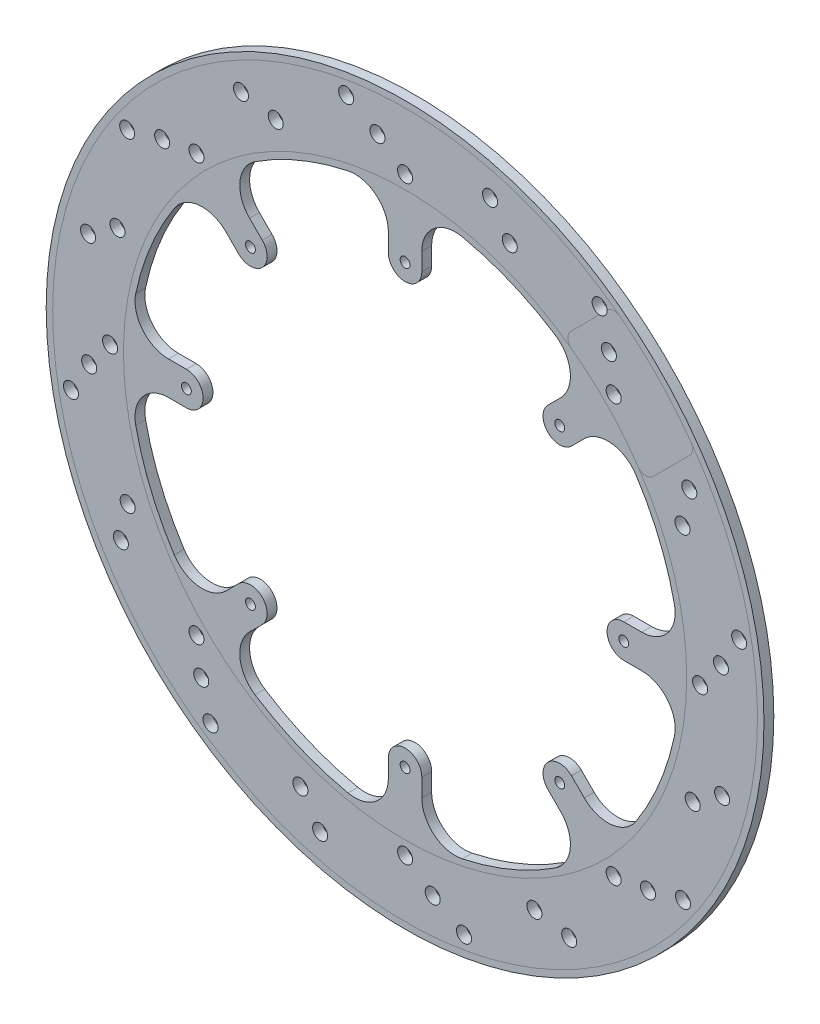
ISO-10303-21;
HEADER;
FILE_DESCRIPTION(('STEP AP214'),'2;1');
FILE_NAME('part.step','',(''),(''),'','','');
FILE_SCHEMA(('AUTOMOTIVE_DESIGN { 1 0 10303 214 1 1 1 1 }'));
ENDSEC;
DATA;
#1=APPLICATION_CONTEXT('core data for automotive mechanical design processes');
#2=APPLICATION_PROTOCOL_DEFINITION('international standard','automotive_design',2000,#1);
#3=PRODUCT_CONTEXT('',#1,'mechanical');
#4=PRODUCT('Part','Part','',(#3));
#5=PRODUCT_RELATED_PRODUCT_CATEGORY('part','',(#4));
#6=PRODUCT_DEFINITION_FORMATION('','',#4);
#7=PRODUCT_DEFINITION_CONTEXT('part definition',#1,'design');
#8=PRODUCT_DEFINITION('design','',#6,#7);
#9=PRODUCT_DEFINITION_SHAPE('','',#8);
#10=(LENGTH_UNIT() NAMED_UNIT(*) SI_UNIT(.MILLI.,.METRE.));
#11=(NAMED_UNIT(*) PLANE_ANGLE_UNIT() SI_UNIT($,.RADIAN.));
#12=(NAMED_UNIT(*) SI_UNIT($,.STERADIAN.) SOLID_ANGLE_UNIT());
#13=UNCERTAINTY_MEASURE_WITH_UNIT(LENGTH_MEASURE(1.E-05),#10,'distance_accuracy_value','');
#14=(GEOMETRIC_REPRESENTATION_CONTEXT(3) GLOBAL_UNCERTAINTY_ASSIGNED_CONTEXT((#13)) GLOBAL_UNIT_ASSIGNED_CONTEXT((#10,
#11,#12)) REPRESENTATION_CONTEXT('',''));
#15=CARTESIAN_POINT('',(0.,0.,0.));
#16=DIRECTION('',(0.,0.,1.));
#17=DIRECTION('',(1.,0.,0.));
#18=AXIS2_PLACEMENT_3D('',#15,#16,#17);
#19=CARTESIAN_POINT('',(0.,-255.093921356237,3.175));
#20=DIRECTION('',(0.,0.,1.));
#21=DIRECTION('',(1.,0.,0.));
#22=AXIS2_PLACEMENT_3D('',#19,#20,#21);
#23=PLANE('',#22);
#24=CARTESIAN_POINT('',(0.,0.,3.175));
#25=DIRECTION('',(0.,0.,1.));
#26=DIRECTION('',(1.,0.,0.));
#27=AXIS2_PLACEMENT_3D('',#24,#25,#26);
#28=CIRCLE('',#27,115.8875);
#29=CARTESIAN_POINT('',(115.8875,0.,3.175));
#30=VERTEX_POINT('',#29);
#31=EDGE_CURVE('E763',#30,#30,#28,.T.);
#32=ORIENTED_EDGE('',*,*,#31,.T.);
#33=EDGE_LOOP('',(#32));
#34=FACE_BOUND('',#33,.T.);
#35=CARTESIAN_POINT('',(0.,0.,3.175));
#36=DIRECTION('',(0.,0.,1.));
#37=DIRECTION('',(1.,0.,0.));
#38=AXIS2_PLACEMENT_3D('',#35,#36,#37);
#39=CIRCLE('',#38,113.792);
#40=CARTESIAN_POINT('',(69.4695587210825,90.1254662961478,3.175));
#41=VERTEX_POINT('',#40);
#42=CARTESIAN_POINT('',(92.2108411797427,66.6766828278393,3.175));
#43=VERTEX_POINT('',#42);
#44=EDGE_CURVE('E823',#41,#43,#39,.F.);
#45=ORIENTED_EDGE('',*,*,#44,.T.);
#46=CARTESIAN_POINT('',(0.,0.,3.175));
#47=DIRECTION('',(0.,0.,1.));
#48=DIRECTION('',(1.,0.,0.));
#49=AXIS2_PLACEMENT_3D('',#46,#47,#48);
#50=CIRCLE('',#49,113.792);
#51=EDGE_CURVE('E11',#43,#41,#50,.F.);
#52=ORIENTED_EDGE('',*,*,#51,.T.);
#53=EDGE_LOOP('',(#45,#52));
#54=FACE_BOUND('',#53,.T.);
#55=ADVANCED_FACE('F36',(#34,#54),#23,.T.);
#56=ORIENTED_EDGE('',*,*,#51,.F.);
#57=CARTESIAN_POINT('',(89.6379940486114,64.8162843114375,3.175));
#58=DIRECTION('',(0.,0.,1.));
#59=DIRECTION('',(1.,0.,0.));
#60=AXIS2_PLACEMENT_3D('',#57,#58,#59);
#61=CIRCLE('',#60,3.17500000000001);
#62=CARTESIAN_POINT('',(91.8830580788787,62.5712202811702,3.175));
#63=VERTEX_POINT('',#62);
#64=EDGE_CURVE('E819',#43,#63,#61,.F.);
#65=ORIENTED_EDGE('',*,*,#64,.T.);
#66=DIRECTION('',(-0.707106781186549,-0.707106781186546,0.));
#67=VECTOR('',#66,1.);
#68=CARTESIAN_POINT('',(-112.891041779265,-142.202879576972,3.175));
#69=LINE('',#68,#67);
#70=CARTESIAN_POINT('',(80.0320185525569,50.7201807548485,3.175));
#71=VERTEX_POINT('',#70);
#72=EDGE_CURVE('E815',#63,#71,#69,.T.);
#73=ORIENTED_EDGE('',*,*,#72,.T.);
#74=CARTESIAN_POINT('',(77.7869545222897,52.9652447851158,3.175));
#75=DIRECTION('',(0.,0.,1.));
#76=DIRECTION('',(1.,0.,0.));
#77=AXIS2_PLACEMENT_3D('',#74,#75,#76);
#78=CIRCLE('',#77,3.17499999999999);
#79=CARTESIAN_POINT('',(75.1625633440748,51.1782932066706,3.175));
#80=VERTEX_POINT('',#79);
#81=EDGE_CURVE('E812',#71,#80,#78,.F.);
#82=ORIENTED_EDGE('',*,*,#81,.T.);
#83=CARTESIAN_POINT('',(0.,0.,3.175));
#84=DIRECTION('',(0.,0.,1.));
#85=DIRECTION('',(1.,0.,0.));
#86=AXIS2_PLACEMENT_3D('',#83,#84,#85);
#87=CIRCLE('',#86,90.932);
#88=CARTESIAN_POINT('',(53.8615356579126,73.2636581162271,3.175));
#89=VERTEX_POINT('',#88);
#90=EDGE_CURVE('E45',#80,#89,#87,.F.);
#91=ORIENTED_EDGE('',*,*,#90,.T.);
#92=CARTESIAN_POINT('',(55.7421758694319,75.8217467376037,3.175));
#93=DIRECTION('',(0.,0.,1.));
#94=DIRECTION('',(1.,0.,0.));
#95=AXIS2_PLACEMENT_3D('',#92,#93,#94);
#96=CIRCLE('',#95,3.17500000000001);
#97=CARTESIAN_POINT('',(53.4971118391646,78.066810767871,3.175));
#98=VERTEX_POINT('',#97);
#99=EDGE_CURVE('E804',#89,#98,#96,.F.);
#100=ORIENTED_EDGE('',*,*,#99,.T.);
#101=DIRECTION('',(0.707106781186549,0.707106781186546,0.));
#102=VECTOR('',#101,1.);
#103=CARTESIAN_POINT('',(-139.831810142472,-115.262111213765,3.175));
#104=LINE('',#103,#102);
#105=CARTESIAN_POINT('',(62.7342841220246,87.3039830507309,3.175));
#106=VERTEX_POINT('',#105);
#107=EDGE_CURVE('E52',#98,#106,#104,.T.);
#108=ORIENTED_EDGE('',*,*,#107,.T.);
#109=CARTESIAN_POINT('',(62.8281288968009,89.7278670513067,3.175));
#110=DIRECTION('',(0.,0.,1.));
#111=DIRECTION('',(0.707106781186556,-0.707106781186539,0.));
#112=AXIS2_PLACEMENT_3D('',#109,#110,#111);
#113=CIRCLE('',#112,2.4257);
#114=CARTESIAN_POINT('',(65.2520128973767,89.821711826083,3.175));
#115=VERTEX_POINT('',#114);
#116=EDGE_CURVE('E896',#115,#106,#113,.T.);
#117=ORIENTED_EDGE('',*,*,#116,.F.);
#118=CARTESIAN_POINT('',(65.2861699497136,89.8558688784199,3.175));
#119=VERTEX_POINT('',#118);
#120=EDGE_CURVE('E805',#115,#119,#104,.T.);
#121=ORIENTED_EDGE('',*,*,#120,.T.);
#122=CARTESIAN_POINT('',(67.5312339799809,87.6108048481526,3.175));
#123=DIRECTION('',(0.,0.,1.));
#124=DIRECTION('',(1.,0.,0.));
#125=AXIS2_PLACEMENT_3D('',#122,#123,#124);
#126=CIRCLE('',#125,3.17499999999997);
#127=EDGE_CURVE('E827',#119,#41,#126,.F.);
#128=ORIENTED_EDGE('',*,*,#127,.T.);
#129=EDGE_LOOP('',(#56,#65,#73,#82,#91,#100,#108,#117,#121,#128));
#130=FACE_BOUND('',#129,.T.);
#131=CARTESIAN_POINT('',(89.5630348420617,41.7639290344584,3.175));
#132=DIRECTION('',(0.,0.,1.));
#133=DIRECTION('',(0.707106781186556,-0.707106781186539,0.));
#134=AXIS2_PLACEMENT_3D('',#131,#132,#133);
#135=CIRCLE('',#134,2.42569999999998);
#136=CARTESIAN_POINT('',(91.2782637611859,40.0487001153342,3.175));
#137=VERTEX_POINT('',#136);
#138=EDGE_CURVE('E2360',#137,#137,#135,.T.);
#139=ORIENTED_EDGE('',*,*,#138,.F.);
#140=EDGE_LOOP('',(#139));
#141=FACE_BOUND('',#140,.T.);
#142=CARTESIAN_POINT('',(91.7689231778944,52.9828125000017,3.175));
#143=DIRECTION('',(0.,0.,1.));
#144=DIRECTION('',(0.707106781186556,-0.707106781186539,0.));
#145=AXIS2_PLACEMENT_3D('',#142,#143,#144);
#146=CIRCLE('',#145,2.42569999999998);
#147=CARTESIAN_POINT('',(93.4841520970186,51.2675835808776,3.175));
#148=VERTEX_POINT('',#147);
#149=EDGE_CURVE('E2364',#148,#148,#146,.T.);
#150=ORIENTED_EDGE('',*,*,#149,.F.);
#151=EDGE_LOOP('',(#150));
#152=FACE_BOUND('',#151,.T.);
#153=CARTESIAN_POINT('',(92.862186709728,-33.7990718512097,3.175));
#154=DIRECTION('',(0.,0.,1.));
#155=DIRECTION('',(0.,-1.,0.));
#156=AXIS2_PLACEMENT_3D('',#153,#154,#155);
#157=CIRCLE('',#156,2.42569999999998);
#158=CARTESIAN_POINT('',(92.8621867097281,-36.2247718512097,3.175));
#159=VERTEX_POINT('',#158);
#160=EDGE_CURVE('E915',#159,#159,#157,.T.);
#161=ORIENTED_EDGE('',*,*,#160,.F.);
#162=EDGE_LOOP('',(#161));
#163=FACE_BOUND('',#162,.T.);
#164=CARTESIAN_POINT('',(102.354933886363,-27.42592187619,3.175));
#165=DIRECTION('',(0.,0.,1.));
#166=DIRECTION('',(0.,-1.,0.));
#167=AXIS2_PLACEMENT_3D('',#164,#165,#166);
#168=CIRCLE('',#167,2.42569999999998);
#169=CARTESIAN_POINT('',(102.354933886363,-29.85162187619,3.175));
#170=VERTEX_POINT('',#169);
#171=EDGE_CURVE('E921',#170,#170,#168,.T.);
#172=ORIENTED_EDGE('',*,*,#171,.F.);
#173=EDGE_LOOP('',(#172));
#174=FACE_BOUND('',#173,.T.);
#175=CARTESIAN_POINT('',(107.873379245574,19.0209872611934,3.175));
#176=DIRECTION('',(0.,0.,1.));
#177=DIRECTION('',(0.,-1.,0.));
#178=AXIS2_PLACEMENT_3D('',#175,#176,#177);
#179=CIRCLE('',#178,2.4257);
#180=CARTESIAN_POINT('',(107.873379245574,16.5952872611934,3.175));
#181=VERTEX_POINT('',#180);
#182=EDGE_CURVE('E927',#181,#181,#179,.T.);
#183=ORIENTED_EDGE('',*,*,#182,.F.);
#184=EDGE_LOOP('',(#183));
#185=FACE_BOUND('',#184,.T.);
#186=CARTESIAN_POINT('',(102.004110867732,8.92420333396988,3.175));
#187=DIRECTION('',(0.,0.,1.));
#188=DIRECTION('',(0.,-1.,0.));
#189=AXIS2_PLACEMENT_3D('',#186,#187,#188);
#190=CIRCLE('',#189,2.4257);
#191=CARTESIAN_POINT('',(102.004110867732,6.49850333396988,3.175));
#192=VERTEX_POINT('',#191);
#193=EDGE_CURVE('E933',#192,#192,#190,.T.);
#194=ORIENTED_EDGE('',*,*,#193,.F.);
#195=EDGE_LOOP('',(#194));
#196=FACE_BOUND('',#195,.T.);
#197=CARTESIAN_POINT('',(95.25,1.70885166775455E-12,3.175));
#198=DIRECTION('',(0.,0.,1.));
#199=DIRECTION('',(0.,-1.,0.));
#200=AXIS2_PLACEMENT_3D('',#197,#198,#199);
#201=CIRCLE('',#200,2.42569999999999);
#202=CARTESIAN_POINT('',(95.25,-2.42569999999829,3.175));
#203=VERTEX_POINT('',#202);
#204=EDGE_CURVE('E939',#203,#203,#201,.T.);
#205=ORIENTED_EDGE('',*,*,#204,.F.);
#206=EDGE_LOOP('',(#205));
#207=FACE_BOUND('',#206,.T.);
#208=CARTESIAN_POINT('',(41.7639290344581,-89.5630348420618,3.175));
#209=DIRECTION('',(0.,0.,1.));
#210=DIRECTION('',(-0.707106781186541,-0.707106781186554,0.));
#211=AXIS2_PLACEMENT_3D('',#208,#209,#210);
#212=CIRCLE('',#211,2.42569999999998);
#213=CARTESIAN_POINT('',(40.0487001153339,-91.278263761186,3.175));
#214=VERTEX_POINT('',#213);
#215=EDGE_CURVE('E945',#214,#214,#212,.T.);
#216=ORIENTED_EDGE('',*,*,#215,.F.);
#217=EDGE_LOOP('',(#216));
#218=FACE_BOUND('',#217,.T.);
#219=CARTESIAN_POINT('',(52.9828125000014,-91.7689231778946,3.175));
#220=DIRECTION('',(0.,0.,1.));
#221=DIRECTION('',(-0.707106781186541,-0.707106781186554,0.));
#222=AXIS2_PLACEMENT_3D('',#219,#220,#221);
#223=CIRCLE('',#222,2.42569999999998);
#224=CARTESIAN_POINT('',(51.2675835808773,-93.4841520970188,3.175));
#225=VERTEX_POINT('',#224);
#226=EDGE_CURVE('E951',#225,#225,#223,.T.);
#227=ORIENTED_EDGE('',*,*,#226,.F.);
#228=EDGE_LOOP('',(#227));
#229=FACE_BOUND('',#228,.T.);
#230=CARTESIAN_POINT('',(89.7278670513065,-62.8281288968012,3.175));
#231=DIRECTION('',(0.,0.,1.));
#232=DIRECTION('',(-0.707106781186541,-0.707106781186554,0.));
#233=AXIS2_PLACEMENT_3D('',#230,#231,#232);
#234=CIRCLE('',#233,2.4257);
#235=CARTESIAN_POINT('',(88.0126381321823,-64.5433578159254,3.175));
#236=VERTEX_POINT('',#235);
#237=EDGE_CURVE('E957',#236,#236,#234,.T.);
#238=ORIENTED_EDGE('',*,*,#237,.F.);
#239=EDGE_LOOP('',(#238));
#240=FACE_BOUND('',#239,.T.);
#241=CARTESIAN_POINT('',(78.4381631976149,-65.8174338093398,3.175));
#242=DIRECTION('',(0.,0.,1.));
#243=DIRECTION('',(-0.707106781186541,-0.707106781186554,0.));
#244=AXIS2_PLACEMENT_3D('',#241,#242,#243);
#245=CIRCLE('',#244,2.4257);
#246=CARTESIAN_POINT('',(76.7229342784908,-67.532662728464,3.175));
#247=VERTEX_POINT('',#246);
#248=EDGE_CURVE('E963',#247,#247,#245,.T.);
#249=ORIENTED_EDGE('',*,*,#248,.F.);
#250=EDGE_LOOP('',(#249));
#251=FACE_BOUND('',#250,.T.);
#252=CARTESIAN_POINT('',(67.3519209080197,-67.3519209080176,3.175));
#253=DIRECTION('',(0.,0.,1.));
#254=DIRECTION('',(-0.707106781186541,-0.707106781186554,0.));
#255=AXIS2_PLACEMENT_3D('',#252,#253,#254);
#256=CIRCLE('',#255,2.42569999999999);
#257=CARTESIAN_POINT('',(65.6366919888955,-69.0671498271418,3.175));
#258=VERTEX_POINT('',#257);
#259=EDGE_CURVE('E969',#258,#258,#256,.T.);
#260=ORIENTED_EDGE('',*,*,#259,.F.);
#261=EDGE_LOOP('',(#260));
#262=FACE_BOUND('',#261,.T.);
#263=CARTESIAN_POINT('',(-33.7990718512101,-92.8621867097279,3.175));
#264=DIRECTION('',(0.,0.,1.));
#265=DIRECTION('',(-1.,0.,0.));
#266=AXIS2_PLACEMENT_3D('',#263,#264,#265);
#267=CIRCLE('',#266,2.42569999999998);
#268=CARTESIAN_POINT('',(-36.22477185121,-92.8621867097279,3.175));
#269=VERTEX_POINT('',#268);
#270=EDGE_CURVE('E975',#269,#269,#267,.T.);
#271=ORIENTED_EDGE('',*,*,#270,.F.);
#272=EDGE_LOOP('',(#271));
#273=FACE_BOUND('',#272,.T.);
#274=CARTESIAN_POINT('',(-27.4259218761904,-102.354933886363,3.175));
#275=DIRECTION('',(0.,0.,1.));
#276=DIRECTION('',(-1.,0.,0.));
#277=AXIS2_PLACEMENT_3D('',#274,#275,#276);
#278=CIRCLE('',#277,2.42569999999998);
#279=CARTESIAN_POINT('',(-29.8516218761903,-102.354933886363,3.175));
#280=VERTEX_POINT('',#279);
#281=EDGE_CURVE('E981',#280,#280,#278,.T.);
#282=ORIENTED_EDGE('',*,*,#281,.F.);
#283=EDGE_LOOP('',(#282));
#284=FACE_BOUND('',#283,.T.);
#285=CARTESIAN_POINT('',(19.020987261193,-107.873379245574,3.175));
#286=DIRECTION('',(0.,0.,1.));
#287=DIRECTION('',(-1.,0.,0.));
#288=AXIS2_PLACEMENT_3D('',#285,#286,#287);
#289=CIRCLE('',#288,2.4257);
#290=CARTESIAN_POINT('',(16.595287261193,-107.873379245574,3.175));
#291=VERTEX_POINT('',#290);
#292=EDGE_CURVE('E987',#291,#291,#289,.T.);
#293=ORIENTED_EDGE('',*,*,#292,.F.);
#294=EDGE_LOOP('',(#293));
#295=FACE_BOUND('',#294,.T.);
#296=CARTESIAN_POINT('',(8.92420333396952,-102.004110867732,3.175));
#297=DIRECTION('',(0.,0.,1.));
#298=DIRECTION('',(-1.,0.,0.));
#299=AXIS2_PLACEMENT_3D('',#296,#297,#298);
#300=CIRCLE('',#299,2.4257);
#301=CARTESIAN_POINT('',(6.49850333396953,-102.004110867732,3.175));
#302=VERTEX_POINT('',#301);
#303=EDGE_CURVE('E993',#302,#302,#300,.T.);
#304=ORIENTED_EDGE('',*,*,#303,.F.);
#305=EDGE_LOOP('',(#304));
#306=FACE_BOUND('',#305,.T.);
#307=CARTESIAN_POINT('',(1.37628787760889E-12,-95.25,3.175));
#308=DIRECTION('',(0.,0.,1.));
#309=DIRECTION('',(-1.,0.,0.));
#310=AXIS2_PLACEMENT_3D('',#307,#308,#309);
#311=CIRCLE('',#310,2.42569999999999);
#312=CARTESIAN_POINT('',(-2.42569999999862,-95.25,3.175));
#313=VERTEX_POINT('',#312);
#314=EDGE_CURVE('E999',#313,#313,#311,.T.);
#315=ORIENTED_EDGE('',*,*,#314,.F.);
#316=EDGE_LOOP('',(#315));
#317=FACE_BOUND('',#316,.T.);
#318=CARTESIAN_POINT('',(-89.563034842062,-41.7639290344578,3.175));
#319=DIRECTION('',(0.,0.,1.));
#320=DIRECTION('',(-0.707106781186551,0.707106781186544,0.));
#321=AXIS2_PLACEMENT_3D('',#318,#319,#320);
#322=CIRCLE('',#321,2.42569999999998);
#323=CARTESIAN_POINT('',(-91.2782637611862,-40.0487001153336,3.175));
#324=VERTEX_POINT('',#323);
#325=EDGE_CURVE('E1005',#324,#324,#322,.T.);
#326=ORIENTED_EDGE('',*,*,#325,.F.);
#327=EDGE_LOOP('',(#326));
#328=FACE_BOUND('',#327,.T.);
#329=CARTESIAN_POINT('',(-91.7689231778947,-52.9828125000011,3.175));
#330=DIRECTION('',(0.,0.,1.));
#331=DIRECTION('',(-0.707106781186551,0.707106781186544,0.));
#332=AXIS2_PLACEMENT_3D('',#329,#330,#331);
#333=CIRCLE('',#332,2.42569999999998);
#334=CARTESIAN_POINT('',(-93.4841520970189,-51.2675835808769,3.175));
#335=VERTEX_POINT('',#334);
#336=EDGE_CURVE('E1011',#335,#335,#333,.T.);
#337=ORIENTED_EDGE('',*,*,#336,.F.);
#338=EDGE_LOOP('',(#337));
#339=FACE_BOUND('',#338,.T.);
#340=CARTESIAN_POINT('',(-62.8281288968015,-89.7278670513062,3.175));
#341=DIRECTION('',(0.,0.,1.));
#342=DIRECTION('',(-0.707106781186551,0.707106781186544,0.));
#343=AXIS2_PLACEMENT_3D('',#340,#341,#342);
#344=CIRCLE('',#343,2.4257);
#345=CARTESIAN_POINT('',(-64.5433578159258,-88.0126381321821,3.175));
#346=VERTEX_POINT('',#345);
#347=EDGE_CURVE('E1017',#346,#346,#344,.T.);
#348=ORIENTED_EDGE('',*,*,#347,.F.);
#349=EDGE_LOOP('',(#348));
#350=FACE_BOUND('',#349,.T.);
#351=CARTESIAN_POINT('',(-65.8174338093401,-78.4381631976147,3.175));
#352=DIRECTION('',(0.,0.,1.));
#353=DIRECTION('',(-0.707106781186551,0.707106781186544,0.));
#354=AXIS2_PLACEMENT_3D('',#351,#352,#353);
#355=CIRCLE('',#354,2.4257);
#356=CARTESIAN_POINT('',(-67.5326627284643,-76.7229342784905,3.175));
#357=VERTEX_POINT('',#356);
#358=EDGE_CURVE('E1023',#357,#357,#355,.T.);
#359=ORIENTED_EDGE('',*,*,#358,.F.);
#360=EDGE_LOOP('',(#359));
#361=FACE_BOUND('',#360,.T.);
#362=CARTESIAN_POINT('',(-67.3519209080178,-67.3519209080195,3.175));
#363=DIRECTION('',(0.,0.,1.));
#364=DIRECTION('',(-0.707106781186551,0.707106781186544,0.));
#365=AXIS2_PLACEMENT_3D('',#362,#363,#364);
#366=CIRCLE('',#365,2.42569999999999);
#367=CARTESIAN_POINT('',(-69.067149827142,-65.6366919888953,3.175));
#368=VERTEX_POINT('',#367);
#369=EDGE_CURVE('E1029',#368,#368,#366,.T.);
#370=ORIENTED_EDGE('',*,*,#369,.F.);
#371=EDGE_LOOP('',(#370));
#372=FACE_BOUND('',#371,.T.);
#373=CARTESIAN_POINT('',(-92.8621867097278,33.7990718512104,3.175));
#374=DIRECTION('',(0.,0.,1.));
#375=DIRECTION('',(0.,1.,0.));
#376=AXIS2_PLACEMENT_3D('',#373,#374,#375);
#377=CIRCLE('',#376,2.42569999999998);
#378=CARTESIAN_POINT('',(-92.8621867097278,36.2247718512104,3.175));
#379=VERTEX_POINT('',#378);
#380=EDGE_CURVE('E1035',#379,#379,#377,.T.);
#381=ORIENTED_EDGE('',*,*,#380,.F.);
#382=EDGE_LOOP('',(#381));
#383=FACE_BOUND('',#382,.T.);
#384=CARTESIAN_POINT('',(-102.354933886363,27.4259218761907,3.175));
#385=DIRECTION('',(0.,0.,1.));
#386=DIRECTION('',(0.,1.,0.));
#387=AXIS2_PLACEMENT_3D('',#384,#385,#386);
#388=CIRCLE('',#387,2.42569999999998);
#389=CARTESIAN_POINT('',(-102.354933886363,29.8516218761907,3.175));
#390=VERTEX_POINT('',#389);
#391=EDGE_CURVE('E1041',#390,#390,#388,.T.);
#392=ORIENTED_EDGE('',*,*,#391,.F.);
#393=EDGE_LOOP('',(#392));
#394=FACE_BOUND('',#393,.T.);
#395=CARTESIAN_POINT('',(-107.873379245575,-19.0209872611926,3.175));
#396=DIRECTION('',(0.,0.,1.));
#397=DIRECTION('',(0.,1.,0.));
#398=AXIS2_PLACEMENT_3D('',#395,#396,#397);
#399=CIRCLE('',#398,2.4257);
#400=CARTESIAN_POINT('',(-107.873379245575,-16.5952872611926,3.175));
#401=VERTEX_POINT('',#400);
#402=EDGE_CURVE('E1047',#401,#401,#399,.T.);
#403=ORIENTED_EDGE('',*,*,#402,.F.);
#404=EDGE_LOOP('',(#403));
#405=FACE_BOUND('',#404,.T.);
#406=CARTESIAN_POINT('',(-102.004110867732,-8.92420333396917,3.175));
#407=DIRECTION('',(0.,0.,1.));
#408=DIRECTION('',(0.,1.,0.));
#409=AXIS2_PLACEMENT_3D('',#406,#407,#408);
#410=CIRCLE('',#409,2.4257);
#411=CARTESIAN_POINT('',(-102.004110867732,-6.49850333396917,3.175));
#412=VERTEX_POINT('',#411);
#413=EDGE_CURVE('E1053',#412,#412,#410,.T.);
#414=ORIENTED_EDGE('',*,*,#413,.F.);
#415=EDGE_LOOP('',(#414));
#416=FACE_BOUND('',#415,.T.);
#417=CARTESIAN_POINT('',(-95.25,-1.04372408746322E-12,3.175));
#418=DIRECTION('',(0.,0.,1.));
#419=DIRECTION('',(0.,1.,0.));
#420=AXIS2_PLACEMENT_3D('',#417,#418,#419);
#421=CIRCLE('',#420,2.42569999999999);
#422=CARTESIAN_POINT('',(-95.25,2.42569999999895,3.175));
#423=VERTEX_POINT('',#422);
#424=EDGE_CURVE('E1059',#423,#423,#421,.T.);
#425=ORIENTED_EDGE('',*,*,#424,.F.);
#426=EDGE_LOOP('',(#425));
#427=FACE_BOUND('',#426,.T.);
#428=CARTESIAN_POINT('',(-41.7639290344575,89.5630348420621,3.175));
#429=DIRECTION('',(0.,0.,1.));
#430=DIRECTION('',(0.707106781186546,0.707106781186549,0.));
#431=AXIS2_PLACEMENT_3D('',#428,#429,#430);
#432=CIRCLE('',#431,2.42569999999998);
#433=CARTESIAN_POINT('',(-40.0487001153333,91.2782637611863,3.175));
#434=VERTEX_POINT('',#433);
#435=EDGE_CURVE('E1065',#434,#434,#432,.T.);
#436=ORIENTED_EDGE('',*,*,#435,.F.);
#437=EDGE_LOOP('',(#436));
#438=FACE_BOUND('',#437,.T.);
#439=CARTESIAN_POINT('',(-52.9828125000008,91.7689231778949,3.175));
#440=DIRECTION('',(0.,0.,1.));
#441=DIRECTION('',(0.707106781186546,0.707106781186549,0.));
#442=AXIS2_PLACEMENT_3D('',#439,#440,#441);
#443=CIRCLE('',#442,2.42569999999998);
#444=CARTESIAN_POINT('',(-51.2675835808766,93.4841520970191,3.175));
#445=VERTEX_POINT('',#444);
#446=EDGE_CURVE('E1071',#445,#445,#443,.T.);
#447=ORIENTED_EDGE('',*,*,#446,.F.);
#448=EDGE_LOOP('',(#447));
#449=FACE_BOUND('',#448,.T.);
#450=CARTESIAN_POINT('',(-89.727867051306,62.8281288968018,3.175));
#451=DIRECTION('',(0.,0.,1.));
#452=DIRECTION('',(0.707106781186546,0.707106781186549,0.));
#453=AXIS2_PLACEMENT_3D('',#450,#451,#452);
#454=CIRCLE('',#453,2.4257);
#455=CARTESIAN_POINT('',(-88.0126381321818,64.543357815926,3.175));
#456=VERTEX_POINT('',#455);
#457=EDGE_CURVE('E1077',#456,#456,#454,.T.);
#458=ORIENTED_EDGE('',*,*,#457,.F.);
#459=EDGE_LOOP('',(#458));
#460=FACE_BOUND('',#459,.T.);
#461=CARTESIAN_POINT('',(-78.4381631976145,65.8174338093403,3.175));
#462=DIRECTION('',(0.,0.,1.));
#463=DIRECTION('',(0.707106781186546,0.707106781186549,0.));
#464=AXIS2_PLACEMENT_3D('',#461,#462,#463);
#465=CIRCLE('',#464,2.4257);
#466=CARTESIAN_POINT('',(-76.7229342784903,67.5326627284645,3.175));
#467=VERTEX_POINT('',#466);
#468=EDGE_CURVE('E1083',#467,#467,#465,.T.);
#469=ORIENTED_EDGE('',*,*,#468,.F.);
#470=EDGE_LOOP('',(#469));
#471=FACE_BOUND('',#470,.T.);
#472=CARTESIAN_POINT('',(-67.3519209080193,67.351920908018,3.175));
#473=DIRECTION('',(0.,0.,1.));
#474=DIRECTION('',(0.707106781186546,0.707106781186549,0.));
#475=AXIS2_PLACEMENT_3D('',#472,#473,#474);
#476=CIRCLE('',#475,2.42569999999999);
#477=CARTESIAN_POINT('',(-65.6366919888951,69.0671498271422,3.175));
#478=VERTEX_POINT('',#477);
#479=EDGE_CURVE('E1089',#478,#478,#476,.T.);
#480=ORIENTED_EDGE('',*,*,#479,.F.);
#481=EDGE_LOOP('',(#480));
#482=FACE_BOUND('',#481,.T.);
#483=CARTESIAN_POINT('',(33.7990718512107,92.8621867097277,3.175));
#484=DIRECTION('',(0.,0.,1.));
#485=DIRECTION('',(1.,0.,0.));
#486=AXIS2_PLACEMENT_3D('',#483,#484,#485);
#487=CIRCLE('',#486,2.42569999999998);
#488=CARTESIAN_POINT('',(36.2247718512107,92.8621867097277,3.175));
#489=VERTEX_POINT('',#488);
#490=EDGE_CURVE('E1095',#489,#489,#487,.T.);
#491=ORIENTED_EDGE('',*,*,#490,.F.);
#492=EDGE_LOOP('',(#491));
#493=FACE_BOUND('',#492,.T.);
#494=CARTESIAN_POINT('',(27.4259218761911,102.354933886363,3.175));
#495=DIRECTION('',(0.,0.,1.));
#496=DIRECTION('',(1.,0.,0.));
#497=AXIS2_PLACEMENT_3D('',#494,#495,#496);
#498=CIRCLE('',#497,2.42569999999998);
#499=CARTESIAN_POINT('',(29.8516218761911,102.354933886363,3.175));
#500=VERTEX_POINT('',#499);
#501=EDGE_CURVE('E1101',#500,#500,#498,.T.);
#502=ORIENTED_EDGE('',*,*,#501,.F.);
#503=EDGE_LOOP('',(#502));
#504=FACE_BOUND('',#503,.T.);
#505=CARTESIAN_POINT('',(-19.0209872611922,107.873379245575,3.175));
#506=DIRECTION('',(0.,0.,1.));
#507=DIRECTION('',(1.,0.,0.));
#508=AXIS2_PLACEMENT_3D('',#505,#506,#507);
#509=CIRCLE('',#508,2.4257);
#510=CARTESIAN_POINT('',(-16.5952872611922,107.873379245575,3.175));
#511=VERTEX_POINT('',#510);
#512=EDGE_CURVE('E1107',#511,#511,#509,.T.);
#513=ORIENTED_EDGE('',*,*,#512,.F.);
#514=EDGE_LOOP('',(#513));
#515=FACE_BOUND('',#514,.T.);
#516=CARTESIAN_POINT('',(-8.92420333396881,102.004110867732,3.175));
#517=DIRECTION('',(0.,0.,1.));
#518=DIRECTION('',(1.,0.,0.));
#519=AXIS2_PLACEMENT_3D('',#516,#517,#518);
#520=CIRCLE('',#519,2.4257);
#521=CARTESIAN_POINT('',(-6.49850333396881,102.004110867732,3.175));
#522=VERTEX_POINT('',#521);
#523=EDGE_CURVE('E1113',#522,#522,#520,.T.);
#524=ORIENTED_EDGE('',*,*,#523,.F.);
#525=EDGE_LOOP('',(#524));
#526=FACE_BOUND('',#525,.T.);
#527=CARTESIAN_POINT('',(-7.11160297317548E-13,95.25,3.175));
#528=DIRECTION('',(0.,0.,1.));
#529=DIRECTION('',(1.,0.,0.));
#530=AXIS2_PLACEMENT_3D('',#527,#528,#529);
#531=CIRCLE('',#530,2.42569999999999);
#532=CARTESIAN_POINT('',(2.42569999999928,95.25,3.175));
#533=VERTEX_POINT('',#532);
#534=EDGE_CURVE('E1119',#533,#533,#531,.T.);
#535=ORIENTED_EDGE('',*,*,#534,.F.);
#536=EDGE_LOOP('',(#535));
#537=FACE_BOUND('',#536,.T.);
#538=ADVANCED_FACE('F1400',(#130,#141,#152,#163,#174,#185,#196,#207,#218,#229,#240,#251,#262,
#273,#284,#295,#306,#317,#328,#339,#350,#361,#372,#383,#394,#405,#416,#427,#438,#449,#460,#471,
#482,#493,#504,#515,#526,#537),#23,.T.);
#539=CARTESIAN_POINT('',(0.,-255.093921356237,0.));
#540=DIRECTION('',(0.,0.,1.));
#541=DIRECTION('',(1.,0.,0.));
#542=AXIS2_PLACEMENT_3D('',#539,#540,#541);
#543=PLANE('',#542);
#544=CARTESIAN_POINT('',(0.,0.,0.));
#545=DIRECTION('',(0.,0.,1.));
#546=DIRECTION('',(1.,0.,0.));
#547=AXIS2_PLACEMENT_3D('',#544,#545,#546);
#548=CIRCLE('',#547,115.8875);
#549=CARTESIAN_POINT('',(115.8875,0.,0.));
#550=VERTEX_POINT('',#549);
#551=EDGE_CURVE('E762',#550,#550,#548,.T.);
#552=ORIENTED_EDGE('',*,*,#551,.F.);
#553=EDGE_LOOP('',(#552));
#554=FACE_BOUND('',#553,.T.);
#555=CARTESIAN_POINT('',(0.,0.,0.));
#556=DIRECTION('',(0.,0.,1.));
#557=DIRECTION('',(1.,0.,0.));
#558=AXIS2_PLACEMENT_3D('',#555,#556,#557);
#559=CIRCLE('',#558,113.792);
#560=CARTESIAN_POINT('',(92.2108411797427,66.6766828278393,0.));
#561=VERTEX_POINT('',#560);
#562=CARTESIAN_POINT('',(69.4695587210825,90.1254662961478,0.));
#563=VERTEX_POINT('',#562);
#564=EDGE_CURVE('E833',#561,#563,#559,.F.);
#565=ORIENTED_EDGE('',*,*,#564,.F.);
#566=CARTESIAN_POINT('',(0.,0.,0.));
#567=DIRECTION('',(0.,0.,1.));
#568=DIRECTION('',(1.,0.,0.));
#569=AXIS2_PLACEMENT_3D('',#566,#567,#568);
#570=CIRCLE('',#569,113.792);
#571=EDGE_CURVE('E777',#563,#561,#570,.F.);
#572=ORIENTED_EDGE('',*,*,#571,.F.);
#573=EDGE_LOOP('',(#565,#572));
#574=FACE_BOUND('',#573,.T.);
#575=ADVANCED_FACE('F1407',(#554,#574),#543,.F.);
#576=CARTESIAN_POINT('',(89.5630348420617,41.7639290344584,0.));
#577=DIRECTION('',(0.,0.,1.));
#578=DIRECTION('',(1.,0.,0.));
#579=AXIS2_PLACEMENT_3D('',#576,#577,#578);
#580=CIRCLE('',#579,2.42569999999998);
#581=CARTESIAN_POINT('',(91.9887348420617,41.7639290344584,0.));
#582=VERTEX_POINT('',#581);
#583=EDGE_CURVE('E2363',#582,#582,#580,.F.);
#584=ORIENTED_EDGE('',*,*,#583,.F.);
#585=EDGE_LOOP('',(#584));
#586=FACE_BOUND('',#585,.T.);
#587=CARTESIAN_POINT('',(91.7689231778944,52.9828125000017,0.));
#588=DIRECTION('',(0.,0.,1.));
#589=DIRECTION('',(1.,0.,0.));
#590=AXIS2_PLACEMENT_3D('',#587,#588,#589);
#591=CIRCLE('',#590,2.42569999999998);
#592=CARTESIAN_POINT('',(94.1946231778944,52.9828125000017,0.));
#593=VERTEX_POINT('',#592);
#594=EDGE_CURVE('E2367',#593,#593,#591,.F.);
#595=ORIENTED_EDGE('',*,*,#594,.F.);
#596=EDGE_LOOP('',(#595));
#597=FACE_BOUND('',#596,.T.);
#598=CARTESIAN_POINT('',(92.862186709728,-33.7990718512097,0.));
#599=DIRECTION('',(0.,0.,1.));
#600=DIRECTION('',(1.,0.,0.));
#601=AXIS2_PLACEMENT_3D('',#598,#599,#600);
#602=CIRCLE('',#601,2.42569999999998);
#603=CARTESIAN_POINT('',(95.287886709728,-33.7990718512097,0.));
#604=VERTEX_POINT('',#603);
#605=EDGE_CURVE('E918',#604,#604,#602,.F.);
#606=ORIENTED_EDGE('',*,*,#605,.F.);
#607=EDGE_LOOP('',(#606));
#608=FACE_BOUND('',#607,.T.);
#609=CARTESIAN_POINT('',(102.354933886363,-27.42592187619,0.));
#610=DIRECTION('',(0.,0.,1.));
#611=DIRECTION('',(1.,0.,0.));
#612=AXIS2_PLACEMENT_3D('',#609,#610,#611);
#613=CIRCLE('',#612,2.42569999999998);
#614=CARTESIAN_POINT('',(104.780633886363,-27.42592187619,0.));
#615=VERTEX_POINT('',#614);
#616=EDGE_CURVE('E924',#615,#615,#613,.F.);
#617=ORIENTED_EDGE('',*,*,#616,.F.);
#618=EDGE_LOOP('',(#617));
#619=FACE_BOUND('',#618,.T.);
#620=CARTESIAN_POINT('',(107.873379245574,19.0209872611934,0.));
#621=DIRECTION('',(0.,0.,1.));
#622=DIRECTION('',(1.,0.,0.));
#623=AXIS2_PLACEMENT_3D('',#620,#621,#622);
#624=CIRCLE('',#623,2.4257);
#625=CARTESIAN_POINT('',(110.299079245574,19.0209872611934,0.));
#626=VERTEX_POINT('',#625);
#627=EDGE_CURVE('E930',#626,#626,#624,.F.);
#628=ORIENTED_EDGE('',*,*,#627,.F.);
#629=EDGE_LOOP('',(#628));
#630=FACE_BOUND('',#629,.T.);
#631=CARTESIAN_POINT('',(102.004110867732,8.92420333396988,0.));
#632=DIRECTION('',(0.,0.,1.));
#633=DIRECTION('',(1.,0.,0.));
#634=AXIS2_PLACEMENT_3D('',#631,#632,#633);
#635=CIRCLE('',#634,2.4257);
#636=CARTESIAN_POINT('',(104.429810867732,8.92420333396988,0.));
#637=VERTEX_POINT('',#636);
#638=EDGE_CURVE('E936',#637,#637,#635,.F.);
#639=ORIENTED_EDGE('',*,*,#638,.F.);
#640=EDGE_LOOP('',(#639));
#641=FACE_BOUND('',#640,.T.);
#642=CARTESIAN_POINT('',(95.25,1.70885166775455E-12,0.));
#643=DIRECTION('',(0.,0.,1.));
#644=DIRECTION('',(1.,0.,0.));
#645=AXIS2_PLACEMENT_3D('',#642,#643,#644);
#646=CIRCLE('',#645,2.42569999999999);
#647=CARTESIAN_POINT('',(97.6757,1.70885166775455E-12,0.));
#648=VERTEX_POINT('',#647);
#649=EDGE_CURVE('E942',#648,#648,#646,.F.);
#650=ORIENTED_EDGE('',*,*,#649,.F.);
#651=EDGE_LOOP('',(#650));
#652=FACE_BOUND('',#651,.T.);
#653=CARTESIAN_POINT('',(41.7639290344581,-89.5630348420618,0.));
#654=DIRECTION('',(0.,0.,1.));
#655=DIRECTION('',(1.,0.,0.));
#656=AXIS2_PLACEMENT_3D('',#653,#654,#655);
#657=CIRCLE('',#656,2.42569999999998);
#658=CARTESIAN_POINT('',(44.1896290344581,-89.5630348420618,0.));
#659=VERTEX_POINT('',#658);
#660=EDGE_CURVE('E948',#659,#659,#657,.F.);
#661=ORIENTED_EDGE('',*,*,#660,.F.);
#662=EDGE_LOOP('',(#661));
#663=FACE_BOUND('',#662,.T.);
#664=CARTESIAN_POINT('',(52.9828125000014,-91.7689231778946,0.));
#665=DIRECTION('',(0.,0.,1.));
#666=DIRECTION('',(1.,0.,0.));
#667=AXIS2_PLACEMENT_3D('',#664,#665,#666);
#668=CIRCLE('',#667,2.42569999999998);
#669=CARTESIAN_POINT('',(55.4085125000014,-91.7689231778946,0.));
#670=VERTEX_POINT('',#669);
#671=EDGE_CURVE('E954',#670,#670,#668,.F.);
#672=ORIENTED_EDGE('',*,*,#671,.F.);
#673=EDGE_LOOP('',(#672));
#674=FACE_BOUND('',#673,.T.);
#675=CARTESIAN_POINT('',(89.7278670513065,-62.8281288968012,0.));
#676=DIRECTION('',(0.,0.,1.));
#677=DIRECTION('',(1.,0.,0.));
#678=AXIS2_PLACEMENT_3D('',#675,#676,#677);
#679=CIRCLE('',#678,2.4257);
#680=CARTESIAN_POINT('',(92.1535670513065,-62.8281288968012,0.));
#681=VERTEX_POINT('',#680);
#682=EDGE_CURVE('E960',#681,#681,#679,.F.);
#683=ORIENTED_EDGE('',*,*,#682,.F.);
#684=EDGE_LOOP('',(#683));
#685=FACE_BOUND('',#684,.T.);
#686=CARTESIAN_POINT('',(78.4381631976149,-65.8174338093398,0.));
#687=DIRECTION('',(0.,0.,1.));
#688=DIRECTION('',(1.,0.,0.));
#689=AXIS2_PLACEMENT_3D('',#686,#687,#688);
#690=CIRCLE('',#689,2.4257);
#691=CARTESIAN_POINT('',(80.8638631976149,-65.8174338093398,0.));
#692=VERTEX_POINT('',#691);
#693=EDGE_CURVE('E966',#692,#692,#690,.F.);
#694=ORIENTED_EDGE('',*,*,#693,.F.);
#695=EDGE_LOOP('',(#694));
#696=FACE_BOUND('',#695,.T.);
#697=CARTESIAN_POINT('',(67.3519209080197,-67.3519209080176,0.));
#698=DIRECTION('',(0.,0.,1.));
#699=DIRECTION('',(1.,0.,0.));
#700=AXIS2_PLACEMENT_3D('',#697,#698,#699);
#701=CIRCLE('',#700,2.42569999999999);
#702=CARTESIAN_POINT('',(69.7776209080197,-67.3519209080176,0.));
#703=VERTEX_POINT('',#702);
#704=EDGE_CURVE('E972',#703,#703,#701,.F.);
#705=ORIENTED_EDGE('',*,*,#704,.F.);
#706=EDGE_LOOP('',(#705));
#707=FACE_BOUND('',#706,.T.);
#708=CARTESIAN_POINT('',(-33.7990718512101,-92.8621867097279,0.));
#709=DIRECTION('',(0.,0.,1.));
#710=DIRECTION('',(1.,0.,0.));
#711=AXIS2_PLACEMENT_3D('',#708,#709,#710);
#712=CIRCLE('',#711,2.42569999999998);
#713=CARTESIAN_POINT('',(-31.3733718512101,-92.8621867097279,0.));
#714=VERTEX_POINT('',#713);
#715=EDGE_CURVE('E978',#714,#714,#712,.F.);
#716=ORIENTED_EDGE('',*,*,#715,.F.);
#717=EDGE_LOOP('',(#716));
#718=FACE_BOUND('',#717,.T.);
#719=CARTESIAN_POINT('',(-27.4259218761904,-102.354933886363,0.));
#720=DIRECTION('',(0.,0.,1.));
#721=DIRECTION('',(1.,0.,0.));
#722=AXIS2_PLACEMENT_3D('',#719,#720,#721);
#723=CIRCLE('',#722,2.42569999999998);
#724=CARTESIAN_POINT('',(-25.0002218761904,-102.354933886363,0.));
#725=VERTEX_POINT('',#724);
#726=EDGE_CURVE('E984',#725,#725,#723,.F.);
#727=ORIENTED_EDGE('',*,*,#726,.F.);
#728=EDGE_LOOP('',(#727));
#729=FACE_BOUND('',#728,.T.);
#730=CARTESIAN_POINT('',(19.020987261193,-107.873379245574,0.));
#731=DIRECTION('',(0.,0.,1.));
#732=DIRECTION('',(1.,0.,0.));
#733=AXIS2_PLACEMENT_3D('',#730,#731,#732);
#734=CIRCLE('',#733,2.4257);
#735=CARTESIAN_POINT('',(21.446687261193,-107.873379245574,0.));
#736=VERTEX_POINT('',#735);
#737=EDGE_CURVE('E990',#736,#736,#734,.F.);
#738=ORIENTED_EDGE('',*,*,#737,.F.);
#739=EDGE_LOOP('',(#738));
#740=FACE_BOUND('',#739,.T.);
#741=CARTESIAN_POINT('',(8.92420333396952,-102.004110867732,0.));
#742=DIRECTION('',(0.,0.,1.));
#743=DIRECTION('',(1.,0.,0.));
#744=AXIS2_PLACEMENT_3D('',#741,#742,#743);
#745=CIRCLE('',#744,2.4257);
#746=CARTESIAN_POINT('',(11.3499033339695,-102.004110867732,0.));
#747=VERTEX_POINT('',#746);
#748=EDGE_CURVE('E996',#747,#747,#745,.F.);
#749=ORIENTED_EDGE('',*,*,#748,.F.);
#750=EDGE_LOOP('',(#749));
#751=FACE_BOUND('',#750,.T.);
#752=CARTESIAN_POINT('',(1.37628787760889E-12,-95.25,0.));
#753=DIRECTION('',(0.,0.,1.));
#754=DIRECTION('',(1.,0.,0.));
#755=AXIS2_PLACEMENT_3D('',#752,#753,#754);
#756=CIRCLE('',#755,2.42569999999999);
#757=CARTESIAN_POINT('',(2.42570000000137,-95.25,0.));
#758=VERTEX_POINT('',#757);
#759=EDGE_CURVE('E1002',#758,#758,#756,.F.);
#760=ORIENTED_EDGE('',*,*,#759,.F.);
#761=EDGE_LOOP('',(#760));
#762=FACE_BOUND('',#761,.T.);
#763=CARTESIAN_POINT('',(-89.563034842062,-41.7639290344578,0.));
#764=DIRECTION('',(0.,0.,1.));
#765=DIRECTION('',(1.,0.,0.));
#766=AXIS2_PLACEMENT_3D('',#763,#764,#765);
#767=CIRCLE('',#766,2.42569999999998);
#768=CARTESIAN_POINT('',(-87.137334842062,-41.7639290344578,0.));
#769=VERTEX_POINT('',#768);
#770=EDGE_CURVE('E1008',#769,#769,#767,.F.);
#771=ORIENTED_EDGE('',*,*,#770,.F.);
#772=EDGE_LOOP('',(#771));
#773=FACE_BOUND('',#772,.T.);
#774=CARTESIAN_POINT('',(-91.7689231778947,-52.9828125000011,0.));
#775=DIRECTION('',(0.,0.,1.));
#776=DIRECTION('',(1.,0.,0.));
#777=AXIS2_PLACEMENT_3D('',#774,#775,#776);
#778=CIRCLE('',#777,2.42569999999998);
#779=CARTESIAN_POINT('',(-89.3432231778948,-52.9828125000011,0.));
#780=VERTEX_POINT('',#779);
#781=EDGE_CURVE('E1014',#780,#780,#778,.F.);
#782=ORIENTED_EDGE('',*,*,#781,.F.);
#783=EDGE_LOOP('',(#782));
#784=FACE_BOUND('',#783,.T.);
#785=CARTESIAN_POINT('',(-62.8281288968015,-89.7278670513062,0.));
#786=DIRECTION('',(0.,0.,1.));
#787=DIRECTION('',(1.,0.,0.));
#788=AXIS2_PLACEMENT_3D('',#785,#786,#787);
#789=CIRCLE('',#788,2.4257);
#790=CARTESIAN_POINT('',(-60.4024288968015,-89.7278670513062,0.));
#791=VERTEX_POINT('',#790);
#792=EDGE_CURVE('E1020',#791,#791,#789,.F.);
#793=ORIENTED_EDGE('',*,*,#792,.F.);
#794=EDGE_LOOP('',(#793));
#795=FACE_BOUND('',#794,.T.);
#796=CARTESIAN_POINT('',(-65.8174338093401,-78.4381631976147,0.));
#797=DIRECTION('',(0.,0.,1.));
#798=DIRECTION('',(1.,0.,0.));
#799=AXIS2_PLACEMENT_3D('',#796,#797,#798);
#800=CIRCLE('',#799,2.4257);
#801=CARTESIAN_POINT('',(-63.3917338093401,-78.4381631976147,0.));
#802=VERTEX_POINT('',#801);
#803=EDGE_CURVE('E1026',#802,#802,#800,.F.);
#804=ORIENTED_EDGE('',*,*,#803,.F.);
#805=EDGE_LOOP('',(#804));
#806=FACE_BOUND('',#805,.T.);
#807=CARTESIAN_POINT('',(-67.3519209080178,-67.3519209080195,0.));
#808=DIRECTION('',(0.,0.,1.));
#809=DIRECTION('',(1.,0.,0.));
#810=AXIS2_PLACEMENT_3D('',#807,#808,#809);
#811=CIRCLE('',#810,2.42569999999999);
#812=CARTESIAN_POINT('',(-64.9262209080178,-67.3519209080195,0.));
#813=VERTEX_POINT('',#812);
#814=EDGE_CURVE('E1032',#813,#813,#811,.F.);
#815=ORIENTED_EDGE('',*,*,#814,.F.);
#816=EDGE_LOOP('',(#815));
#817=FACE_BOUND('',#816,.T.);
#818=CARTESIAN_POINT('',(-92.8621867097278,33.7990718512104,0.));
#819=DIRECTION('',(0.,0.,1.));
#820=DIRECTION('',(1.,0.,0.));
#821=AXIS2_PLACEMENT_3D('',#818,#819,#820);
#822=CIRCLE('',#821,2.42569999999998);
#823=CARTESIAN_POINT('',(-90.4364867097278,33.7990718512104,0.));
#824=VERTEX_POINT('',#823);
#825=EDGE_CURVE('E1038',#824,#824,#822,.F.);
#826=ORIENTED_EDGE('',*,*,#825,.F.);
#827=EDGE_LOOP('',(#826));
#828=FACE_BOUND('',#827,.T.);
#829=CARTESIAN_POINT('',(-102.354933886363,27.4259218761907,0.));
#830=DIRECTION('',(0.,0.,1.));
#831=DIRECTION('',(1.,0.,0.));
#832=AXIS2_PLACEMENT_3D('',#829,#830,#831);
#833=CIRCLE('',#832,2.42569999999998);
#834=CARTESIAN_POINT('',(-99.9292338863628,27.4259218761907,0.));
#835=VERTEX_POINT('',#834);
#836=EDGE_CURVE('E1044',#835,#835,#833,.F.);
#837=ORIENTED_EDGE('',*,*,#836,.F.);
#838=EDGE_LOOP('',(#837));
#839=FACE_BOUND('',#838,.T.);
#840=CARTESIAN_POINT('',(-107.873379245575,-19.0209872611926,0.));
#841=DIRECTION('',(0.,0.,1.));
#842=DIRECTION('',(1.,0.,0.));
#843=AXIS2_PLACEMENT_3D('',#840,#841,#842);
#844=CIRCLE('',#843,2.4257);
#845=CARTESIAN_POINT('',(-105.447679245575,-19.0209872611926,0.));
#846=VERTEX_POINT('',#845);
#847=EDGE_CURVE('E1050',#846,#846,#844,.F.);
#848=ORIENTED_EDGE('',*,*,#847,.F.);
#849=EDGE_LOOP('',(#848));
#850=FACE_BOUND('',#849,.T.);
#851=CARTESIAN_POINT('',(-102.004110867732,-8.92420333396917,0.));
#852=DIRECTION('',(0.,0.,1.));
#853=DIRECTION('',(1.,0.,0.));
#854=AXIS2_PLACEMENT_3D('',#851,#852,#853);
#855=CIRCLE('',#854,2.4257);
#856=CARTESIAN_POINT('',(-99.5784108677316,-8.92420333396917,0.));
#857=VERTEX_POINT('',#856);
#858=EDGE_CURVE('E1056',#857,#857,#855,.F.);
#859=ORIENTED_EDGE('',*,*,#858,.F.);
#860=EDGE_LOOP('',(#859));
#861=FACE_BOUND('',#860,.T.);
#862=CARTESIAN_POINT('',(-95.25,-1.04372408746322E-12,0.));
#863=DIRECTION('',(0.,0.,1.));
#864=DIRECTION('',(1.,0.,0.));
#865=AXIS2_PLACEMENT_3D('',#862,#863,#864);
#866=CIRCLE('',#865,2.42569999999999);
#867=CARTESIAN_POINT('',(-92.8243,-1.04372408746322E-12,0.));
#868=VERTEX_POINT('',#867);
#869=EDGE_CURVE('E1062',#868,#868,#866,.F.);
#870=ORIENTED_EDGE('',*,*,#869,.F.);
#871=EDGE_LOOP('',(#870));
#872=FACE_BOUND('',#871,.T.);
#873=CARTESIAN_POINT('',(-41.7639290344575,89.5630348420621,0.));
#874=DIRECTION('',(0.,0.,1.));
#875=DIRECTION('',(1.,0.,0.));
#876=AXIS2_PLACEMENT_3D('',#873,#874,#875);
#877=CIRCLE('',#876,2.42569999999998);
#878=CARTESIAN_POINT('',(-39.3382290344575,89.5630348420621,0.));
#879=VERTEX_POINT('',#878);
#880=EDGE_CURVE('E1068',#879,#879,#877,.F.);
#881=ORIENTED_EDGE('',*,*,#880,.F.);
#882=EDGE_LOOP('',(#881));
#883=FACE_BOUND('',#882,.T.);
#884=CARTESIAN_POINT('',(-52.9828125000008,91.7689231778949,0.));
#885=DIRECTION('',(0.,0.,1.));
#886=DIRECTION('',(1.,0.,0.));
#887=AXIS2_PLACEMENT_3D('',#884,#885,#886);
#888=CIRCLE('',#887,2.42569999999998);
#889=CARTESIAN_POINT('',(-50.5571125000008,91.7689231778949,0.));
#890=VERTEX_POINT('',#889);
#891=EDGE_CURVE('E1074',#890,#890,#888,.F.);
#892=ORIENTED_EDGE('',*,*,#891,.F.);
#893=EDGE_LOOP('',(#892));
#894=FACE_BOUND('',#893,.T.);
#895=CARTESIAN_POINT('',(-89.727867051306,62.8281288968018,0.));
#896=DIRECTION('',(0.,0.,1.));
#897=DIRECTION('',(1.,0.,0.));
#898=AXIS2_PLACEMENT_3D('',#895,#896,#897);
#899=CIRCLE('',#898,2.4257);
#900=CARTESIAN_POINT('',(-87.302167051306,62.8281288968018,0.));
#901=VERTEX_POINT('',#900);
#902=EDGE_CURVE('E1080',#901,#901,#899,.F.);
#903=ORIENTED_EDGE('',*,*,#902,.F.);
#904=EDGE_LOOP('',(#903));
#905=FACE_BOUND('',#904,.T.);
#906=CARTESIAN_POINT('',(-78.4381631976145,65.8174338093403,0.));
#907=DIRECTION('',(0.,0.,1.));
#908=DIRECTION('',(1.,0.,0.));
#909=AXIS2_PLACEMENT_3D('',#906,#907,#908);
#910=CIRCLE('',#909,2.4257);
#911=CARTESIAN_POINT('',(-76.0124631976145,65.8174338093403,0.));
#912=VERTEX_POINT('',#911);
#913=EDGE_CURVE('E1086',#912,#912,#910,.F.);
#914=ORIENTED_EDGE('',*,*,#913,.F.);
#915=EDGE_LOOP('',(#914));
#916=FACE_BOUND('',#915,.T.);
#917=CARTESIAN_POINT('',(-67.3519209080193,67.351920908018,0.));
#918=DIRECTION('',(0.,0.,1.));
#919=DIRECTION('',(1.,0.,0.));
#920=AXIS2_PLACEMENT_3D('',#917,#918,#919);
#921=CIRCLE('',#920,2.42569999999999);
#922=CARTESIAN_POINT('',(-64.9262209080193,67.351920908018,0.));
#923=VERTEX_POINT('',#922);
#924=EDGE_CURVE('E1092',#923,#923,#921,.F.);
#925=ORIENTED_EDGE('',*,*,#924,.F.);
#926=EDGE_LOOP('',(#925));
#927=FACE_BOUND('',#926,.T.);
#928=CARTESIAN_POINT('',(33.7990718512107,92.8621867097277,0.));
#929=DIRECTION('',(0.,0.,1.));
#930=DIRECTION('',(1.,0.,0.));
#931=AXIS2_PLACEMENT_3D('',#928,#929,#930);
#932=CIRCLE('',#931,2.42569999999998);
#933=CARTESIAN_POINT('',(36.2247718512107,92.8621867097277,0.));
#934=VERTEX_POINT('',#933);
#935=EDGE_CURVE('E1098',#934,#934,#932,.F.);
#936=ORIENTED_EDGE('',*,*,#935,.F.);
#937=EDGE_LOOP('',(#936));
#938=FACE_BOUND('',#937,.T.);
#939=CARTESIAN_POINT('',(27.4259218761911,102.354933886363,0.));
#940=DIRECTION('',(0.,0.,1.));
#941=DIRECTION('',(1.,0.,0.));
#942=AXIS2_PLACEMENT_3D('',#939,#940,#941);
#943=CIRCLE('',#942,2.42569999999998);
#944=CARTESIAN_POINT('',(29.8516218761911,102.354933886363,0.));
#945=VERTEX_POINT('',#944);
#946=EDGE_CURVE('E1104',#945,#945,#943,.F.);
#947=ORIENTED_EDGE('',*,*,#946,.F.);
#948=EDGE_LOOP('',(#947));
#949=FACE_BOUND('',#948,.T.);
#950=CARTESIAN_POINT('',(-19.0209872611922,107.873379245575,0.));
#951=DIRECTION('',(0.,0.,1.));
#952=DIRECTION('',(1.,0.,0.));
#953=AXIS2_PLACEMENT_3D('',#950,#951,#952);
#954=CIRCLE('',#953,2.4257);
#955=CARTESIAN_POINT('',(-16.5952872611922,107.873379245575,0.));
#956=VERTEX_POINT('',#955);
#957=EDGE_CURVE('E1110',#956,#956,#954,.F.);
#958=ORIENTED_EDGE('',*,*,#957,.F.);
#959=EDGE_LOOP('',(#958));
#960=FACE_BOUND('',#959,.T.);
#961=CARTESIAN_POINT('',(-8.92420333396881,102.004110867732,0.));
#962=DIRECTION('',(0.,0.,1.));
#963=DIRECTION('',(1.,0.,0.));
#964=AXIS2_PLACEMENT_3D('',#961,#962,#963);
#965=CIRCLE('',#964,2.4257);
#966=CARTESIAN_POINT('',(-6.49850333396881,102.004110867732,0.));
#967=VERTEX_POINT('',#966);
#968=EDGE_CURVE('E1116',#967,#967,#965,.F.);
#969=ORIENTED_EDGE('',*,*,#968,.F.);
#970=EDGE_LOOP('',(#969));
#971=FACE_BOUND('',#970,.T.);
#972=CARTESIAN_POINT('',(-7.11160297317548E-13,95.25,0.));
#973=DIRECTION('',(0.,0.,1.));
#974=DIRECTION('',(1.,0.,0.));
#975=AXIS2_PLACEMENT_3D('',#972,#973,#974);
#976=CIRCLE('',#975,2.42569999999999);
#977=CARTESIAN_POINT('',(2.42569999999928,95.25,0.));
#978=VERTEX_POINT('',#977);
#979=EDGE_CURVE('E1122',#978,#978,#976,.F.);
#980=ORIENTED_EDGE('',*,*,#979,.F.);
#981=EDGE_LOOP('',(#980));
#982=FACE_BOUND('',#981,.T.);
#983=CARTESIAN_POINT('',(89.6379940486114,64.8162843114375,0.));
#984=DIRECTION('',(0.,0.,1.));
#985=DIRECTION('',(1.,0.,0.));
#986=AXIS2_PLACEMENT_3D('',#983,#984,#985);
#987=CIRCLE('',#986,3.17500000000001);
#988=CARTESIAN_POINT('',(91.8830580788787,62.5712202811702,0.));
#989=VERTEX_POINT('',#988);
#990=EDGE_CURVE('E781',#561,#989,#987,.F.);
#991=ORIENTED_EDGE('',*,*,#990,.F.);
#992=ORIENTED_EDGE('',*,*,#564,.T.);
#993=CARTESIAN_POINT('',(67.5312339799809,87.6108048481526,0.));
#994=DIRECTION('',(0.,0.,1.));
#995=DIRECTION('',(1.,0.,0.));
#996=AXIS2_PLACEMENT_3D('',#993,#994,#995);
#997=CIRCLE('',#996,3.17499999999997);
#998=CARTESIAN_POINT('',(65.2861699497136,89.8558688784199,0.));
#999=VERTEX_POINT('',#998);
#1000=EDGE_CURVE('E772',#999,#563,#997,.F.);
#1001=ORIENTED_EDGE('',*,*,#1000,.F.);
#1002=DIRECTION('',(0.707106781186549,0.707106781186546,0.));
#1003=VECTOR('',#1002,1.);
#1004=CARTESIAN_POINT('',(-139.831810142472,-115.262111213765,0.));
#1005=LINE('',#1004,#1003);
#1006=CARTESIAN_POINT('',(65.2520128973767,89.821711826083,0.));
#1007=VERTEX_POINT('',#1006);
#1008=EDGE_CURVE('E766',#1007,#999,#1005,.T.);
#1009=ORIENTED_EDGE('',*,*,#1008,.F.);
#1010=CARTESIAN_POINT('',(62.8281288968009,89.7278670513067,0.));
#1011=DIRECTION('',(0.,0.,1.));
#1012=DIRECTION('',(1.,0.,0.));
#1013=AXIS2_PLACEMENT_3D('',#1010,#1011,#1012);
#1014=CIRCLE('',#1013,2.4257);
#1015=CARTESIAN_POINT('',(62.7342841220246,87.3039830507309,0.));
#1016=VERTEX_POINT('',#1015);
#1017=EDGE_CURVE('E895',#1016,#1007,#1014,.F.);
#1018=ORIENTED_EDGE('',*,*,#1017,.F.);
#1019=CARTESIAN_POINT('',(53.4971118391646,78.066810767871,0.));
#1020=VERTEX_POINT('',#1019);
#1021=EDGE_CURVE('E773',#1020,#1016,#1005,.T.);
#1022=ORIENTED_EDGE('',*,*,#1021,.F.);
#1023=CARTESIAN_POINT('',(55.7421758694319,75.8217467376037,0.));
#1024=DIRECTION('',(0.,0.,1.));
#1025=DIRECTION('',(1.,0.,0.));
#1026=AXIS2_PLACEMENT_3D('',#1023,#1024,#1025);
#1027=CIRCLE('',#1026,3.17500000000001);
#1028=CARTESIAN_POINT('',(53.8615356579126,73.2636581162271,0.));
#1029=VERTEX_POINT('',#1028);
#1030=EDGE_CURVE('E797',#1029,#1020,#1027,.F.);
#1031=ORIENTED_EDGE('',*,*,#1030,.F.);
#1032=CARTESIAN_POINT('',(0.,0.,0.));
#1033=DIRECTION('',(0.,0.,1.));
#1034=DIRECTION('',(1.,0.,0.));
#1035=AXIS2_PLACEMENT_3D('',#1032,#1033,#1034);
#1036=CIRCLE('',#1035,90.932);
#1037=CARTESIAN_POINT('',(75.1625633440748,51.1782932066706,0.));
#1038=VERTEX_POINT('',#1037);
#1039=EDGE_CURVE('E803',#1038,#1029,#1036,.F.);
#1040=ORIENTED_EDGE('',*,*,#1039,.F.);
#1041=CARTESIAN_POINT('',(77.7869545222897,52.9652447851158,0.));
#1042=DIRECTION('',(0.,0.,1.));
#1043=DIRECTION('',(1.,0.,0.));
#1044=AXIS2_PLACEMENT_3D('',#1041,#1042,#1043);
#1045=CIRCLE('',#1044,3.17499999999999);
#1046=CARTESIAN_POINT('',(80.0320185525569,50.7201807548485,0.));
#1047=VERTEX_POINT('',#1046);
#1048=EDGE_CURVE('E789',#1047,#1038,#1045,.F.);
#1049=ORIENTED_EDGE('',*,*,#1048,.F.);
#1050=DIRECTION('',(-0.707106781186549,-0.707106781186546,0.));
#1051=VECTOR('',#1050,1.);
#1052=CARTESIAN_POINT('',(-112.891041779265,-142.202879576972,0.));
#1053=LINE('',#1052,#1051);
#1054=EDGE_CURVE('E785',#989,#1047,#1053,.T.);
#1055=ORIENTED_EDGE('',*,*,#1054,.F.);
#1056=EDGE_LOOP('',(#991,#992,#1001,#1009,#1018,#1022,#1031,#1040,#1049,#1055));
#1057=FACE_BOUND('',#1056,.T.);
#1058=ADVANCED_FACE('F899',(#586,#597,#608,#619,#630,#641,#652,#663,#674,#685,#696,#707,#718,
#729,#740,#751,#762,#773,#784,#795,#806,#817,#828,#839,#850,#861,#872,#883,#894,#905,#916,#927,
#938,#949,#960,#971,#982,#1057),#543,.F.);
#1059=ORIENTED_EDGE('',*,*,#90,.F.);
#1060=CARTESIAN_POINT('',(0.,0.,3.175));
#1061=DIRECTION('',(0.,0.,1.));
#1062=DIRECTION('',(1.,0.,0.));
#1063=AXIS2_PLACEMENT_3D('',#1060,#1061,#1062);
#1064=CIRCLE('',#1063,90.932);
#1065=EDGE_CURVE('E808',#80,#89,#1064,.T.);
#1066=ORIENTED_EDGE('',*,*,#1065,.T.);
#1067=EDGE_LOOP('',(#1059,#1066));
#1068=FACE_BOUND('',#1067,.T.);
#1069=CARTESIAN_POINT('',(0.,70.612,3.175));
#1070=DIRECTION('',(0.,0.,1.));
#1071=DIRECTION('',(1.,0.,0.));
#1072=AXIS2_PLACEMENT_3D('',#1069,#1070,#1071);
#1073=CIRCLE('',#1072,1.5875);
#1074=CARTESIAN_POINT('',(1.5875,70.612,3.175));
#1075=VERTEX_POINT('',#1074);
#1076=EDGE_CURVE('E756',#1075,#1075,#1073,.T.);
#1077=ORIENTED_EDGE('',*,*,#1076,.F.);
#1078=EDGE_LOOP('',(#1077));
#1079=FACE_BOUND('',#1078,.T.);
#1080=CARTESIAN_POINT('',(-49.9302240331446,49.9302240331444,3.175));
#1081=DIRECTION('',(0.,0.,1.));
#1082=DIRECTION('',(0.707106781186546,0.707106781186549,0.));
#1083=AXIS2_PLACEMENT_3D('',#1080,#1081,#1082);
#1084=CIRCLE('',#1083,1.5875);
#1085=CARTESIAN_POINT('',(-48.8076920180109,51.052756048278,3.175));
#1086=VERTEX_POINT('',#1085);
#1087=EDGE_CURVE('E704',#1086,#1086,#1084,.T.);
#1088=ORIENTED_EDGE('',*,*,#1087,.F.);
#1089=EDGE_LOOP('',(#1088));
#1090=FACE_BOUND('',#1089,.T.);
#1091=CARTESIAN_POINT('',(-42.5788416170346,65.4784947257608,3.175));
#1092=DIRECTION('',(0.,0.,1.));
#1093=DIRECTION('',(0.707106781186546,0.707106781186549,0.));
#1094=AXIS2_PLACEMENT_3D('',#1091,#1092,#1093);
#1095=CIRCLE('',#1094,10.795);
#1096=CARTESIAN_POINT('',(-48.4637221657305,74.5283679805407,3.175));
#1097=VERTEX_POINT('',#1096);
#1098=CARTESIAN_POINT('',(-50.2120593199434,57.845277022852,3.175));
#1099=VERTEX_POINT('',#1098);
#1100=EDGE_CURVE('E682',#1097,#1099,#1095,.T.);
#1101=ORIENTED_EDGE('',*,*,#1100,.F.);
#1102=CARTESIAN_POINT('',(0.,0.,3.175));
#1103=DIRECTION('',(0.,0.,1.));
#1104=DIRECTION('',(1.,0.,0.));
#1105=AXIS2_PLACEMENT_3D('',#1102,#1103,#1104);
#1106=CIRCLE('',#1105,88.9);
#1107=CARTESIAN_POINT('',(-18.430487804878,86.9685409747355,3.175));
#1108=VERTEX_POINT('',#1107);
#1109=EDGE_CURVE('E731',#1108,#1097,#1106,.T.);
#1110=ORIENTED_EDGE('',*,*,#1109,.F.);
#1111=CARTESIAN_POINT('',(-16.1925,76.4080752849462,3.175));
#1112=DIRECTION('',(0.,0.,1.));
#1113=DIRECTION('',(1.,0.,0.));
#1114=AXIS2_PLACEMENT_3D('',#1111,#1112,#1113);
#1115=CIRCLE('',#1114,10.795);
#1116=CARTESIAN_POINT('',(-5.3975,76.4080752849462,3.175));
#1117=VERTEX_POINT('',#1116);
#1118=EDGE_CURVE('E728',#1117,#1108,#1115,.T.);
#1119=ORIENTED_EDGE('',*,*,#1118,.F.);
#1120=DIRECTION('',(0.,1.,0.));
#1121=VECTOR('',#1120,1.);
#1122=CARTESIAN_POINT('',(-5.3975,76.4080752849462,3.175));
#1123=LINE('',#1122,#1121);
#1124=CARTESIAN_POINT('',(-5.3975,70.612,3.175));
#1125=VERTEX_POINT('',#1124);
#1126=EDGE_CURVE('E725',#1125,#1117,#1123,.T.);
#1127=ORIENTED_EDGE('',*,*,#1126,.F.);
#1128=CARTESIAN_POINT('',(0.,70.612,3.175));
#1129=DIRECTION('',(0.,0.,-1.));
#1130=DIRECTION('',(1.,0.,0.));
#1131=AXIS2_PLACEMENT_3D('',#1128,#1129,#1130);
#1132=CIRCLE('',#1131,5.3975);
#1133=CARTESIAN_POINT('',(5.3975,70.612,3.175));
#1134=VERTEX_POINT('',#1133);
#1135=EDGE_CURVE('E722',#1134,#1125,#1132,.T.);
#1136=ORIENTED_EDGE('',*,*,#1135,.F.);
#1137=DIRECTION('',(0.,-1.,0.));
#1138=VECTOR('',#1137,1.);
#1139=CARTESIAN_POINT('',(5.3975,76.4080752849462,3.175));
#1140=LINE('',#1139,#1138);
#1141=CARTESIAN_POINT('',(5.3975,76.4080752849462,3.175));
#1142=VERTEX_POINT('',#1141);
#1143=EDGE_CURVE('E739',#1142,#1134,#1140,.T.);
#1144=ORIENTED_EDGE('',*,*,#1143,.F.);
#1145=CARTESIAN_POINT('',(16.1925,76.4080752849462,3.175));
#1146=DIRECTION('',(0.,0.,1.));
#1147=DIRECTION('',(1.,0.,0.));
#1148=AXIS2_PLACEMENT_3D('',#1145,#1146,#1147);
#1149=CIRCLE('',#1148,10.795);
#1150=CARTESIAN_POINT('',(18.430487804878,86.9685409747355,3.175));
#1151=VERTEX_POINT('',#1150);
#1152=EDGE_CURVE('E736',#1151,#1142,#1149,.T.);
#1153=ORIENTED_EDGE('',*,*,#1152,.F.);
#1154=CARTESIAN_POINT('',(0.,0.,3.175));
#1155=DIRECTION('',(0.,0.,1.));
#1156=DIRECTION('',(1.,0.,0.));
#1157=AXIS2_PLACEMENT_3D('',#1154,#1155,#1156);
#1158=CIRCLE('',#1157,88.9);
#1159=CARTESIAN_POINT('',(48.4637221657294,74.5283679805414,3.175));
#1160=VERTEX_POINT('',#1159);
#1161=EDGE_CURVE('E733',#1160,#1151,#1158,.T.);
#1162=ORIENTED_EDGE('',*,*,#1161,.F.);
#1163=CARTESIAN_POINT('',(42.5788416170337,65.4784947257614,3.175));
#1164=DIRECTION('',(0.,0.,1.));
#1165=DIRECTION('',(0.707106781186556,-0.707106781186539,0.));
#1166=AXIS2_PLACEMENT_3D('',#1163,#1164,#1165);
#1167=CIRCLE('',#1166,10.795);
#1168=CARTESIAN_POINT('',(50.2120593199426,57.8452770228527,3.175));
#1169=VERTEX_POINT('',#1168);
#1170=EDGE_CURVE('E427',#1169,#1160,#1167,.T.);
#1171=ORIENTED_EDGE('',*,*,#1170,.F.);
#1172=DIRECTION('',(0.707106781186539,0.707106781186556,0.));
#1173=VECTOR('',#1172,1.);
#1174=CARTESIAN_POINT('',(50.2120593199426,57.8452770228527,3.175));
#1175=LINE('',#1174,#1173);
#1176=CARTESIAN_POINT('',(46.1136151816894,53.7468328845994,3.175));
#1177=VERTEX_POINT('',#1176);
#1178=EDGE_CURVE('E404',#1177,#1169,#1175,.T.);
#1179=ORIENTED_EDGE('',*,*,#1178,.F.);
#1180=CARTESIAN_POINT('',(49.9302240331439,49.9302240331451,3.175));
#1181=DIRECTION('',(0.,0.,-1.));
#1182=DIRECTION('',(0.707106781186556,-0.707106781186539,0.));
#1183=AXIS2_PLACEMENT_3D('',#1180,#1181,#1182);
#1184=CIRCLE('',#1183,5.3975);
#1185=CARTESIAN_POINT('',(53.7468328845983,46.1136151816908,3.175));
#1186=VERTEX_POINT('',#1185);
#1187=EDGE_CURVE('E415',#1186,#1177,#1184,.T.);
#1188=ORIENTED_EDGE('',*,*,#1187,.F.);
#1189=DIRECTION('',(-0.707106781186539,-0.707106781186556,0.));
#1190=VECTOR('',#1189,1.);
#1191=CARTESIAN_POINT('',(57.8452770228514,50.212059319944,3.175));
#1192=LINE('',#1191,#1190);
#1193=CARTESIAN_POINT('',(57.8452770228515,50.212059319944,3.175));
#1194=VERTEX_POINT('',#1193);
#1195=EDGE_CURVE('E412',#1194,#1186,#1192,.T.);
#1196=ORIENTED_EDGE('',*,*,#1195,.F.);
#1197=CARTESIAN_POINT('',(65.4784947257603,42.5788416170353,3.175));
#1198=DIRECTION('',(0.,0.,1.));
#1199=DIRECTION('',(0.707106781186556,-0.707106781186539,0.));
#1200=AXIS2_PLACEMENT_3D('',#1197,#1198,#1199);
#1201=CIRCLE('',#1200,10.795);
#1202=CARTESIAN_POINT('',(74.5283679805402,48.4637221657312,3.175));
#1203=VERTEX_POINT('',#1202);
#1204=EDGE_CURVE('E429',#1203,#1194,#1201,.T.);
#1205=ORIENTED_EDGE('',*,*,#1204,.F.);
#1206=CARTESIAN_POINT('',(0.,0.,3.175));
#1207=DIRECTION('',(0.,0.,1.));
#1208=DIRECTION('',(0.,-1.,0.));
#1209=AXIS2_PLACEMENT_3D('',#1206,#1207,#1208);
#1210=CIRCLE('',#1209,88.9);
#1211=CARTESIAN_POINT('',(86.9685409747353,18.430487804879,3.175));
#1212=VERTEX_POINT('',#1211);
#1213=EDGE_CURVE('E466',#1212,#1203,#1210,.T.);
#1214=ORIENTED_EDGE('',*,*,#1213,.F.);
#1215=CARTESIAN_POINT('',(76.408075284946,16.1925000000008,3.175));
#1216=DIRECTION('',(0.,0.,1.));
#1217=DIRECTION('',(0.,-1.,0.));
#1218=AXIS2_PLACEMENT_3D('',#1215,#1216,#1217);
#1219=CIRCLE('',#1218,10.795);
#1220=CARTESIAN_POINT('',(76.4080752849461,5.3975000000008,3.175));
#1221=VERTEX_POINT('',#1220);
#1222=EDGE_CURVE('E463',#1221,#1212,#1219,.T.);
#1223=ORIENTED_EDGE('',*,*,#1222,.F.);
#1224=DIRECTION('',(1.,0.,0.));
#1225=VECTOR('',#1224,1.);
#1226=CARTESIAN_POINT('',(76.4080752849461,5.3975000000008,3.175));
#1227=LINE('',#1226,#1225);
#1228=CARTESIAN_POINT('',(70.6119999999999,5.39750000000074,3.175));
#1229=VERTEX_POINT('',#1228);
#1230=EDGE_CURVE('E460',#1229,#1221,#1227,.T.);
#1231=ORIENTED_EDGE('',*,*,#1230,.F.);
#1232=CARTESIAN_POINT('',(70.612,7.39621869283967E-13,3.175));
#1233=DIRECTION('',(0.,0.,-1.));
#1234=DIRECTION('',(0.,-1.,0.));
#1235=AXIS2_PLACEMENT_3D('',#1232,#1233,#1234);
#1236=CIRCLE('',#1235,5.3975);
#1237=CARTESIAN_POINT('',(70.6120000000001,-5.39749999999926,3.175));
#1238=VERTEX_POINT('',#1237);
#1239=EDGE_CURVE('E457',#1238,#1229,#1236,.T.);
#1240=ORIENTED_EDGE('',*,*,#1239,.F.);
#1241=DIRECTION('',(-1.,0.,0.));
#1242=VECTOR('',#1241,1.);
#1243=CARTESIAN_POINT('',(76.4080752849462,-5.3974999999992,3.175));
#1244=LINE('',#1243,#1242);
#1245=CARTESIAN_POINT('',(76.4080752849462,-5.3974999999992,3.175));
#1246=VERTEX_POINT('',#1245);
#1247=EDGE_CURVE('E471',#1246,#1238,#1244,.T.);
#1248=ORIENTED_EDGE('',*,*,#1247,.F.);
#1249=CARTESIAN_POINT('',(76.4080752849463,-16.1924999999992,3.175));
#1250=DIRECTION('',(0.,0.,1.));
#1251=DIRECTION('',(0.,-1.,0.));
#1252=AXIS2_PLACEMENT_3D('',#1249,#1250,#1251);
#1253=CIRCLE('',#1252,10.795);
#1254=CARTESIAN_POINT('',(86.9685409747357,-18.4304878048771,3.175));
#1255=VERTEX_POINT('',#1254);
#1256=EDGE_CURVE('E468',#1255,#1246,#1253,.T.);
#1257=ORIENTED_EDGE('',*,*,#1256,.F.);
#1258=CARTESIAN_POINT('',(0.,0.,3.175));
#1259=DIRECTION('',(0.,0.,1.));
#1260=DIRECTION('',(-0.707106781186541,-0.707106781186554,0.));
#1261=AXIS2_PLACEMENT_3D('',#1258,#1259,#1260);
#1262=CIRCLE('',#1261,88.9);
#1263=CARTESIAN_POINT('',(74.5283679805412,-48.4637221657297,3.175));
#1264=VERTEX_POINT('',#1263);
#1265=EDGE_CURVE('E508',#1264,#1255,#1262,.T.);
#1266=ORIENTED_EDGE('',*,*,#1265,.F.);
#1267=CARTESIAN_POINT('',(65.4784947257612,-42.5788416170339,3.175));
#1268=DIRECTION('',(0.,0.,1.));
#1269=DIRECTION('',(-0.707106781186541,-0.707106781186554,0.));
#1270=AXIS2_PLACEMENT_3D('',#1267,#1268,#1269);
#1271=CIRCLE('',#1270,10.795);
#1272=CARTESIAN_POINT('',(57.8452770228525,-50.2120593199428,3.175));
#1273=VERTEX_POINT('',#1272);
#1274=EDGE_CURVE('E505',#1273,#1264,#1271,.T.);
#1275=ORIENTED_EDGE('',*,*,#1274,.F.);
#1276=DIRECTION('',(0.707106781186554,-0.707106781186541,0.));
#1277=VECTOR('',#1276,1.);
#1278=CARTESIAN_POINT('',(57.8452770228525,-50.2120593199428,3.175));
#1279=LINE('',#1278,#1277);
#1280=CARTESIAN_POINT('',(53.7468328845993,-46.1136151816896,3.175));
#1281=VERTEX_POINT('',#1280);
#1282=EDGE_CURVE('E502',#1281,#1273,#1279,.T.);
#1283=ORIENTED_EDGE('',*,*,#1282,.F.);
#1284=CARTESIAN_POINT('',(49.9302240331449,-49.9302240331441,3.175));
#1285=DIRECTION('',(0.,0.,-1.));
#1286=DIRECTION('',(-0.707106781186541,-0.707106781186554,0.));
#1287=AXIS2_PLACEMENT_3D('',#1284,#1285,#1286);
#1288=CIRCLE('',#1287,5.3975);
#1289=CARTESIAN_POINT('',(46.1136151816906,-53.7468328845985,3.175));
#1290=VERTEX_POINT('',#1289);
#1291=EDGE_CURVE('E499',#1290,#1281,#1288,.T.);
#1292=ORIENTED_EDGE('',*,*,#1291,.F.);
#1293=DIRECTION('',(-0.707106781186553,0.707106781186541,0.));
#1294=VECTOR('',#1293,1.);
#1295=CARTESIAN_POINT('',(50.2120593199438,-57.8452770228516,3.175));
#1296=LINE('',#1295,#1294);
#1297=CARTESIAN_POINT('',(50.2120593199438,-57.8452770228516,3.175));
#1298=VERTEX_POINT('',#1297);
#1299=EDGE_CURVE('E513',#1298,#1290,#1296,.T.);
#1300=ORIENTED_EDGE('',*,*,#1299,.F.);
#1301=CARTESIAN_POINT('',(42.5788416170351,-65.4784947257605,3.175));
#1302=DIRECTION('',(0.,0.,1.));
#1303=DIRECTION('',(-0.707106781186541,-0.707106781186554,0.));
#1304=AXIS2_PLACEMENT_3D('',#1301,#1302,#1303);
#1305=CIRCLE('',#1304,10.795);
#1306=CARTESIAN_POINT('',(48.463722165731,-74.5283679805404,3.175));
#1307=VERTEX_POINT('',#1306);
#1308=EDGE_CURVE('E510',#1307,#1298,#1305,.T.);
#1309=ORIENTED_EDGE('',*,*,#1308,.F.);
#1310=CARTESIAN_POINT('',(0.,0.,3.175));
#1311=DIRECTION('',(0.,0.,1.));
#1312=DIRECTION('',(-1.,0.,0.));
#1313=AXIS2_PLACEMENT_3D('',#1310,#1311,#1312);
#1314=CIRCLE('',#1313,88.9);
#1315=CARTESIAN_POINT('',(18.4304878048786,-86.9685409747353,3.175));
#1316=VERTEX_POINT('',#1315);
#1317=EDGE_CURVE('E550',#1316,#1307,#1314,.T.);
#1318=ORIENTED_EDGE('',*,*,#1317,.F.);
#1319=CARTESIAN_POINT('',(16.1925000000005,-76.4080752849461,3.175));
#1320=DIRECTION('',(0.,0.,1.));
#1321=DIRECTION('',(-1.,0.,0.));
#1322=AXIS2_PLACEMENT_3D('',#1319,#1320,#1321);
#1323=CIRCLE('',#1322,10.795);
#1324=CARTESIAN_POINT('',(5.39750000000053,-76.4080752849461,3.175));
#1325=VERTEX_POINT('',#1324);
#1326=EDGE_CURVE('E547',#1325,#1316,#1323,.T.);
#1327=ORIENTED_EDGE('',*,*,#1326,.F.);
#1328=DIRECTION('',(0.,-1.,0.));
#1329=VECTOR('',#1328,1.);
#1330=CARTESIAN_POINT('',(5.39750000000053,-76.4080752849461,3.175));
#1331=LINE('',#1330,#1329);
#1332=CARTESIAN_POINT('',(5.39750000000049,-70.612,3.175));
#1333=VERTEX_POINT('',#1332);
#1334=EDGE_CURVE('E544',#1333,#1325,#1331,.T.);
#1335=ORIENTED_EDGE('',*,*,#1334,.F.);
#1336=CARTESIAN_POINT('',(4.93081246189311E-13,-70.612,3.175));
#1337=DIRECTION('',(0.,0.,-1.));
#1338=DIRECTION('',(-1.,0.,0.));
#1339=AXIS2_PLACEMENT_3D('',#1336,#1337,#1338);
#1340=CIRCLE('',#1339,5.3975);
#1341=CARTESIAN_POINT('',(-5.39749999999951,-70.612,3.175));
#1342=VERTEX_POINT('',#1341);
#1343=EDGE_CURVE('E541',#1342,#1333,#1340,.T.);
#1344=ORIENTED_EDGE('',*,*,#1343,.F.);
#1345=DIRECTION('',(0.,1.,0.));
#1346=VECTOR('',#1345,1.);
#1347=CARTESIAN_POINT('',(-5.39749999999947,-76.4080752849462,3.175));
#1348=LINE('',#1347,#1346);
#1349=CARTESIAN_POINT('',(-5.39749999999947,-76.4080752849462,3.175));
#1350=VERTEX_POINT('',#1349);
#1351=EDGE_CURVE('E555',#1350,#1342,#1348,.T.);
#1352=ORIENTED_EDGE('',*,*,#1351,.F.);
#1353=CARTESIAN_POINT('',(-16.1924999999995,-76.4080752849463,3.175));
#1354=DIRECTION('',(0.,0.,1.));
#1355=DIRECTION('',(-1.,0.,0.));
#1356=AXIS2_PLACEMENT_3D('',#1353,#1354,#1355);
#1357=CIRCLE('',#1356,10.795);
#1358=CARTESIAN_POINT('',(-18.4304878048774,-86.9685409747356,3.175));
#1359=VERTEX_POINT('',#1358);
#1360=EDGE_CURVE('E552',#1359,#1350,#1357,.T.);
#1361=ORIENTED_EDGE('',*,*,#1360,.F.);
#1362=CARTESIAN_POINT('',(0.,0.,3.175));
#1363=DIRECTION('',(0.,0.,1.));
#1364=DIRECTION('',(-0.707106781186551,0.707106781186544,0.));
#1365=AXIS2_PLACEMENT_3D('',#1362,#1363,#1364);
#1366=CIRCLE('',#1365,88.9);
#1367=CARTESIAN_POINT('',(-48.4637221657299,-74.528367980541,3.175));
#1368=VERTEX_POINT('',#1367);
#1369=EDGE_CURVE('E592',#1368,#1359,#1366,.T.);
#1370=ORIENTED_EDGE('',*,*,#1369,.F.);
#1371=CARTESIAN_POINT('',(-42.5788416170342,-65.4784947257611,3.175));
#1372=DIRECTION('',(0.,0.,1.));
#1373=DIRECTION('',(-0.707106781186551,0.707106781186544,0.));
#1374=AXIS2_PLACEMENT_3D('',#1371,#1372,#1373);
#1375=CIRCLE('',#1374,10.795);
#1376=CARTESIAN_POINT('',(-50.212059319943,-57.8452770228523,3.175));
#1377=VERTEX_POINT('',#1376);
#1378=EDGE_CURVE('E589',#1377,#1368,#1375,.T.);
#1379=ORIENTED_EDGE('',*,*,#1378,.F.);
#1380=DIRECTION('',(-0.707106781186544,-0.707106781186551,0.));
#1381=VECTOR('',#1380,1.);
#1382=CARTESIAN_POINT('',(-50.212059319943,-57.8452770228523,3.175));
#1383=LINE('',#1382,#1381);
#1384=CARTESIAN_POINT('',(-46.1136151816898,-53.7468328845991,3.175));
#1385=VERTEX_POINT('',#1384);
#1386=EDGE_CURVE('E586',#1385,#1377,#1383,.T.);
#1387=ORIENTED_EDGE('',*,*,#1386,.F.);
#1388=CARTESIAN_POINT('',(-49.9302240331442,-49.9302240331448,3.175));
#1389=DIRECTION('',(0.,0.,-1.));
#1390=DIRECTION('',(-0.707106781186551,0.707106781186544,0.));
#1391=AXIS2_PLACEMENT_3D('',#1388,#1389,#1390);
#1392=CIRCLE('',#1391,5.3975);
#1393=CARTESIAN_POINT('',(-53.7468328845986,-46.1136151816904,3.175));
#1394=VERTEX_POINT('',#1393);
#1395=EDGE_CURVE('E583',#1394,#1385,#1392,.T.);
#1396=ORIENTED_EDGE('',*,*,#1395,.F.);
#1397=DIRECTION('',(0.707106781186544,0.707106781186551,0.));
#1398=VECTOR('',#1397,1.);
#1399=CARTESIAN_POINT('',(-57.8452770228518,-50.2120593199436,3.175));
#1400=LINE('',#1399,#1398);
#1401=CARTESIAN_POINT('',(-57.8452770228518,-50.2120593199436,3.175));
#1402=VERTEX_POINT('',#1401);
#1403=EDGE_CURVE('E597',#1402,#1394,#1400,.T.);
#1404=ORIENTED_EDGE('',*,*,#1403,.F.);
#1405=CARTESIAN_POINT('',(-65.4784947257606,-42.5788416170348,3.175));
#1406=DIRECTION('',(0.,0.,1.));
#1407=DIRECTION('',(-0.707106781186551,0.707106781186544,0.));
#1408=AXIS2_PLACEMENT_3D('',#1405,#1406,#1407);
#1409=CIRCLE('',#1408,10.795);
#1410=CARTESIAN_POINT('',(-74.5283679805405,-48.4637221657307,3.175));
#1411=VERTEX_POINT('',#1410);
#1412=EDGE_CURVE('E594',#1411,#1402,#1409,.T.);
#1413=ORIENTED_EDGE('',*,*,#1412,.F.);
#1414=CARTESIAN_POINT('',(0.,0.,3.175));
#1415=DIRECTION('',(0.,0.,1.));
#1416=DIRECTION('',(0.,1.,0.));
#1417=AXIS2_PLACEMENT_3D('',#1414,#1415,#1416);
#1418=CIRCLE('',#1417,88.9);
#1419=CARTESIAN_POINT('',(-86.9685409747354,-18.4304878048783,3.175));
#1420=VERTEX_POINT('',#1419);
#1421=EDGE_CURVE('E634',#1420,#1411,#1418,.T.);
#1422=ORIENTED_EDGE('',*,*,#1421,.F.);
#1423=CARTESIAN_POINT('',(-76.4080752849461,-16.1925000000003,3.175));
#1424=DIRECTION('',(0.,0.,1.));
#1425=DIRECTION('',(0.,1.,0.));
#1426=AXIS2_PLACEMENT_3D('',#1423,#1424,#1425);
#1427=CIRCLE('',#1426,10.795);
#1428=CARTESIAN_POINT('',(-76.4080752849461,-5.39750000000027,3.175));
#1429=VERTEX_POINT('',#1428);
#1430=EDGE_CURVE('E631',#1429,#1420,#1427,.T.);
#1431=ORIENTED_EDGE('',*,*,#1430,.F.);
#1432=DIRECTION('',(-1.,0.,0.));
#1433=VECTOR('',#1432,1.);
#1434=CARTESIAN_POINT('',(-76.4080752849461,-5.39750000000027,3.175));
#1435=LINE('',#1434,#1433);
#1436=CARTESIAN_POINT('',(-70.612,-5.39750000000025,3.175));
#1437=VERTEX_POINT('',#1436);
#1438=EDGE_CURVE('E628',#1437,#1429,#1435,.T.);
#1439=ORIENTED_EDGE('',*,*,#1438,.F.);
#1440=CARTESIAN_POINT('',(-70.612,-2.46540623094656E-13,3.175));
#1441=DIRECTION('',(0.,0.,-1.));
#1442=DIRECTION('',(0.,1.,0.));
#1443=AXIS2_PLACEMENT_3D('',#1440,#1441,#1442);
#1444=CIRCLE('',#1443,5.3975);
#1445=CARTESIAN_POINT('',(-70.612,5.39749999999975,3.175));
#1446=VERTEX_POINT('',#1445);
#1447=EDGE_CURVE('E625',#1446,#1437,#1444,.T.);
#1448=ORIENTED_EDGE('',*,*,#1447,.F.);
#1449=DIRECTION('',(1.,0.,0.));
#1450=VECTOR('',#1449,1.);
#1451=CARTESIAN_POINT('',(-76.4080752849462,5.39749999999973,3.175));
#1452=LINE('',#1451,#1450);
#1453=CARTESIAN_POINT('',(-76.4080752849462,5.39749999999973,3.175));
#1454=VERTEX_POINT('',#1453);
#1455=EDGE_CURVE('E639',#1454,#1446,#1452,.T.);
#1456=ORIENTED_EDGE('',*,*,#1455,.F.);
#1457=CARTESIAN_POINT('',(-76.4080752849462,16.1924999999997,3.175));
#1458=DIRECTION('',(0.,0.,1.));
#1459=DIRECTION('',(0.,1.,0.));
#1460=AXIS2_PLACEMENT_3D('',#1457,#1458,#1459);
#1461=CIRCLE('',#1460,10.795);
#1462=CARTESIAN_POINT('',(-86.9685409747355,18.4304878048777,3.175));
#1463=VERTEX_POINT('',#1462);
#1464=EDGE_CURVE('E636',#1463,#1454,#1461,.T.);
#1465=ORIENTED_EDGE('',*,*,#1464,.F.);
#1466=CARTESIAN_POINT('',(0.,0.,3.175));
#1467=DIRECTION('',(0.,0.,1.));
#1468=DIRECTION('',(0.707106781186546,0.707106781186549,0.));
#1469=AXIS2_PLACEMENT_3D('',#1466,#1467,#1468);
#1470=CIRCLE('',#1469,88.9);
#1471=CARTESIAN_POINT('',(-74.5283679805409,48.4637221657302,3.175));
#1472=VERTEX_POINT('',#1471);
#1473=EDGE_CURVE('E680',#1472,#1463,#1470,.T.);
#1474=ORIENTED_EDGE('',*,*,#1473,.F.);
#1475=CARTESIAN_POINT('',(-65.4784947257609,42.5788416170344,3.175));
#1476=DIRECTION('',(0.,0.,1.));
#1477=DIRECTION('',(0.707106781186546,0.707106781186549,0.));
#1478=AXIS2_PLACEMENT_3D('',#1475,#1476,#1477);
#1479=CIRCLE('',#1478,10.795);
#1480=CARTESIAN_POINT('',(-57.8452770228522,50.2120593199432,3.175));
#1481=VERTEX_POINT('',#1480);
#1482=EDGE_CURVE('E677',#1481,#1472,#1479,.T.);
#1483=ORIENTED_EDGE('',*,*,#1482,.F.);
#1484=DIRECTION('',(-0.707106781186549,0.707106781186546,0.));
#1485=VECTOR('',#1484,1.);
#1486=CARTESIAN_POINT('',(-57.8452770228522,50.2120593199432,3.175));
#1487=LINE('',#1486,#1485);
#1488=CARTESIAN_POINT('',(-53.746832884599,46.11361518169,3.175));
#1489=VERTEX_POINT('',#1488);
#1490=EDGE_CURVE('E674',#1489,#1481,#1487,.T.);
#1491=ORIENTED_EDGE('',*,*,#1490,.F.);
#1492=CARTESIAN_POINT('',(-49.9302240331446,49.9302240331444,3.175));
#1493=DIRECTION('',(0.,0.,-1.));
#1494=DIRECTION('',(0.707106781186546,0.707106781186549,0.));
#1495=AXIS2_PLACEMENT_3D('',#1492,#1493,#1494);
#1496=CIRCLE('',#1495,5.3975);
#1497=CARTESIAN_POINT('',(-46.1136151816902,53.7468328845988,3.175));
#1498=VERTEX_POINT('',#1497);
#1499=EDGE_CURVE('E671',#1498,#1489,#1496,.T.);
#1500=ORIENTED_EDGE('',*,*,#1499,.F.);
#1501=DIRECTION('',(0.707106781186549,-0.707106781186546,0.));
#1502=VECTOR('',#1501,1.);
#1503=CARTESIAN_POINT('',(-50.2120593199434,57.845277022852,3.175));
#1504=LINE('',#1503,#1502);
#1505=EDGE_CURVE('E685',#1099,#1498,#1504,.T.);
#1506=ORIENTED_EDGE('',*,*,#1505,.F.);
#1507=EDGE_LOOP('',(#1101,#1110,#1119,#1127,#1136,#1144,#1153,#1162,#1171,#1179,#1188,#1196,
#1205,#1214,#1223,#1231,#1240,#1248,#1257,#1266,#1275,#1283,#1292,#1300,#1309,#1318,#1327,#1335,
#1344,#1352,#1361,#1370,#1379,#1387,#1396,#1404,#1413,#1422,#1431,#1439,#1448,#1456,#1465,#1474,
#1483,#1491,#1500,#1506));
#1508=FACE_BOUND('',#1507,.T.);
#1509=CARTESIAN_POINT('',(-70.612,-2.46540623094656E-13,3.175));
#1510=DIRECTION('',(0.,0.,1.));
#1511=DIRECTION('',(0.,1.,0.));
#1512=AXIS2_PLACEMENT_3D('',#1509,#1510,#1511);
#1513=CIRCLE('',#1512,1.5875);
#1514=CARTESIAN_POINT('',(-70.612,1.58749999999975,3.175));
#1515=VERTEX_POINT('',#1514);
#1516=EDGE_CURVE('E1155',#1515,#1515,#1513,.T.);
#1517=ORIENTED_EDGE('',*,*,#1516,.F.);
#1518=EDGE_LOOP('',(#1517));
#1519=FACE_BOUND('',#1518,.T.);
#1520=CARTESIAN_POINT('',(-49.9302240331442,-49.9302240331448,3.175));
#1521=DIRECTION('',(0.,0.,1.));
#1522=DIRECTION('',(-0.707106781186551,0.707106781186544,0.));
#1523=AXIS2_PLACEMENT_3D('',#1520,#1521,#1522);
#1524=CIRCLE('',#1523,1.5875);
#1525=CARTESIAN_POINT('',(-51.0527560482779,-48.8076920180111,3.175));
#1526=VERTEX_POINT('',#1525);
#1527=EDGE_CURVE('E1149',#1526,#1526,#1524,.T.);
#1528=ORIENTED_EDGE('',*,*,#1527,.F.);
#1529=EDGE_LOOP('',(#1528));
#1530=FACE_BOUND('',#1529,.T.);
#1531=CARTESIAN_POINT('',(4.93081246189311E-13,-70.612,3.175));
#1532=DIRECTION('',(0.,0.,1.));
#1533=DIRECTION('',(-1.,0.,0.));
#1534=AXIS2_PLACEMENT_3D('',#1531,#1532,#1533);
#1535=CIRCLE('',#1534,1.5875);
#1536=CARTESIAN_POINT('',(-1.58749999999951,-70.612,3.175));
#1537=VERTEX_POINT('',#1536);
#1538=EDGE_CURVE('E1143',#1537,#1537,#1535,.T.);
#1539=ORIENTED_EDGE('',*,*,#1538,.F.);
#1540=EDGE_LOOP('',(#1539));
#1541=FACE_BOUND('',#1540,.T.);
#1542=CARTESIAN_POINT('',(49.9302240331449,-49.9302240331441,3.175));
#1543=DIRECTION('',(0.,0.,1.));
#1544=DIRECTION('',(-0.707106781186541,-0.707106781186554,0.));
#1545=AXIS2_PLACEMENT_3D('',#1542,#1543,#1544);
#1546=CIRCLE('',#1545,1.5875);
#1547=CARTESIAN_POINT('',(48.8076920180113,-51.0527560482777,3.175));
#1548=VERTEX_POINT('',#1547);
#1549=EDGE_CURVE('E1137',#1548,#1548,#1546,.T.);
#1550=ORIENTED_EDGE('',*,*,#1549,.F.);
#1551=EDGE_LOOP('',(#1550));
#1552=FACE_BOUND('',#1551,.T.);
#1553=CARTESIAN_POINT('',(70.612,7.39621869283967E-13,3.175));
#1554=DIRECTION('',(0.,0.,1.));
#1555=DIRECTION('',(0.,-1.,0.));
#1556=AXIS2_PLACEMENT_3D('',#1553,#1554,#1555);
#1557=CIRCLE('',#1556,1.5875);
#1558=CARTESIAN_POINT('',(70.612,-1.58749999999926,3.175));
#1559=VERTEX_POINT('',#1558);
#1560=EDGE_CURVE('E1131',#1559,#1559,#1557,.T.);
#1561=ORIENTED_EDGE('',*,*,#1560,.F.);
#1562=EDGE_LOOP('',(#1561));
#1563=FACE_BOUND('',#1562,.T.);
#1564=CARTESIAN_POINT('',(49.9302240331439,49.9302240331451,3.175));
#1565=DIRECTION('',(0.,0.,1.));
#1566=DIRECTION('',(0.707106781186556,-0.707106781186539,0.));
#1567=AXIS2_PLACEMENT_3D('',#1564,#1565,#1566);
#1568=CIRCLE('',#1567,1.5875);
#1569=CARTESIAN_POINT('',(51.0527560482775,48.8076920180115,3.175));
#1570=VERTEX_POINT('',#1569);
#1571=EDGE_CURVE('E1125',#1570,#1570,#1568,.T.);
#1572=ORIENTED_EDGE('',*,*,#1571,.F.);
#1573=EDGE_LOOP('',(#1572));
#1574=FACE_BOUND('',#1573,.T.);
#1575=ADVANCED_FACE('F424',(#1068,#1079,#1090,#1508,#1519,#1530,#1541,#1552,#1563,#1574),#23,.T.);
#1576=CARTESIAN_POINT('',(0.,70.612,0.));
#1577=DIRECTION('',(0.,0.,1.));
#1578=DIRECTION('',(1.,0.,0.));
#1579=AXIS2_PLACEMENT_3D('',#1576,#1577,#1578);
#1580=CIRCLE('',#1579,1.5875);
#1581=CARTESIAN_POINT('',(1.5875,70.612,0.));
#1582=VERTEX_POINT('',#1581);
#1583=EDGE_CURVE('E759',#1582,#1582,#1580,.F.);
#1584=ORIENTED_EDGE('',*,*,#1583,.F.);
#1585=EDGE_LOOP('',(#1584));
#1586=FACE_BOUND('',#1585,.T.);
#1587=CARTESIAN_POINT('',(-49.9302240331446,49.9302240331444,0.));
#1588=DIRECTION('',(0.,0.,1.));
#1589=DIRECTION('',(1.,0.,0.));
#1590=AXIS2_PLACEMENT_3D('',#1587,#1588,#1589);
#1591=CIRCLE('',#1590,1.5875);
#1592=CARTESIAN_POINT('',(-48.3427240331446,49.9302240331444,0.));
#1593=VERTEX_POINT('',#1592);
#1594=EDGE_CURVE('E707',#1593,#1593,#1591,.F.);
#1595=ORIENTED_EDGE('',*,*,#1594,.F.);
#1596=EDGE_LOOP('',(#1595));
#1597=FACE_BOUND('',#1596,.T.);
#1598=CARTESIAN_POINT('',(0.,0.,0.));
#1599=DIRECTION('',(0.,0.,1.));
#1600=DIRECTION('',(1.,0.,0.));
#1601=AXIS2_PLACEMENT_3D('',#1598,#1599,#1600);
#1602=CIRCLE('',#1601,88.9);
#1603=CARTESIAN_POINT('',(-48.4637221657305,74.5283679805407,0.));
#1604=VERTEX_POINT('',#1603);
#1605=CARTESIAN_POINT('',(-18.430487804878,86.9685409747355,0.));
#1606=VERTEX_POINT('',#1605);
#1607=EDGE_CURVE('E712',#1604,#1606,#1602,.F.);
#1608=ORIENTED_EDGE('',*,*,#1607,.F.);
#1609=CARTESIAN_POINT('',(-42.5788416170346,65.4784947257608,0.));
#1610=DIRECTION('',(0.,0.,1.));
#1611=DIRECTION('',(1.,0.,0.));
#1612=AXIS2_PLACEMENT_3D('',#1609,#1610,#1611);
#1613=CIRCLE('',#1612,10.795);
#1614=CARTESIAN_POINT('',(-50.2120593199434,57.845277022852,0.));
#1615=VERTEX_POINT('',#1614);
#1616=EDGE_CURVE('E668',#1615,#1604,#1613,.F.);
#1617=ORIENTED_EDGE('',*,*,#1616,.F.);
#1618=DIRECTION('',(-0.707106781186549,0.707106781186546,0.));
#1619=VECTOR('',#1618,1.);
#1620=CARTESIAN_POINT('',(-50.2120593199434,57.845277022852,0.));
#1621=LINE('',#1620,#1619);
#1622=CARTESIAN_POINT('',(-46.1136151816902,53.7468328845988,0.));
#1623=VERTEX_POINT('',#1622);
#1624=EDGE_CURVE('E665',#1623,#1615,#1621,.T.);
#1625=ORIENTED_EDGE('',*,*,#1624,.F.);
#1626=CARTESIAN_POINT('',(-49.9302240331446,49.9302240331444,0.));
#1627=DIRECTION('',(0.,0.,1.));
#1628=DIRECTION('',(1.,0.,0.));
#1629=AXIS2_PLACEMENT_3D('',#1626,#1627,#1628);
#1630=CIRCLE('',#1629,5.3975);
#1631=CARTESIAN_POINT('',(-53.746832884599,46.11361518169,0.));
#1632=VERTEX_POINT('',#1631);
#1633=EDGE_CURVE('E662',#1632,#1623,#1630,.T.);
#1634=ORIENTED_EDGE('',*,*,#1633,.F.);
#1635=DIRECTION('',(0.707106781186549,-0.707106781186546,0.));
#1636=VECTOR('',#1635,1.);
#1637=CARTESIAN_POINT('',(-57.8452770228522,50.2120593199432,0.));
#1638=LINE('',#1637,#1636);
#1639=CARTESIAN_POINT('',(-57.8452770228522,50.2120593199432,0.));
#1640=VERTEX_POINT('',#1639);
#1641=EDGE_CURVE('E691',#1640,#1632,#1638,.T.);
#1642=ORIENTED_EDGE('',*,*,#1641,.F.);
#1643=CARTESIAN_POINT('',(-65.4784947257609,42.5788416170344,0.));
#1644=DIRECTION('',(0.,0.,1.));
#1645=DIRECTION('',(1.,0.,0.));
#1646=AXIS2_PLACEMENT_3D('',#1643,#1644,#1645);
#1647=CIRCLE('',#1646,10.795);
#1648=CARTESIAN_POINT('',(-74.5283679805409,48.4637221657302,0.));
#1649=VERTEX_POINT('',#1648);
#1650=EDGE_CURVE('E657',#1649,#1640,#1647,.F.);
#1651=ORIENTED_EDGE('',*,*,#1650,.F.);
#1652=CARTESIAN_POINT('',(0.,0.,0.));
#1653=DIRECTION('',(0.,0.,1.));
#1654=DIRECTION('',(1.,0.,0.));
#1655=AXIS2_PLACEMENT_3D('',#1652,#1653,#1654);
#1656=CIRCLE('',#1655,88.9);
#1657=CARTESIAN_POINT('',(-86.9685409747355,18.4304878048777,0.));
#1658=VERTEX_POINT('',#1657);
#1659=EDGE_CURVE('E660',#1658,#1649,#1656,.F.);
#1660=ORIENTED_EDGE('',*,*,#1659,.F.);
#1661=CARTESIAN_POINT('',(-76.4080752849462,16.1924999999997,0.));
#1662=DIRECTION('',(0.,0.,1.));
#1663=DIRECTION('',(1.,0.,0.));
#1664=AXIS2_PLACEMENT_3D('',#1661,#1662,#1663);
#1665=CIRCLE('',#1664,10.795);
#1666=CARTESIAN_POINT('',(-76.4080752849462,5.39749999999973,0.));
#1667=VERTEX_POINT('',#1666);
#1668=EDGE_CURVE('E623',#1667,#1658,#1665,.F.);
#1669=ORIENTED_EDGE('',*,*,#1668,.F.);
#1670=DIRECTION('',(-1.,0.,0.));
#1671=VECTOR('',#1670,1.);
#1672=CARTESIAN_POINT('',(-76.4080752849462,5.39749999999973,0.));
#1673=LINE('',#1672,#1671);
#1674=CARTESIAN_POINT('',(-70.612,5.39749999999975,0.));
#1675=VERTEX_POINT('',#1674);
#1676=EDGE_CURVE('E621',#1675,#1667,#1673,.T.);
#1677=ORIENTED_EDGE('',*,*,#1676,.F.);
#1678=CARTESIAN_POINT('',(-70.612,-2.46540623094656E-13,0.));
#1679=DIRECTION('',(0.,0.,1.));
#1680=DIRECTION('',(1.,0.,0.));
#1681=AXIS2_PLACEMENT_3D('',#1678,#1679,#1680);
#1682=CIRCLE('',#1681,5.3975);
#1683=CARTESIAN_POINT('',(-70.612,-5.39750000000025,0.));
#1684=VERTEX_POINT('',#1683);
#1685=EDGE_CURVE('E619',#1684,#1675,#1682,.T.);
#1686=ORIENTED_EDGE('',*,*,#1685,.F.);
#1687=DIRECTION('',(1.,0.,0.));
#1688=VECTOR('',#1687,1.);
#1689=CARTESIAN_POINT('',(-76.4080752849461,-5.39750000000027,0.));
#1690=LINE('',#1689,#1688);
#1691=CARTESIAN_POINT('',(-76.4080752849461,-5.39750000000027,0.));
#1692=VERTEX_POINT('',#1691);
#1693=EDGE_CURVE('E645',#1692,#1684,#1690,.T.);
#1694=ORIENTED_EDGE('',*,*,#1693,.F.);
#1695=CARTESIAN_POINT('',(-76.4080752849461,-16.1925000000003,0.));
#1696=DIRECTION('',(0.,0.,1.));
#1697=DIRECTION('',(1.,0.,0.));
#1698=AXIS2_PLACEMENT_3D('',#1695,#1696,#1697);
#1699=CIRCLE('',#1698,10.795);
#1700=CARTESIAN_POINT('',(-86.9685409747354,-18.4304878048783,0.));
#1701=VERTEX_POINT('',#1700);
#1702=EDGE_CURVE('E615',#1701,#1692,#1699,.F.);
#1703=ORIENTED_EDGE('',*,*,#1702,.F.);
#1704=CARTESIAN_POINT('',(0.,0.,0.));
#1705=DIRECTION('',(0.,0.,1.));
#1706=DIRECTION('',(1.,0.,0.));
#1707=AXIS2_PLACEMENT_3D('',#1704,#1705,#1706);
#1708=CIRCLE('',#1707,88.9);
#1709=CARTESIAN_POINT('',(-74.5283679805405,-48.4637221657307,0.));
#1710=VERTEX_POINT('',#1709);
#1711=EDGE_CURVE('E617',#1710,#1701,#1708,.F.);
#1712=ORIENTED_EDGE('',*,*,#1711,.F.);
#1713=CARTESIAN_POINT('',(-65.4784947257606,-42.5788416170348,0.));
#1714=DIRECTION('',(0.,0.,1.));
#1715=DIRECTION('',(1.,0.,0.));
#1716=AXIS2_PLACEMENT_3D('',#1713,#1714,#1715);
#1717=CIRCLE('',#1716,10.795);
#1718=CARTESIAN_POINT('',(-57.8452770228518,-50.2120593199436,0.));
#1719=VERTEX_POINT('',#1718);
#1720=EDGE_CURVE('E581',#1719,#1710,#1717,.F.);
#1721=ORIENTED_EDGE('',*,*,#1720,.F.);
#1722=DIRECTION('',(-0.707106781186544,-0.707106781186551,0.));
#1723=VECTOR('',#1722,1.);
#1724=CARTESIAN_POINT('',(-57.8452770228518,-50.2120593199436,0.));
#1725=LINE('',#1724,#1723);
#1726=CARTESIAN_POINT('',(-53.7468328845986,-46.1136151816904,0.));
#1727=VERTEX_POINT('',#1726);
#1728=EDGE_CURVE('E579',#1727,#1719,#1725,.T.);
#1729=ORIENTED_EDGE('',*,*,#1728,.F.);
#1730=CARTESIAN_POINT('',(-49.9302240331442,-49.9302240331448,0.));
#1731=DIRECTION('',(0.,0.,1.));
#1732=DIRECTION('',(1.,0.,0.));
#1733=AXIS2_PLACEMENT_3D('',#1730,#1731,#1732);
#1734=CIRCLE('',#1733,5.3975);
#1735=CARTESIAN_POINT('',(-46.1136151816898,-53.7468328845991,0.));
#1736=VERTEX_POINT('',#1735);
#1737=EDGE_CURVE('E577',#1736,#1727,#1734,.T.);
#1738=ORIENTED_EDGE('',*,*,#1737,.F.);
#1739=DIRECTION('',(0.707106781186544,0.707106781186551,0.));
#1740=VECTOR('',#1739,1.);
#1741=CARTESIAN_POINT('',(-50.212059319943,-57.8452770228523,0.));
#1742=LINE('',#1741,#1740);
#1743=CARTESIAN_POINT('',(-50.212059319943,-57.8452770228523,0.));
#1744=VERTEX_POINT('',#1743);
#1745=EDGE_CURVE('E603',#1744,#1736,#1742,.T.);
#1746=ORIENTED_EDGE('',*,*,#1745,.F.);
#1747=CARTESIAN_POINT('',(-42.5788416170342,-65.4784947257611,0.));
#1748=DIRECTION('',(0.,0.,1.));
#1749=DIRECTION('',(1.,0.,0.));
#1750=AXIS2_PLACEMENT_3D('',#1747,#1748,#1749);
#1751=CIRCLE('',#1750,10.795);
#1752=CARTESIAN_POINT('',(-48.4637221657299,-74.528367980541,0.));
#1753=VERTEX_POINT('',#1752);
#1754=EDGE_CURVE('E573',#1753,#1744,#1751,.F.);
#1755=ORIENTED_EDGE('',*,*,#1754,.F.);
#1756=CARTESIAN_POINT('',(0.,0.,0.));
#1757=DIRECTION('',(0.,0.,1.));
#1758=DIRECTION('',(1.,0.,0.));
#1759=AXIS2_PLACEMENT_3D('',#1756,#1757,#1758);
#1760=CIRCLE('',#1759,88.9);
#1761=CARTESIAN_POINT('',(-18.4304878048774,-86.9685409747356,0.));
#1762=VERTEX_POINT('',#1761);
#1763=EDGE_CURVE('E575',#1762,#1753,#1760,.F.);
#1764=ORIENTED_EDGE('',*,*,#1763,.F.);
#1765=CARTESIAN_POINT('',(-16.1924999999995,-76.4080752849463,0.));
#1766=DIRECTION('',(0.,0.,1.));
#1767=DIRECTION('',(1.,0.,0.));
#1768=AXIS2_PLACEMENT_3D('',#1765,#1766,#1767);
#1769=CIRCLE('',#1768,10.795);
#1770=CARTESIAN_POINT('',(-5.39749999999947,-76.4080752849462,0.));
#1771=VERTEX_POINT('',#1770);
#1772=EDGE_CURVE('E539',#1771,#1762,#1769,.F.);
#1773=ORIENTED_EDGE('',*,*,#1772,.F.);
#1774=DIRECTION('',(0.,-1.,0.));
#1775=VECTOR('',#1774,1.);
#1776=CARTESIAN_POINT('',(-5.39749999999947,-76.4080752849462,0.));
#1777=LINE('',#1776,#1775);
#1778=CARTESIAN_POINT('',(-5.39749999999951,-70.612,0.));
#1779=VERTEX_POINT('',#1778);
#1780=EDGE_CURVE('E537',#1779,#1771,#1777,.T.);
#1781=ORIENTED_EDGE('',*,*,#1780,.F.);
#1782=CARTESIAN_POINT('',(4.93081246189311E-13,-70.612,0.));
#1783=DIRECTION('',(0.,0.,1.));
#1784=DIRECTION('',(1.,0.,0.));
#1785=AXIS2_PLACEMENT_3D('',#1782,#1783,#1784);
#1786=CIRCLE('',#1785,5.3975);
#1787=CARTESIAN_POINT('',(5.39750000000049,-70.612,0.));
#1788=VERTEX_POINT('',#1787);
#1789=EDGE_CURVE('E535',#1788,#1779,#1786,.T.);
#1790=ORIENTED_EDGE('',*,*,#1789,.F.);
#1791=DIRECTION('',(0.,1.,0.));
#1792=VECTOR('',#1791,1.);
#1793=CARTESIAN_POINT('',(5.39750000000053,-76.4080752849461,0.));
#1794=LINE('',#1793,#1792);
#1795=CARTESIAN_POINT('',(5.39750000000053,-76.4080752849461,0.));
#1796=VERTEX_POINT('',#1795);
#1797=EDGE_CURVE('E561',#1796,#1788,#1794,.T.);
#1798=ORIENTED_EDGE('',*,*,#1797,.F.);
#1799=CARTESIAN_POINT('',(16.1925000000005,-76.4080752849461,0.));
#1800=DIRECTION('',(0.,0.,1.));
#1801=DIRECTION('',(1.,0.,0.));
#1802=AXIS2_PLACEMENT_3D('',#1799,#1800,#1801);
#1803=CIRCLE('',#1802,10.795);
#1804=CARTESIAN_POINT('',(18.4304878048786,-86.9685409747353,0.));
#1805=VERTEX_POINT('',#1804);
#1806=EDGE_CURVE('E531',#1805,#1796,#1803,.F.);
#1807=ORIENTED_EDGE('',*,*,#1806,.F.);
#1808=CARTESIAN_POINT('',(0.,0.,0.));
#1809=DIRECTION('',(0.,0.,1.));
#1810=DIRECTION('',(1.,0.,0.));
#1811=AXIS2_PLACEMENT_3D('',#1808,#1809,#1810);
#1812=CIRCLE('',#1811,88.9);
#1813=CARTESIAN_POINT('',(48.463722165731,-74.5283679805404,0.));
#1814=VERTEX_POINT('',#1813);
#1815=EDGE_CURVE('E533',#1814,#1805,#1812,.F.);
#1816=ORIENTED_EDGE('',*,*,#1815,.F.);
#1817=CARTESIAN_POINT('',(42.5788416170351,-65.4784947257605,0.));
#1818=DIRECTION('',(0.,0.,1.));
#1819=DIRECTION('',(1.,0.,0.));
#1820=AXIS2_PLACEMENT_3D('',#1817,#1818,#1819);
#1821=CIRCLE('',#1820,10.795);
#1822=CARTESIAN_POINT('',(50.2120593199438,-57.8452770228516,0.));
#1823=VERTEX_POINT('',#1822);
#1824=EDGE_CURVE('E497',#1823,#1814,#1821,.F.);
#1825=ORIENTED_EDGE('',*,*,#1824,.F.);
#1826=DIRECTION('',(0.707106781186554,-0.707106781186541,0.));
#1827=VECTOR('',#1826,1.);
#1828=CARTESIAN_POINT('',(50.2120593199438,-57.8452770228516,0.));
#1829=LINE('',#1828,#1827);
#1830=CARTESIAN_POINT('',(46.1136151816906,-53.7468328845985,0.));
#1831=VERTEX_POINT('',#1830);
#1832=EDGE_CURVE('E495',#1831,#1823,#1829,.T.);
#1833=ORIENTED_EDGE('',*,*,#1832,.F.);
#1834=CARTESIAN_POINT('',(49.9302240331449,-49.9302240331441,0.));
#1835=DIRECTION('',(0.,0.,1.));
#1836=DIRECTION('',(1.,0.,0.));
#1837=AXIS2_PLACEMENT_3D('',#1834,#1835,#1836);
#1838=CIRCLE('',#1837,5.3975);
#1839=CARTESIAN_POINT('',(53.7468328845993,-46.1136151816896,0.));
#1840=VERTEX_POINT('',#1839);
#1841=EDGE_CURVE('E493',#1840,#1831,#1838,.T.);
#1842=ORIENTED_EDGE('',*,*,#1841,.F.);
#1843=DIRECTION('',(-0.707106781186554,0.707106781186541,0.));
#1844=VECTOR('',#1843,1.);
#1845=CARTESIAN_POINT('',(57.8452770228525,-50.2120593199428,0.));
#1846=LINE('',#1845,#1844);
#1847=CARTESIAN_POINT('',(57.8452770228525,-50.2120593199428,0.));
#1848=VERTEX_POINT('',#1847);
#1849=EDGE_CURVE('E519',#1848,#1840,#1846,.T.);
#1850=ORIENTED_EDGE('',*,*,#1849,.F.);
#1851=CARTESIAN_POINT('',(65.4784947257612,-42.5788416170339,0.));
#1852=DIRECTION('',(0.,0.,1.));
#1853=DIRECTION('',(1.,0.,0.));
#1854=AXIS2_PLACEMENT_3D('',#1851,#1852,#1853);
#1855=CIRCLE('',#1854,10.795);
#1856=CARTESIAN_POINT('',(74.5283679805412,-48.4637221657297,0.));
#1857=VERTEX_POINT('',#1856);
#1858=EDGE_CURVE('E489',#1857,#1848,#1855,.F.);
#1859=ORIENTED_EDGE('',*,*,#1858,.F.);
#1860=CARTESIAN_POINT('',(0.,0.,0.));
#1861=DIRECTION('',(0.,0.,1.));
#1862=DIRECTION('',(1.,0.,0.));
#1863=AXIS2_PLACEMENT_3D('',#1860,#1861,#1862);
#1864=CIRCLE('',#1863,88.9);
#1865=CARTESIAN_POINT('',(86.9685409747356,-18.4304878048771,0.));
#1866=VERTEX_POINT('',#1865);
#1867=EDGE_CURVE('E491',#1866,#1857,#1864,.F.);
#1868=ORIENTED_EDGE('',*,*,#1867,.F.);
#1869=CARTESIAN_POINT('',(76.4080752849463,-16.1924999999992,0.));
#1870=DIRECTION('',(0.,0.,1.));
#1871=DIRECTION('',(1.,0.,0.));
#1872=AXIS2_PLACEMENT_3D('',#1869,#1870,#1871);
#1873=CIRCLE('',#1872,10.795);
#1874=CARTESIAN_POINT('',(76.4080752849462,-5.3974999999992,0.));
#1875=VERTEX_POINT('',#1874);
#1876=EDGE_CURVE('E455',#1875,#1866,#1873,.F.);
#1877=ORIENTED_EDGE('',*,*,#1876,.F.);
#1878=DIRECTION('',(1.,0.,0.));
#1879=VECTOR('',#1878,1.);
#1880=CARTESIAN_POINT('',(76.4080752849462,-5.3974999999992,0.));
#1881=LINE('',#1880,#1879);
#1882=CARTESIAN_POINT('',(70.6120000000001,-5.39749999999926,0.));
#1883=VERTEX_POINT('',#1882);
#1884=EDGE_CURVE('E453',#1883,#1875,#1881,.T.);
#1885=ORIENTED_EDGE('',*,*,#1884,.F.);
#1886=CARTESIAN_POINT('',(70.612,7.39621869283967E-13,0.));
#1887=DIRECTION('',(0.,0.,1.));
#1888=DIRECTION('',(1.,0.,0.));
#1889=AXIS2_PLACEMENT_3D('',#1886,#1887,#1888);
#1890=CIRCLE('',#1889,5.3975);
#1891=CARTESIAN_POINT('',(70.6119999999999,5.39750000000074,0.));
#1892=VERTEX_POINT('',#1891);
#1893=EDGE_CURVE('E451',#1892,#1883,#1890,.T.);
#1894=ORIENTED_EDGE('',*,*,#1893,.F.);
#1895=DIRECTION('',(-1.,0.,0.));
#1896=VECTOR('',#1895,1.);
#1897=CARTESIAN_POINT('',(76.4080752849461,5.3975000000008,0.));
#1898=LINE('',#1897,#1896);
#1899=CARTESIAN_POINT('',(76.4080752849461,5.3975000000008,0.));
#1900=VERTEX_POINT('',#1899);
#1901=EDGE_CURVE('E477',#1900,#1892,#1898,.T.);
#1902=ORIENTED_EDGE('',*,*,#1901,.F.);
#1903=CARTESIAN_POINT('',(76.408075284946,16.1925000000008,0.));
#1904=DIRECTION('',(0.,0.,1.));
#1905=DIRECTION('',(1.,0.,0.));
#1906=AXIS2_PLACEMENT_3D('',#1903,#1904,#1905);
#1907=CIRCLE('',#1906,10.795);
#1908=CARTESIAN_POINT('',(86.9685409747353,18.430487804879,0.));
#1909=VERTEX_POINT('',#1908);
#1910=EDGE_CURVE('E447',#1909,#1900,#1907,.F.);
#1911=ORIENTED_EDGE('',*,*,#1910,.F.);
#1912=CARTESIAN_POINT('',(0.,0.,0.));
#1913=DIRECTION('',(0.,0.,1.));
#1914=DIRECTION('',(1.,0.,0.));
#1915=AXIS2_PLACEMENT_3D('',#1912,#1913,#1914);
#1916=CIRCLE('',#1915,88.9);
#1917=CARTESIAN_POINT('',(74.5283679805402,48.4637221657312,0.));
#1918=VERTEX_POINT('',#1917);
#1919=EDGE_CURVE('E449',#1918,#1909,#1916,.F.);
#1920=ORIENTED_EDGE('',*,*,#1919,.F.);
#1921=CARTESIAN_POINT('',(65.4784947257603,42.5788416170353,0.));
#1922=DIRECTION('',(0.,0.,1.));
#1923=DIRECTION('',(1.,0.,0.));
#1924=AXIS2_PLACEMENT_3D('',#1921,#1922,#1923);
#1925=CIRCLE('',#1924,10.795);
#1926=CARTESIAN_POINT('',(57.8452770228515,50.212059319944,0.));
#1927=VERTEX_POINT('',#1926);
#1928=EDGE_CURVE('E421',#1927,#1918,#1925,.F.);
#1929=ORIENTED_EDGE('',*,*,#1928,.F.);
#1930=DIRECTION('',(0.707106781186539,0.707106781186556,0.));
#1931=VECTOR('',#1930,1.);
#1932=CARTESIAN_POINT('',(57.8452770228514,50.212059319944,0.));
#1933=LINE('',#1932,#1931);
#1934=CARTESIAN_POINT('',(53.7468328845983,46.1136151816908,0.));
#1935=VERTEX_POINT('',#1934);
#1936=EDGE_CURVE('E1166',#1935,#1927,#1933,.T.);
#1937=ORIENTED_EDGE('',*,*,#1936,.F.);
#1938=CARTESIAN_POINT('',(49.9302240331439,49.9302240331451,0.));
#1939=DIRECTION('',(0.,0.,1.));
#1940=DIRECTION('',(1.,0.,0.));
#1941=AXIS2_PLACEMENT_3D('',#1938,#1939,#1940);
#1942=CIRCLE('',#1941,5.3975);
#1943=CARTESIAN_POINT('',(46.1136151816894,53.7468328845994,0.));
#1944=VERTEX_POINT('',#1943);
#1945=EDGE_CURVE('E1164',#1944,#1935,#1942,.T.);
#1946=ORIENTED_EDGE('',*,*,#1945,.F.);
#1947=DIRECTION('',(-0.707106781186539,-0.707106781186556,0.));
#1948=VECTOR('',#1947,1.);
#1949=CARTESIAN_POINT('',(50.2120593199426,57.8452770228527,0.));
#1950=LINE('',#1949,#1948);
#1951=CARTESIAN_POINT('',(50.2120593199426,57.8452770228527,0.));
#1952=VERTEX_POINT('',#1951);
#1953=EDGE_CURVE('E407',#1952,#1944,#1950,.T.);
#1954=ORIENTED_EDGE('',*,*,#1953,.F.);
#1955=CARTESIAN_POINT('',(42.5788416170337,65.4784947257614,0.));
#1956=DIRECTION('',(0.,0.,1.));
#1957=DIRECTION('',(1.,0.,0.));
#1958=AXIS2_PLACEMENT_3D('',#1955,#1956,#1957);
#1959=CIRCLE('',#1958,10.795);
#1960=CARTESIAN_POINT('',(48.4637221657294,74.5283679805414,0.));
#1961=VERTEX_POINT('',#1960);
#1962=EDGE_CURVE('E1161',#1961,#1952,#1959,.F.);
#1963=ORIENTED_EDGE('',*,*,#1962,.F.);
#1964=CARTESIAN_POINT('',(0.,0.,0.));
#1965=DIRECTION('',(0.,0.,1.));
#1966=DIRECTION('',(1.,0.,0.));
#1967=AXIS2_PLACEMENT_3D('',#1964,#1965,#1966);
#1968=CIRCLE('',#1967,88.9);
#1969=CARTESIAN_POINT('',(18.430487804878,86.9685409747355,0.));
#1970=VERTEX_POINT('',#1969);
#1971=EDGE_CURVE('E720',#1970,#1961,#1968,.F.);
#1972=ORIENTED_EDGE('',*,*,#1971,.F.);
#1973=CARTESIAN_POINT('',(16.1925,76.4080752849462,0.));
#1974=DIRECTION('',(0.,0.,1.));
#1975=DIRECTION('',(1.,0.,0.));
#1976=AXIS2_PLACEMENT_3D('',#1973,#1974,#1975);
#1977=CIRCLE('',#1976,10.795);
#1978=CARTESIAN_POINT('',(5.3975,76.4080752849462,0.));
#1979=VERTEX_POINT('',#1978);
#1980=EDGE_CURVE('E718',#1979,#1970,#1977,.F.);
#1981=ORIENTED_EDGE('',*,*,#1980,.F.);
#1982=DIRECTION('',(0.,1.,0.));
#1983=VECTOR('',#1982,1.);
#1984=CARTESIAN_POINT('',(5.3975,76.4080752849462,0.));
#1985=LINE('',#1984,#1983);
#1986=CARTESIAN_POINT('',(5.3975,70.612,0.));
#1987=VERTEX_POINT('',#1986);
#1988=EDGE_CURVE('E716',#1987,#1979,#1985,.T.);
#1989=ORIENTED_EDGE('',*,*,#1988,.F.);
#1990=CARTESIAN_POINT('',(0.,70.612,0.));
#1991=DIRECTION('',(0.,0.,1.));
#1992=DIRECTION('',(1.,0.,0.));
#1993=AXIS2_PLACEMENT_3D('',#1990,#1991,#1992);
#1994=CIRCLE('',#1993,5.3975);
#1995=CARTESIAN_POINT('',(-5.3975,70.612,0.));
#1996=VERTEX_POINT('',#1995);
#1997=EDGE_CURVE('E714',#1996,#1987,#1994,.T.);
#1998=ORIENTED_EDGE('',*,*,#1997,.F.);
#1999=DIRECTION('',(0.,-1.,0.));
#2000=VECTOR('',#1999,1.);
#2001=CARTESIAN_POINT('',(-5.3975,76.4080752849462,0.));
#2002=LINE('',#2001,#2000);
#2003=CARTESIAN_POINT('',(-5.3975,76.4080752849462,0.));
#2004=VERTEX_POINT('',#2003);
#2005=EDGE_CURVE('E745',#2004,#1996,#2002,.T.);
#2006=ORIENTED_EDGE('',*,*,#2005,.F.);
#2007=CARTESIAN_POINT('',(-16.1925,76.4080752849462,0.));
#2008=DIRECTION('',(0.,0.,1.));
#2009=DIRECTION('',(1.,0.,0.));
#2010=AXIS2_PLACEMENT_3D('',#2007,#2008,#2009);
#2011=CIRCLE('',#2010,10.795);
#2012=EDGE_CURVE('E710',#1606,#2004,#2011,.F.);
#2013=ORIENTED_EDGE('',*,*,#2012,.F.);
#2014=EDGE_LOOP('',(#1608,#1617,#1625,#1634,#1642,#1651,#1660,#1669,#1677,#1686,#1694,#1703,
#1712,#1721,#1729,#1738,#1746,#1755,#1764,#1773,#1781,#1790,#1798,#1807,#1816,#1825,#1833,#1842,
#1850,#1859,#1868,#1877,#1885,#1894,#1902,#1911,#1920,#1929,#1937,#1946,#1954,#1963,#1972,#1981,
#1989,#1998,#2006,#2013));
#2015=FACE_BOUND('',#2014,.T.);
#2016=CARTESIAN_POINT('',(-70.612,-2.46540623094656E-13,0.));
#2017=DIRECTION('',(0.,0.,1.));
#2018=DIRECTION('',(1.,0.,0.));
#2019=AXIS2_PLACEMENT_3D('',#2016,#2017,#2018);
#2020=CIRCLE('',#2019,1.5875);
#2021=CARTESIAN_POINT('',(-69.0245,-2.46540623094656E-13,0.));
#2022=VERTEX_POINT('',#2021);
#2023=EDGE_CURVE('E1158',#2022,#2022,#2020,.F.);
#2024=ORIENTED_EDGE('',*,*,#2023,.F.);
#2025=EDGE_LOOP('',(#2024));
#2026=FACE_BOUND('',#2025,.T.);
#2027=CARTESIAN_POINT('',(-49.9302240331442,-49.9302240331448,0.));
#2028=DIRECTION('',(0.,0.,1.));
#2029=DIRECTION('',(1.,0.,0.));
#2030=AXIS2_PLACEMENT_3D('',#2027,#2028,#2029);
#2031=CIRCLE('',#2030,1.5875);
#2032=CARTESIAN_POINT('',(-48.3427240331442,-49.9302240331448,0.));
#2033=VERTEX_POINT('',#2032);
#2034=EDGE_CURVE('E1152',#2033,#2033,#2031,.F.);
#2035=ORIENTED_EDGE('',*,*,#2034,.F.);
#2036=EDGE_LOOP('',(#2035));
#2037=FACE_BOUND('',#2036,.T.);
#2038=CARTESIAN_POINT('',(4.93081246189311E-13,-70.612,0.));
#2039=DIRECTION('',(0.,0.,1.));
#2040=DIRECTION('',(1.,0.,0.));
#2041=AXIS2_PLACEMENT_3D('',#2038,#2039,#2040);
#2042=CIRCLE('',#2041,1.5875);
#2043=CARTESIAN_POINT('',(1.58750000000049,-70.612,0.));
#2044=VERTEX_POINT('',#2043);
#2045=EDGE_CURVE('E1146',#2044,#2044,#2042,.F.);
#2046=ORIENTED_EDGE('',*,*,#2045,.F.);
#2047=EDGE_LOOP('',(#2046));
#2048=FACE_BOUND('',#2047,.T.);
#2049=CARTESIAN_POINT('',(49.9302240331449,-49.9302240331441,0.));
#2050=DIRECTION('',(0.,0.,1.));
#2051=DIRECTION('',(1.,0.,0.));
#2052=AXIS2_PLACEMENT_3D('',#2049,#2050,#2051);
#2053=CIRCLE('',#2052,1.5875);
#2054=CARTESIAN_POINT('',(51.5177240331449,-49.9302240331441,0.));
#2055=VERTEX_POINT('',#2054);
#2056=EDGE_CURVE('E1140',#2055,#2055,#2053,.F.);
#2057=ORIENTED_EDGE('',*,*,#2056,.F.);
#2058=EDGE_LOOP('',(#2057));
#2059=FACE_BOUND('',#2058,.T.);
#2060=CARTESIAN_POINT('',(70.612,7.39621869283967E-13,0.));
#2061=DIRECTION('',(0.,0.,1.));
#2062=DIRECTION('',(1.,0.,0.));
#2063=AXIS2_PLACEMENT_3D('',#2060,#2061,#2062);
#2064=CIRCLE('',#2063,1.5875);
#2065=CARTESIAN_POINT('',(72.1995,7.39621869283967E-13,0.));
#2066=VERTEX_POINT('',#2065);
#2067=EDGE_CURVE('E1134',#2066,#2066,#2064,.F.);
#2068=ORIENTED_EDGE('',*,*,#2067,.F.);
#2069=EDGE_LOOP('',(#2068));
#2070=FACE_BOUND('',#2069,.T.);
#2071=CARTESIAN_POINT('',(49.9302240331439,49.9302240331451,0.));
#2072=DIRECTION('',(0.,0.,1.));
#2073=DIRECTION('',(1.,0.,0.));
#2074=AXIS2_PLACEMENT_3D('',#2071,#2072,#2073);
#2075=CIRCLE('',#2074,1.5875);
#2076=CARTESIAN_POINT('',(51.5177240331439,49.9302240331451,0.));
#2077=VERTEX_POINT('',#2076);
#2078=EDGE_CURVE('E1128',#2077,#2077,#2075,.F.);
#2079=ORIENTED_EDGE('',*,*,#2078,.F.);
#2080=EDGE_LOOP('',(#2079));
#2081=FACE_BOUND('',#2080,.T.);
#2082=CARTESIAN_POINT('',(0.,0.,0.));
#2083=DIRECTION('',(0.,0.,1.));
#2084=DIRECTION('',(1.,0.,0.));
#2085=AXIS2_PLACEMENT_3D('',#2082,#2083,#2084);
#2086=CIRCLE('',#2085,90.932);
#2087=EDGE_CURVE('E793',#1038,#1029,#2086,.T.);
#2088=ORIENTED_EDGE('',*,*,#2087,.F.);
#2089=ORIENTED_EDGE('',*,*,#1039,.T.);
#2090=EDGE_LOOP('',(#2088,#2089));
#2091=FACE_BOUND('',#2090,.T.);
#2092=ADVANCED_FACE('F1177',(#1586,#1597,#2015,#2026,#2037,#2048,#2059,#2070,#2081,#2091),#543,.F.);
#2093=CARTESIAN_POINT('',(0.,0.,3.175));
#2094=DIRECTION('',(0.,0.,-1.));
#2095=DIRECTION('',(-1.,0.,0.));
#2096=AXIS2_PLACEMENT_3D('',#2093,#2094,#2095);
#2097=CYLINDRICAL_SURFACE('',#2096,115.8875);
#2098=ORIENTED_EDGE('',*,*,#31,.F.);
#2099=EDGE_LOOP('',(#2098));
#2100=FACE_BOUND('',#2099,.T.);
#2101=ORIENTED_EDGE('',*,*,#551,.T.);
#2102=EDGE_LOOP('',(#2101));
#2103=FACE_BOUND('',#2102,.T.);
#2104=ADVANCED_FACE('F38',(#2100,#2103),#2097,.T.);
#2105=ORIENTED_EDGE('',*,*,#107,.F.);
#2106=ORIENTED_EDGE('',*,*,#99,.F.);
#2107=ORIENTED_EDGE('',*,*,#1065,.F.);
#2108=ORIENTED_EDGE('',*,*,#81,.F.);
#2109=ORIENTED_EDGE('',*,*,#72,.F.);
#2110=ORIENTED_EDGE('',*,*,#64,.F.);
#2111=ORIENTED_EDGE('',*,*,#44,.F.);
#2112=ORIENTED_EDGE('',*,*,#127,.F.);
#2113=ORIENTED_EDGE('',*,*,#120,.F.);
#2114=EDGE_CURVE('E2371',#106,#115,#113,.T.);
#2115=ORIENTED_EDGE('',*,*,#2114,.F.);
#2116=EDGE_LOOP('',(#2105,#2106,#2107,#2108,#2109,#2110,#2111,#2112,#2113,#2115));
#2117=FACE_BOUND('',#2116,.T.);
#2118=CARTESIAN_POINT('',(65.8174338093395,78.4381631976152,3.175));
#2119=DIRECTION('',(0.,0.,1.));
#2120=DIRECTION('',(0.707106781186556,-0.707106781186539,0.));
#2121=AXIS2_PLACEMENT_3D('',#2118,#2119,#2120);
#2122=CIRCLE('',#2121,2.4257);
#2123=CARTESIAN_POINT('',(67.5326627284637,76.722934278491,3.175));
#2124=VERTEX_POINT('',#2123);
#2125=EDGE_CURVE('E900',#2124,#2124,#2122,.T.);
#2126=ORIENTED_EDGE('',*,*,#2125,.F.);
#2127=EDGE_LOOP('',(#2126));
#2128=FACE_BOUND('',#2127,.T.);
#2129=CARTESIAN_POINT('',(67.3519209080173,67.35192090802,3.175));
#2130=DIRECTION('',(0.,0.,1.));
#2131=DIRECTION('',(0.707106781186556,-0.707106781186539,0.));
#2132=AXIS2_PLACEMENT_3D('',#2129,#2130,#2131);
#2133=CIRCLE('',#2132,2.42569999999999);
#2134=CARTESIAN_POINT('',(69.0671498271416,65.6366919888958,3.175));
#2135=VERTEX_POINT('',#2134);
#2136=EDGE_CURVE('E909',#2135,#2135,#2133,.T.);
#2137=ORIENTED_EDGE('',*,*,#2136,.F.);
#2138=EDGE_LOOP('',(#2137));
#2139=FACE_BOUND('',#2138,.T.);
#2140=ADVANCED_FACE('F1403',(#2117,#2128,#2139),#23,.T.);
#2141=ORIENTED_EDGE('',*,*,#1030,.T.);
#2142=ORIENTED_EDGE('',*,*,#1021,.T.);
#2143=EDGE_CURVE('E888',#1007,#1016,#1014,.F.);
#2144=ORIENTED_EDGE('',*,*,#2143,.F.);
#2145=ORIENTED_EDGE('',*,*,#1008,.T.);
#2146=ORIENTED_EDGE('',*,*,#1000,.T.);
#2147=ORIENTED_EDGE('',*,*,#571,.T.);
#2148=ORIENTED_EDGE('',*,*,#990,.T.);
#2149=ORIENTED_EDGE('',*,*,#1054,.T.);
#2150=ORIENTED_EDGE('',*,*,#1048,.T.);
#2151=ORIENTED_EDGE('',*,*,#2087,.T.);
#2152=EDGE_LOOP('',(#2141,#2142,#2144,#2145,#2146,#2147,#2148,#2149,#2150,#2151));
#2153=FACE_BOUND('',#2152,.T.);
#2154=CARTESIAN_POINT('',(65.8174338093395,78.4381631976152,0.));
#2155=DIRECTION('',(0.,0.,1.));
#2156=DIRECTION('',(1.,0.,0.));
#2157=AXIS2_PLACEMENT_3D('',#2154,#2155,#2156);
#2158=CIRCLE('',#2157,2.4257);
#2159=CARTESIAN_POINT('',(68.2431338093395,78.4381631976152,0.));
#2160=VERTEX_POINT('',#2159);
#2161=EDGE_CURVE('E902',#2160,#2160,#2158,.F.);
#2162=ORIENTED_EDGE('',*,*,#2161,.F.);
#2163=EDGE_LOOP('',(#2162));
#2164=FACE_BOUND('',#2163,.T.);
#2165=CARTESIAN_POINT('',(67.3519209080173,67.35192090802,0.));
#2166=DIRECTION('',(0.,0.,1.));
#2167=DIRECTION('',(1.,0.,0.));
#2168=AXIS2_PLACEMENT_3D('',#2165,#2166,#2167);
#2169=CIRCLE('',#2168,2.42569999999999);
#2170=CARTESIAN_POINT('',(69.7776209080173,67.35192090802,0.));
#2171=VERTEX_POINT('',#2170);
#2172=EDGE_CURVE('E912',#2171,#2171,#2169,.F.);
#2173=ORIENTED_EDGE('',*,*,#2172,.F.);
#2174=EDGE_LOOP('',(#2173));
#2175=FACE_BOUND('',#2174,.T.);
#2176=ADVANCED_FACE('F886',(#2153,#2164,#2175),#543,.F.);
#2177=CARTESIAN_POINT('',(0.,70.612,-0.00100000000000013));
#2178=DIRECTION('',(0.,0.,1.));
#2179=DIRECTION('',(1.,0.,0.));
#2180=AXIS2_PLACEMENT_3D('',#2177,#2178,#2179);
#2181=CYLINDRICAL_SURFACE('',#2180,1.5875);
#2182=ORIENTED_EDGE('',*,*,#1076,.T.);
#2183=EDGE_LOOP('',(#2182));
#2184=FACE_BOUND('',#2183,.T.);
#2185=ORIENTED_EDGE('',*,*,#1583,.T.);
#2186=EDGE_LOOP('',(#2185));
#2187=FACE_BOUND('',#2186,.T.);
#2188=ADVANCED_FACE('F1415',(#2184,#2187),#2181,.F.);
#2189=CARTESIAN_POINT('',(0.,70.612,-0.00100000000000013));
#2190=DIRECTION('',(0.,0.,1.));
#2191=DIRECTION('',(1.,0.,0.));
#2192=AXIS2_PLACEMENT_3D('',#2189,#2190,#2191);
#2193=CYLINDRICAL_SURFACE('',#2192,5.3975);
#2194=ORIENTED_EDGE('',*,*,#1997,.T.);
#2195=DIRECTION('',(0.,0.,1.));
#2196=VECTOR('',#2195,1.);
#2197=CARTESIAN_POINT('',(5.3975,70.612,-0.00100000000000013));
#2198=LINE('',#2197,#2196);
#2199=EDGE_CURVE('E743',#1987,#1134,#2198,.T.);
#2200=ORIENTED_EDGE('',*,*,#2199,.T.);
#2201=ORIENTED_EDGE('',*,*,#1135,.T.);
#2202=DIRECTION('',(0.,0.,1.));
#2203=VECTOR('',#2202,1.);
#2204=CARTESIAN_POINT('',(-5.3975,70.612,-0.00100000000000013));
#2205=LINE('',#2204,#2203);
#2206=EDGE_CURVE('E742',#1996,#1125,#2205,.T.);
#2207=ORIENTED_EDGE('',*,*,#2206,.F.);
#2208=EDGE_LOOP('',(#2194,#2200,#2201,#2207));
#2209=FACE_BOUND('',#2208,.T.);
#2210=ADVANCED_FACE('F1213',(#2209),#2193,.T.);
#2211=CARTESIAN_POINT('',(5.3975,76.4080752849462,-0.00100000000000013));
#2212=DIRECTION('',(-1.,0.,0.));
#2213=DIRECTION('',(0.,-1.,0.));
#2214=AXIS2_PLACEMENT_3D('',#2211,#2212,#2213);
#2215=PLANE('',#2214);
#2216=ORIENTED_EDGE('',*,*,#1988,.T.);
#2217=DIRECTION('',(0.,0.,1.));
#2218=VECTOR('',#2217,1.);
#2219=CARTESIAN_POINT('',(5.3975,76.4080752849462,-0.00100000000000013));
#2220=LINE('',#2219,#2218);
#2221=EDGE_CURVE('E746',#1979,#1142,#2220,.T.);
#2222=ORIENTED_EDGE('',*,*,#2221,.T.);
#2223=ORIENTED_EDGE('',*,*,#1143,.T.);
#2224=ORIENTED_EDGE('',*,*,#2199,.F.);
#2225=EDGE_LOOP('',(#2216,#2222,#2223,#2224));
#2226=FACE_BOUND('',#2225,.T.);
#2227=ADVANCED_FACE('F1210',(#2226),#2215,.F.);
#2228=CARTESIAN_POINT('',(16.1925,76.4080752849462,-0.00100000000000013));
#2229=DIRECTION('',(0.,0.,1.));
#2230=DIRECTION('',(1.,0.,0.));
#2231=AXIS2_PLACEMENT_3D('',#2228,#2229,#2230);
#2232=CYLINDRICAL_SURFACE('',#2231,10.795);
#2233=ORIENTED_EDGE('',*,*,#1980,.T.);
#2234=DIRECTION('',(0.,0.,1.));
#2235=VECTOR('',#2234,1.);
#2236=CARTESIAN_POINT('',(18.430487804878,86.9685409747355,-0.00100000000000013));
#2237=LINE('',#2236,#2235);
#2238=EDGE_CURVE('E748',#1970,#1151,#2237,.T.);
#2239=ORIENTED_EDGE('',*,*,#2238,.T.);
#2240=ORIENTED_EDGE('',*,*,#1152,.T.);
#2241=ORIENTED_EDGE('',*,*,#2221,.F.);
#2242=EDGE_LOOP('',(#2233,#2239,#2240,#2241));
#2243=FACE_BOUND('',#2242,.T.);
#2244=ADVANCED_FACE('F1202',(#2243),#2232,.F.);
#2245=CARTESIAN_POINT('',(0.,0.,-0.00100000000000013));
#2246=DIRECTION('',(0.,0.,1.));
#2247=DIRECTION('',(1.,0.,0.));
#2248=AXIS2_PLACEMENT_3D('',#2245,#2246,#2247);
#2249=CYLINDRICAL_SURFACE('',#2248,88.9);
#2250=ORIENTED_EDGE('',*,*,#1971,.T.);
#2251=DIRECTION('',(0.,0.,1.));
#2252=VECTOR('',#2251,1.);
#2253=CARTESIAN_POINT('',(48.4637221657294,74.5283679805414,-0.00100000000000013));
#2254=LINE('',#2253,#2252);
#2255=EDGE_CURVE('E442',#1961,#1160,#2254,.T.);
#2256=ORIENTED_EDGE('',*,*,#2255,.T.);
#2257=ORIENTED_EDGE('',*,*,#1161,.T.);
#2258=ORIENTED_EDGE('',*,*,#2238,.F.);
#2259=EDGE_LOOP('',(#2250,#2256,#2257,#2258));
#2260=FACE_BOUND('',#2259,.T.);
#2261=ADVANCED_FACE('F1198',(#2260),#2249,.F.);
#2262=CARTESIAN_POINT('',(0.,0.,-0.00100000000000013));
#2263=DIRECTION('',(0.,0.,1.));
#2264=DIRECTION('',(1.,0.,0.));
#2265=AXIS2_PLACEMENT_3D('',#2262,#2263,#2264);
#2266=CYLINDRICAL_SURFACE('',#2265,88.9);
#2267=ORIENTED_EDGE('',*,*,#1607,.T.);
#2268=DIRECTION('',(0.,0.,1.));
#2269=VECTOR('',#2268,1.);
#2270=CARTESIAN_POINT('',(-18.430487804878,86.9685409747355,-0.00100000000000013));
#2271=LINE('',#2270,#2269);
#2272=EDGE_CURVE('E750',#1606,#1108,#2271,.T.);
#2273=ORIENTED_EDGE('',*,*,#2272,.T.);
#2274=ORIENTED_EDGE('',*,*,#1109,.T.);
#2275=DIRECTION('',(0.,0.,1.));
#2276=VECTOR('',#2275,1.);
#2277=CARTESIAN_POINT('',(-48.4637221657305,74.5283679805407,-0.00100000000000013));
#2278=LINE('',#2277,#2276);
#2279=EDGE_CURVE('E694',#1604,#1097,#2278,.T.);
#2280=ORIENTED_EDGE('',*,*,#2279,.F.);
#2281=EDGE_LOOP('',(#2267,#2273,#2274,#2280));
#2282=FACE_BOUND('',#2281,.T.);
#2283=ADVANCED_FACE('F1228',(#2282),#2266,.F.);
#2284=CARTESIAN_POINT('',(-16.1925,76.4080752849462,-0.00100000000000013));
#2285=DIRECTION('',(0.,0.,1.));
#2286=DIRECTION('',(1.,0.,0.));
#2287=AXIS2_PLACEMENT_3D('',#2284,#2285,#2286);
#2288=CYLINDRICAL_SURFACE('',#2287,10.795);
#2289=ORIENTED_EDGE('',*,*,#2012,.T.);
#2290=DIRECTION('',(0.,0.,1.));
#2291=VECTOR('',#2290,1.);
#2292=CARTESIAN_POINT('',(-5.3975,76.4080752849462,-0.00100000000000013));
#2293=LINE('',#2292,#2291);
#2294=EDGE_CURVE('E752',#2004,#1117,#2293,.T.);
#2295=ORIENTED_EDGE('',*,*,#2294,.T.);
#2296=ORIENTED_EDGE('',*,*,#1118,.T.);
#2297=ORIENTED_EDGE('',*,*,#2272,.F.);
#2298=EDGE_LOOP('',(#2289,#2295,#2296,#2297));
#2299=FACE_BOUND('',#2298,.T.);
#2300=ADVANCED_FACE('F1225',(#2299),#2288,.F.);
#2301=CARTESIAN_POINT('',(-5.3975,76.4080752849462,-0.00100000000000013));
#2302=DIRECTION('',(1.,0.,0.));
#2303=DIRECTION('',(0.,1.,0.));
#2304=AXIS2_PLACEMENT_3D('',#2301,#2302,#2303);
#2305=PLANE('',#2304);
#2306=ORIENTED_EDGE('',*,*,#2005,.T.);
#2307=ORIENTED_EDGE('',*,*,#2206,.T.);
#2308=ORIENTED_EDGE('',*,*,#1126,.T.);
#2309=ORIENTED_EDGE('',*,*,#2294,.F.);
#2310=EDGE_LOOP('',(#2306,#2307,#2308,#2309));
#2311=FACE_BOUND('',#2310,.T.);
#2312=ADVANCED_FACE('F1217',(#2311),#2305,.F.);
#2313=CARTESIAN_POINT('',(-49.9302240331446,49.9302240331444,-0.00100000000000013));
#2314=DIRECTION('',(0.,0.,1.));
#2315=DIRECTION('',(1.,0.,0.));
#2316=AXIS2_PLACEMENT_3D('',#2313,#2314,#2315);
#2317=CYLINDRICAL_SURFACE('',#2316,1.5875);
#2318=ORIENTED_EDGE('',*,*,#1087,.T.);
#2319=EDGE_LOOP('',(#2318));
#2320=FACE_BOUND('',#2319,.T.);
#2321=ORIENTED_EDGE('',*,*,#1594,.T.);
#2322=EDGE_LOOP('',(#2321));
#2323=FACE_BOUND('',#2322,.T.);
#2324=ADVANCED_FACE('F1432',(#2320,#2323),#2317,.F.);
#2325=CARTESIAN_POINT('',(-49.9302240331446,49.9302240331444,-0.00100000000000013));
#2326=DIRECTION('',(0.,0.,1.));
#2327=DIRECTION('',(1.,0.,0.));
#2328=AXIS2_PLACEMENT_3D('',#2325,#2326,#2327);
#2329=CYLINDRICAL_SURFACE('',#2328,5.3975);
#2330=ORIENTED_EDGE('',*,*,#1633,.T.);
#2331=DIRECTION('',(0.,0.,1.));
#2332=VECTOR('',#2331,1.);
#2333=CARTESIAN_POINT('',(-46.1136151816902,53.7468328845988,-0.00100000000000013));
#2334=LINE('',#2333,#2332);
#2335=EDGE_CURVE('E689',#1623,#1498,#2334,.T.);
#2336=ORIENTED_EDGE('',*,*,#2335,.T.);
#2337=ORIENTED_EDGE('',*,*,#1499,.T.);
#2338=DIRECTION('',(0.,0.,1.));
#2339=VECTOR('',#2338,1.);
#2340=CARTESIAN_POINT('',(-53.746832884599,46.11361518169,-0.00100000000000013));
#2341=LINE('',#2340,#2339);
#2342=EDGE_CURVE('E688',#1632,#1489,#2341,.T.);
#2343=ORIENTED_EDGE('',*,*,#2342,.F.);
#2344=EDGE_LOOP('',(#2330,#2336,#2337,#2343));
#2345=FACE_BOUND('',#2344,.T.);
#2346=ADVANCED_FACE('F1239',(#2345),#2329,.T.);
#2347=CARTESIAN_POINT('',(-50.2120593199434,57.845277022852,-0.00100000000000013));
#2348=DIRECTION('',(-0.707106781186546,-0.707106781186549,0.));
#2349=DIRECTION('',(0.707106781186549,-0.707106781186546,0.));
#2350=AXIS2_PLACEMENT_3D('',#2347,#2348,#2349);
#2351=PLANE('',#2350);
#2352=ORIENTED_EDGE('',*,*,#1624,.T.);
#2353=DIRECTION('',(0.,0.,1.));
#2354=VECTOR('',#2353,1.);
#2355=CARTESIAN_POINT('',(-50.2120593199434,57.845277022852,-0.00100000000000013));
#2356=LINE('',#2355,#2354);
#2357=EDGE_CURVE('E692',#1615,#1099,#2356,.T.);
#2358=ORIENTED_EDGE('',*,*,#2357,.T.);
#2359=ORIENTED_EDGE('',*,*,#1505,.T.);
#2360=ORIENTED_EDGE('',*,*,#2335,.F.);
#2361=EDGE_LOOP('',(#2352,#2358,#2359,#2360));
#2362=FACE_BOUND('',#2361,.T.);
#2363=ADVANCED_FACE('F1235',(#2362),#2351,.F.);
#2364=CARTESIAN_POINT('',(-42.5788416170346,65.4784947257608,-0.00100000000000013));
#2365=DIRECTION('',(0.,0.,1.));
#2366=DIRECTION('',(1.,0.,0.));
#2367=AXIS2_PLACEMENT_3D('',#2364,#2365,#2366);
#2368=CYLINDRICAL_SURFACE('',#2367,10.795);
#2369=ORIENTED_EDGE('',*,*,#1616,.T.);
#2370=ORIENTED_EDGE('',*,*,#2279,.T.);
#2371=ORIENTED_EDGE('',*,*,#1100,.T.);
#2372=ORIENTED_EDGE('',*,*,#2357,.F.);
#2373=EDGE_LOOP('',(#2369,#2370,#2371,#2372));
#2374=FACE_BOUND('',#2373,.T.);
#2375=ADVANCED_FACE('F1230',(#2374),#2368,.F.);
#2376=CARTESIAN_POINT('',(0.,0.,-0.00100000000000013));
#2377=DIRECTION('',(0.,0.,1.));
#2378=DIRECTION('',(1.,0.,0.));
#2379=AXIS2_PLACEMENT_3D('',#2376,#2377,#2378);
#2380=CYLINDRICAL_SURFACE('',#2379,88.9);
#2381=DIRECTION('',(0.,0.,1.));
#2382=VECTOR('',#2381,1.);
#2383=CARTESIAN_POINT('',(-74.5283679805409,48.4637221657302,-0.00100000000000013));
#2384=LINE('',#2383,#2382);
#2385=EDGE_CURVE('E697',#1649,#1472,#2384,.T.);
#2386=ORIENTED_EDGE('',*,*,#2385,.T.);
#2387=ORIENTED_EDGE('',*,*,#1473,.T.);
#2388=DIRECTION('',(0.,0.,1.));
#2389=VECTOR('',#2388,1.);
#2390=CARTESIAN_POINT('',(-86.9685409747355,18.4304878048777,-0.00100000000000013));
#2391=LINE('',#2390,#2389);
#2392=EDGE_CURVE('E648',#1658,#1463,#2391,.T.);
#2393=ORIENTED_EDGE('',*,*,#2392,.F.);
#2394=ORIENTED_EDGE('',*,*,#1659,.T.);
#2395=EDGE_LOOP('',(#2386,#2387,#2393,#2394));
#2396=FACE_BOUND('',#2395,.T.);
#2397=ADVANCED_FACE('F1252',(#2396),#2380,.F.);
#2398=CARTESIAN_POINT('',(-65.4784947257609,42.5788416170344,-0.00100000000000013));
#2399=DIRECTION('',(0.,0.,1.));
#2400=DIRECTION('',(1.,0.,0.));
#2401=AXIS2_PLACEMENT_3D('',#2398,#2399,#2400);
#2402=CYLINDRICAL_SURFACE('',#2401,10.795);
#2403=ORIENTED_EDGE('',*,*,#1650,.T.);
#2404=DIRECTION('',(0.,0.,1.));
#2405=VECTOR('',#2404,1.);
#2406=CARTESIAN_POINT('',(-57.8452770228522,50.2120593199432,-0.00100000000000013));
#2407=LINE('',#2406,#2405);
#2408=EDGE_CURVE('E699',#1640,#1481,#2407,.T.);
#2409=ORIENTED_EDGE('',*,*,#2408,.T.);
#2410=ORIENTED_EDGE('',*,*,#1482,.T.);
#2411=ORIENTED_EDGE('',*,*,#2385,.F.);
#2412=EDGE_LOOP('',(#2403,#2409,#2410,#2411));
#2413=FACE_BOUND('',#2412,.T.);
#2414=ADVANCED_FACE('F1248',(#2413),#2402,.F.);
#2415=CARTESIAN_POINT('',(-57.8452770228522,50.2120593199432,-0.00100000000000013));
#2416=DIRECTION('',(0.707106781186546,0.707106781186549,0.));
#2417=DIRECTION('',(-0.707106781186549,0.707106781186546,0.));
#2418=AXIS2_PLACEMENT_3D('',#2415,#2416,#2417);
#2419=PLANE('',#2418);
#2420=ORIENTED_EDGE('',*,*,#1641,.T.);
#2421=ORIENTED_EDGE('',*,*,#2342,.T.);
#2422=ORIENTED_EDGE('',*,*,#1490,.T.);
#2423=ORIENTED_EDGE('',*,*,#2408,.F.);
#2424=EDGE_LOOP('',(#2420,#2421,#2422,#2423));
#2425=FACE_BOUND('',#2424,.T.);
#2426=ADVANCED_FACE('F1242',(#2425),#2419,.F.);
#2427=CARTESIAN_POINT('',(-70.612,-2.46540623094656E-13,-0.00100000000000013));
#2428=DIRECTION('',(0.,0.,1.));
#2429=DIRECTION('',(1.,0.,0.));
#2430=AXIS2_PLACEMENT_3D('',#2427,#2428,#2429);
#2431=CYLINDRICAL_SURFACE('',#2430,5.3975);
#2432=ORIENTED_EDGE('',*,*,#1685,.T.);
#2433=DIRECTION('',(0.,0.,1.));
#2434=VECTOR('',#2433,1.);
#2435=CARTESIAN_POINT('',(-70.612,5.39749999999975,-0.00100000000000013));
#2436=LINE('',#2435,#2434);
#2437=EDGE_CURVE('E643',#1675,#1446,#2436,.T.);
#2438=ORIENTED_EDGE('',*,*,#2437,.T.);
#2439=ORIENTED_EDGE('',*,*,#1447,.T.);
#2440=DIRECTION('',(0.,0.,1.));
#2441=VECTOR('',#2440,1.);
#2442=CARTESIAN_POINT('',(-70.612,-5.39750000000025,-0.00100000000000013));
#2443=LINE('',#2442,#2441);
#2444=EDGE_CURVE('E642',#1684,#1437,#2443,.T.);
#2445=ORIENTED_EDGE('',*,*,#2444,.F.);
#2446=EDGE_LOOP('',(#2432,#2438,#2439,#2445));
#2447=FACE_BOUND('',#2446,.T.);
#2448=ADVANCED_FACE('F1270',(#2447),#2431,.T.);
#2449=CARTESIAN_POINT('',(-76.4080752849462,5.39749999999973,-0.00100000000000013));
#2450=DIRECTION('',(0.,-1.,0.));
#2451=DIRECTION('',(1.,0.,0.));
#2452=AXIS2_PLACEMENT_3D('',#2449,#2450,#2451);
#2453=PLANE('',#2452);
#2454=ORIENTED_EDGE('',*,*,#1676,.T.);
#2455=DIRECTION('',(0.,0.,1.));
#2456=VECTOR('',#2455,1.);
#2457=CARTESIAN_POINT('',(-76.4080752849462,5.39749999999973,-0.00100000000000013));
#2458=LINE('',#2457,#2456);
#2459=EDGE_CURVE('E646',#1667,#1454,#2458,.T.);
#2460=ORIENTED_EDGE('',*,*,#2459,.T.);
#2461=ORIENTED_EDGE('',*,*,#1455,.T.);
#2462=ORIENTED_EDGE('',*,*,#2437,.F.);
#2463=EDGE_LOOP('',(#2454,#2460,#2461,#2462));
#2464=FACE_BOUND('',#2463,.T.);
#2465=ADVANCED_FACE('F1263',(#2464),#2453,.F.);
#2466=CARTESIAN_POINT('',(-76.4080752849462,16.1924999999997,-0.00100000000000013));
#2467=DIRECTION('',(0.,0.,1.));
#2468=DIRECTION('',(1.,0.,0.));
#2469=AXIS2_PLACEMENT_3D('',#2466,#2467,#2468);
#2470=CYLINDRICAL_SURFACE('',#2469,10.795);
#2471=ORIENTED_EDGE('',*,*,#1668,.T.);
#2472=ORIENTED_EDGE('',*,*,#2392,.T.);
#2473=ORIENTED_EDGE('',*,*,#1464,.T.);
#2474=ORIENTED_EDGE('',*,*,#2459,.F.);
#2475=EDGE_LOOP('',(#2471,#2472,#2473,#2474));
#2476=FACE_BOUND('',#2475,.T.);
#2477=ADVANCED_FACE('F1256',(#2476),#2470,.F.);
#2478=CARTESIAN_POINT('',(0.,0.,-0.00100000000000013));
#2479=DIRECTION('',(0.,0.,1.));
#2480=DIRECTION('',(1.,0.,0.));
#2481=AXIS2_PLACEMENT_3D('',#2478,#2479,#2480);
#2482=CYLINDRICAL_SURFACE('',#2481,88.9);
#2483=DIRECTION('',(0.,0.,1.));
#2484=VECTOR('',#2483,1.);
#2485=CARTESIAN_POINT('',(-86.9685409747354,-18.4304878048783,-0.00100000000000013));
#2486=LINE('',#2485,#2484);
#2487=EDGE_CURVE('E651',#1701,#1420,#2486,.T.);
#2488=ORIENTED_EDGE('',*,*,#2487,.T.);
#2489=ORIENTED_EDGE('',*,*,#1421,.T.);
#2490=DIRECTION('',(0.,0.,1.));
#2491=VECTOR('',#2490,1.);
#2492=CARTESIAN_POINT('',(-74.5283679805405,-48.4637221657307,-0.00100000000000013));
#2493=LINE('',#2492,#2491);
#2494=EDGE_CURVE('E606',#1710,#1411,#2493,.T.);
#2495=ORIENTED_EDGE('',*,*,#2494,.F.);
#2496=ORIENTED_EDGE('',*,*,#1711,.T.);
#2497=EDGE_LOOP('',(#2488,#2489,#2495,#2496));
#2498=FACE_BOUND('',#2497,.T.);
#2499=ADVANCED_FACE('F1284',(#2498),#2482,.F.);
#2500=CARTESIAN_POINT('',(-76.4080752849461,-16.1925000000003,-0.00100000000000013));
#2501=DIRECTION('',(0.,0.,1.));
#2502=DIRECTION('',(1.,0.,0.));
#2503=AXIS2_PLACEMENT_3D('',#2500,#2501,#2502);
#2504=CYLINDRICAL_SURFACE('',#2503,10.795);
#2505=ORIENTED_EDGE('',*,*,#1702,.T.);
#2506=DIRECTION('',(0.,0.,1.));
#2507=VECTOR('',#2506,1.);
#2508=CARTESIAN_POINT('',(-76.4080752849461,-5.39750000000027,-0.00100000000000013));
#2509=LINE('',#2508,#2507);
#2510=EDGE_CURVE('E653',#1692,#1429,#2509,.T.);
#2511=ORIENTED_EDGE('',*,*,#2510,.T.);
#2512=ORIENTED_EDGE('',*,*,#1430,.T.);
#2513=ORIENTED_EDGE('',*,*,#2487,.F.);
#2514=EDGE_LOOP('',(#2505,#2511,#2512,#2513));
#2515=FACE_BOUND('',#2514,.T.);
#2516=ADVANCED_FACE('F1276',(#2515),#2504,.F.);
#2517=CARTESIAN_POINT('',(-76.4080752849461,-5.39750000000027,-0.00100000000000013));
#2518=DIRECTION('',(0.,1.,0.));
#2519=DIRECTION('',(-1.,0.,0.));
#2520=AXIS2_PLACEMENT_3D('',#2517,#2518,#2519);
#2521=PLANE('',#2520);
#2522=ORIENTED_EDGE('',*,*,#1693,.T.);
#2523=ORIENTED_EDGE('',*,*,#2444,.T.);
#2524=ORIENTED_EDGE('',*,*,#1438,.T.);
#2525=ORIENTED_EDGE('',*,*,#2510,.F.);
#2526=EDGE_LOOP('',(#2522,#2523,#2524,#2525));
#2527=FACE_BOUND('',#2526,.T.);
#2528=ADVANCED_FACE('F1272',(#2527),#2521,.F.);
#2529=CARTESIAN_POINT('',(-49.9302240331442,-49.9302240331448,-0.00100000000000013));
#2530=DIRECTION('',(0.,0.,1.));
#2531=DIRECTION('',(1.,0.,0.));
#2532=AXIS2_PLACEMENT_3D('',#2529,#2530,#2531);
#2533=CYLINDRICAL_SURFACE('',#2532,5.3975);
#2534=ORIENTED_EDGE('',*,*,#1737,.T.);
#2535=DIRECTION('',(0.,0.,1.));
#2536=VECTOR('',#2535,1.);
#2537=CARTESIAN_POINT('',(-53.7468328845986,-46.1136151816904,-0.00100000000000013));
#2538=LINE('',#2537,#2536);
#2539=EDGE_CURVE('E601',#1727,#1394,#2538,.T.);
#2540=ORIENTED_EDGE('',*,*,#2539,.T.);
#2541=ORIENTED_EDGE('',*,*,#1395,.T.);
#2542=DIRECTION('',(0.,0.,1.));
#2543=VECTOR('',#2542,1.);
#2544=CARTESIAN_POINT('',(-46.1136151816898,-53.7468328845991,-0.00100000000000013));
#2545=LINE('',#2544,#2543);
#2546=EDGE_CURVE('E600',#1736,#1385,#2545,.T.);
#2547=ORIENTED_EDGE('',*,*,#2546,.F.);
#2548=EDGE_LOOP('',(#2534,#2540,#2541,#2547));
#2549=FACE_BOUND('',#2548,.T.);
#2550=ADVANCED_FACE('F1300',(#2549),#2533,.T.);
#2551=CARTESIAN_POINT('',(-57.8452770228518,-50.2120593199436,-0.00100000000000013));
#2552=DIRECTION('',(0.707106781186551,-0.707106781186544,0.));
#2553=DIRECTION('',(0.707106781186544,0.707106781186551,0.));
#2554=AXIS2_PLACEMENT_3D('',#2551,#2552,#2553);
#2555=PLANE('',#2554);
#2556=ORIENTED_EDGE('',*,*,#1728,.T.);
#2557=DIRECTION('',(0.,0.,1.));
#2558=VECTOR('',#2557,1.);
#2559=CARTESIAN_POINT('',(-57.8452770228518,-50.2120593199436,-0.00100000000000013));
#2560=LINE('',#2559,#2558);
#2561=EDGE_CURVE('E604',#1719,#1402,#2560,.T.);
#2562=ORIENTED_EDGE('',*,*,#2561,.T.);
#2563=ORIENTED_EDGE('',*,*,#1403,.T.);
#2564=ORIENTED_EDGE('',*,*,#2539,.F.);
#2565=EDGE_LOOP('',(#2556,#2562,#2563,#2564));
#2566=FACE_BOUND('',#2565,.T.);
#2567=ADVANCED_FACE('F1294',(#2566),#2555,.F.);
#2568=CARTESIAN_POINT('',(-65.4784947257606,-42.5788416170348,-0.00100000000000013));
#2569=DIRECTION('',(0.,0.,1.));
#2570=DIRECTION('',(1.,0.,0.));
#2571=AXIS2_PLACEMENT_3D('',#2568,#2569,#2570);
#2572=CYLINDRICAL_SURFACE('',#2571,10.795);
#2573=ORIENTED_EDGE('',*,*,#1720,.T.);
#2574=ORIENTED_EDGE('',*,*,#2494,.T.);
#2575=ORIENTED_EDGE('',*,*,#1412,.T.);
#2576=ORIENTED_EDGE('',*,*,#2561,.F.);
#2577=EDGE_LOOP('',(#2573,#2574,#2575,#2576));
#2578=FACE_BOUND('',#2577,.T.);
#2579=ADVANCED_FACE('F1287',(#2578),#2572,.F.);
#2580=CARTESIAN_POINT('',(0.,0.,-0.00100000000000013));
#2581=DIRECTION('',(0.,0.,1.));
#2582=DIRECTION('',(1.,0.,0.));
#2583=AXIS2_PLACEMENT_3D('',#2580,#2581,#2582);
#2584=CYLINDRICAL_SURFACE('',#2583,88.9);
#2585=DIRECTION('',(0.,0.,1.));
#2586=VECTOR('',#2585,1.);
#2587=CARTESIAN_POINT('',(-48.4637221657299,-74.528367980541,-0.00100000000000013));
#2588=LINE('',#2587,#2586);
#2589=EDGE_CURVE('E609',#1753,#1368,#2588,.T.);
#2590=ORIENTED_EDGE('',*,*,#2589,.T.);
#2591=ORIENTED_EDGE('',*,*,#1369,.T.);
#2592=DIRECTION('',(0.,0.,1.));
#2593=VECTOR('',#2592,1.);
#2594=CARTESIAN_POINT('',(-18.4304878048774,-86.9685409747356,-0.00100000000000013));
#2595=LINE('',#2594,#2593);
#2596=EDGE_CURVE('E564',#1762,#1359,#2595,.T.);
#2597=ORIENTED_EDGE('',*,*,#2596,.F.);
#2598=ORIENTED_EDGE('',*,*,#1763,.T.);
#2599=EDGE_LOOP('',(#2590,#2591,#2597,#2598));
#2600=FACE_BOUND('',#2599,.T.);
#2601=ADVANCED_FACE('F1314',(#2600),#2584,.F.);
#2602=CARTESIAN_POINT('',(-42.5788416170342,-65.4784947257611,-0.00100000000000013));
#2603=DIRECTION('',(0.,0.,1.));
#2604=DIRECTION('',(1.,0.,0.));
#2605=AXIS2_PLACEMENT_3D('',#2602,#2603,#2604);
#2606=CYLINDRICAL_SURFACE('',#2605,10.795);
#2607=ORIENTED_EDGE('',*,*,#1754,.T.);
#2608=DIRECTION('',(0.,0.,1.));
#2609=VECTOR('',#2608,1.);
#2610=CARTESIAN_POINT('',(-50.212059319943,-57.8452770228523,-0.00100000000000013));
#2611=LINE('',#2610,#2609);
#2612=EDGE_CURVE('E611',#1744,#1377,#2611,.T.);
#2613=ORIENTED_EDGE('',*,*,#2612,.T.);
#2614=ORIENTED_EDGE('',*,*,#1378,.T.);
#2615=ORIENTED_EDGE('',*,*,#2589,.F.);
#2616=EDGE_LOOP('',(#2607,#2613,#2614,#2615));
#2617=FACE_BOUND('',#2616,.T.);
#2618=ADVANCED_FACE('F1306',(#2617),#2606,.F.);
#2619=CARTESIAN_POINT('',(-50.212059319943,-57.8452770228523,-0.00100000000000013));
#2620=DIRECTION('',(-0.707106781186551,0.707106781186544,0.));
#2621=DIRECTION('',(-0.707106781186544,-0.707106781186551,0.));
#2622=AXIS2_PLACEMENT_3D('',#2619,#2620,#2621);
#2623=PLANE('',#2622);
#2624=ORIENTED_EDGE('',*,*,#1745,.T.);
#2625=ORIENTED_EDGE('',*,*,#2546,.T.);
#2626=ORIENTED_EDGE('',*,*,#1386,.T.);
#2627=ORIENTED_EDGE('',*,*,#2612,.F.);
#2628=EDGE_LOOP('',(#2624,#2625,#2626,#2627));
#2629=FACE_BOUND('',#2628,.T.);
#2630=ADVANCED_FACE('F1302',(#2629),#2623,.F.);
#2631=CARTESIAN_POINT('',(4.93081246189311E-13,-70.612,-0.00100000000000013));
#2632=DIRECTION('',(0.,0.,1.));
#2633=DIRECTION('',(1.,0.,0.));
#2634=AXIS2_PLACEMENT_3D('',#2631,#2632,#2633);
#2635=CYLINDRICAL_SURFACE('',#2634,5.3975);
#2636=ORIENTED_EDGE('',*,*,#1789,.T.);
#2637=DIRECTION('',(0.,0.,1.));
#2638=VECTOR('',#2637,1.);
#2639=CARTESIAN_POINT('',(-5.39749999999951,-70.612,-0.00100000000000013));
#2640=LINE('',#2639,#2638);
#2641=EDGE_CURVE('E559',#1779,#1342,#2640,.T.);
#2642=ORIENTED_EDGE('',*,*,#2641,.T.);
#2643=ORIENTED_EDGE('',*,*,#1343,.T.);
#2644=DIRECTION('',(0.,0.,1.));
#2645=VECTOR('',#2644,1.);
#2646=CARTESIAN_POINT('',(5.39750000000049,-70.612,-0.00100000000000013));
#2647=LINE('',#2646,#2645);
#2648=EDGE_CURVE('E558',#1788,#1333,#2647,.T.);
#2649=ORIENTED_EDGE('',*,*,#2648,.F.);
#2650=EDGE_LOOP('',(#2636,#2642,#2643,#2649));
#2651=FACE_BOUND('',#2650,.T.);
#2652=ADVANCED_FACE('F1330',(#2651),#2635,.T.);
#2653=CARTESIAN_POINT('',(-5.39749999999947,-76.4080752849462,-0.00100000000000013));
#2654=DIRECTION('',(1.,0.,0.));
#2655=DIRECTION('',(0.,1.,0.));
#2656=AXIS2_PLACEMENT_3D('',#2653,#2654,#2655);
#2657=PLANE('',#2656);
#2658=ORIENTED_EDGE('',*,*,#1780,.T.);
#2659=DIRECTION('',(0.,0.,1.));
#2660=VECTOR('',#2659,1.);
#2661=CARTESIAN_POINT('',(-5.39749999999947,-76.4080752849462,-0.00100000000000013));
#2662=LINE('',#2661,#2660);
#2663=EDGE_CURVE('E562',#1771,#1350,#2662,.T.);
#2664=ORIENTED_EDGE('',*,*,#2663,.T.);
#2665=ORIENTED_EDGE('',*,*,#1351,.T.);
#2666=ORIENTED_EDGE('',*,*,#2641,.F.);
#2667=EDGE_LOOP('',(#2658,#2664,#2665,#2666));
#2668=FACE_BOUND('',#2667,.T.);
#2669=ADVANCED_FACE('F1324',(#2668),#2657,.F.);
#2670=CARTESIAN_POINT('',(-16.1924999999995,-76.4080752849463,-0.00100000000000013));
#2671=DIRECTION('',(0.,0.,1.));
#2672=DIRECTION('',(1.,0.,0.));
#2673=AXIS2_PLACEMENT_3D('',#2670,#2671,#2672);
#2674=CYLINDRICAL_SURFACE('',#2673,10.795);
#2675=ORIENTED_EDGE('',*,*,#1772,.T.);
#2676=ORIENTED_EDGE('',*,*,#2596,.T.);
#2677=ORIENTED_EDGE('',*,*,#1360,.T.);
#2678=ORIENTED_EDGE('',*,*,#2663,.F.);
#2679=EDGE_LOOP('',(#2675,#2676,#2677,#2678));
#2680=FACE_BOUND('',#2679,.T.);
#2681=ADVANCED_FACE('F1317',(#2680),#2674,.F.);
#2682=CARTESIAN_POINT('',(0.,0.,-0.00100000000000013));
#2683=DIRECTION('',(0.,0.,1.));
#2684=DIRECTION('',(1.,0.,0.));
#2685=AXIS2_PLACEMENT_3D('',#2682,#2683,#2684);
#2686=CYLINDRICAL_SURFACE('',#2685,88.9);
#2687=DIRECTION('',(0.,0.,1.));
#2688=VECTOR('',#2687,1.);
#2689=CARTESIAN_POINT('',(18.4304878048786,-86.9685409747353,-0.00100000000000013));
#2690=LINE('',#2689,#2688);
#2691=EDGE_CURVE('E567',#1805,#1316,#2690,.T.);
#2692=ORIENTED_EDGE('',*,*,#2691,.T.);
#2693=ORIENTED_EDGE('',*,*,#1317,.T.);
#2694=DIRECTION('',(0.,0.,1.));
#2695=VECTOR('',#2694,1.);
#2696=CARTESIAN_POINT('',(48.463722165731,-74.5283679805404,-0.00100000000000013));
#2697=LINE('',#2696,#2695);
#2698=EDGE_CURVE('E522',#1814,#1307,#2697,.T.);
#2699=ORIENTED_EDGE('',*,*,#2698,.F.);
#2700=ORIENTED_EDGE('',*,*,#1815,.T.);
#2701=EDGE_LOOP('',(#2692,#2693,#2699,#2700));
#2702=FACE_BOUND('',#2701,.T.);
#2703=ADVANCED_FACE('F1344',(#2702),#2686,.F.);
#2704=CARTESIAN_POINT('',(16.1925000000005,-76.4080752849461,-0.00100000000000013));
#2705=DIRECTION('',(0.,0.,1.));
#2706=DIRECTION('',(1.,0.,0.));
#2707=AXIS2_PLACEMENT_3D('',#2704,#2705,#2706);
#2708=CYLINDRICAL_SURFACE('',#2707,10.795);
#2709=ORIENTED_EDGE('',*,*,#1806,.T.);
#2710=DIRECTION('',(0.,0.,1.));
#2711=VECTOR('',#2710,1.);
#2712=CARTESIAN_POINT('',(5.39750000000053,-76.4080752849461,-0.00100000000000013));
#2713=LINE('',#2712,#2711);
#2714=EDGE_CURVE('E569',#1796,#1325,#2713,.T.);
#2715=ORIENTED_EDGE('',*,*,#2714,.T.);
#2716=ORIENTED_EDGE('',*,*,#1326,.T.);
#2717=ORIENTED_EDGE('',*,*,#2691,.F.);
#2718=EDGE_LOOP('',(#2709,#2715,#2716,#2717));
#2719=FACE_BOUND('',#2718,.T.);
#2720=ADVANCED_FACE('F1336',(#2719),#2708,.F.);
#2721=CARTESIAN_POINT('',(5.39750000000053,-76.4080752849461,-0.00100000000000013));
#2722=DIRECTION('',(-1.,0.,0.));
#2723=DIRECTION('',(0.,-1.,0.));
#2724=AXIS2_PLACEMENT_3D('',#2721,#2722,#2723);
#2725=PLANE('',#2724);
#2726=ORIENTED_EDGE('',*,*,#1797,.T.);
#2727=ORIENTED_EDGE('',*,*,#2648,.T.);
#2728=ORIENTED_EDGE('',*,*,#1334,.T.);
#2729=ORIENTED_EDGE('',*,*,#2714,.F.);
#2730=EDGE_LOOP('',(#2726,#2727,#2728,#2729));
#2731=FACE_BOUND('',#2730,.T.);
#2732=ADVANCED_FACE('F1332',(#2731),#2725,.F.);
#2733=CARTESIAN_POINT('',(49.9302240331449,-49.9302240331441,-0.00100000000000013));
#2734=DIRECTION('',(0.,0.,1.));
#2735=DIRECTION('',(1.,0.,0.));
#2736=AXIS2_PLACEMENT_3D('',#2733,#2734,#2735);
#2737=CYLINDRICAL_SURFACE('',#2736,5.3975);
#2738=ORIENTED_EDGE('',*,*,#1841,.T.);
#2739=DIRECTION('',(0.,0.,1.));
#2740=VECTOR('',#2739,1.);
#2741=CARTESIAN_POINT('',(46.1136151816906,-53.7468328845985,-0.00100000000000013));
#2742=LINE('',#2741,#2740);
#2743=EDGE_CURVE('E517',#1831,#1290,#2742,.T.);
#2744=ORIENTED_EDGE('',*,*,#2743,.T.);
#2745=ORIENTED_EDGE('',*,*,#1291,.T.);
#2746=DIRECTION('',(0.,0.,1.));
#2747=VECTOR('',#2746,1.);
#2748=CARTESIAN_POINT('',(53.7468328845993,-46.1136151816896,-0.00100000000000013));
#2749=LINE('',#2748,#2747);
#2750=EDGE_CURVE('E516',#1840,#1281,#2749,.T.);
#2751=ORIENTED_EDGE('',*,*,#2750,.F.);
#2752=EDGE_LOOP('',(#2738,#2744,#2745,#2751));
#2753=FACE_BOUND('',#2752,.T.);
#2754=ADVANCED_FACE('F1360',(#2753),#2737,.T.);
#2755=CARTESIAN_POINT('',(50.2120593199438,-57.8452770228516,-0.00100000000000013));
#2756=DIRECTION('',(0.707106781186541,0.707106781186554,0.));
#2757=DIRECTION('',(-0.707106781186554,0.707106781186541,0.));
#2758=AXIS2_PLACEMENT_3D('',#2755,#2756,#2757);
#2759=PLANE('',#2758);
#2760=ORIENTED_EDGE('',*,*,#1832,.T.);
#2761=DIRECTION('',(0.,0.,1.));
#2762=VECTOR('',#2761,1.);
#2763=CARTESIAN_POINT('',(50.2120593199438,-57.8452770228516,-0.00100000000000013));
#2764=LINE('',#2763,#2762);
#2765=EDGE_CURVE('E520',#1823,#1298,#2764,.T.);
#2766=ORIENTED_EDGE('',*,*,#2765,.T.);
#2767=ORIENTED_EDGE('',*,*,#1299,.T.);
#2768=ORIENTED_EDGE('',*,*,#2743,.F.);
#2769=EDGE_LOOP('',(#2760,#2766,#2767,#2768));
#2770=FACE_BOUND('',#2769,.T.);
#2771=ADVANCED_FACE('F1354',(#2770),#2759,.F.);
#2772=CARTESIAN_POINT('',(42.5788416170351,-65.4784947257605,-0.00100000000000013));
#2773=DIRECTION('',(0.,0.,1.));
#2774=DIRECTION('',(1.,0.,0.));
#2775=AXIS2_PLACEMENT_3D('',#2772,#2773,#2774);
#2776=CYLINDRICAL_SURFACE('',#2775,10.795);
#2777=ORIENTED_EDGE('',*,*,#1824,.T.);
#2778=ORIENTED_EDGE('',*,*,#2698,.T.);
#2779=ORIENTED_EDGE('',*,*,#1308,.T.);
#2780=ORIENTED_EDGE('',*,*,#2765,.F.);
#2781=EDGE_LOOP('',(#2777,#2778,#2779,#2780));
#2782=FACE_BOUND('',#2781,.T.);
#2783=ADVANCED_FACE('F1347',(#2782),#2776,.F.);
#2784=CARTESIAN_POINT('',(0.,0.,-0.00100000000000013));
#2785=DIRECTION('',(0.,0.,1.));
#2786=DIRECTION('',(1.,0.,0.));
#2787=AXIS2_PLACEMENT_3D('',#2784,#2785,#2786);
#2788=CYLINDRICAL_SURFACE('',#2787,88.9);
#2789=DIRECTION('',(0.,0.,1.));
#2790=VECTOR('',#2789,1.);
#2791=CARTESIAN_POINT('',(74.5283679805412,-48.4637221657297,-0.00100000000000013));
#2792=LINE('',#2791,#2790);
#2793=EDGE_CURVE('E525',#1857,#1264,#2792,.T.);
#2794=ORIENTED_EDGE('',*,*,#2793,.T.);
#2795=ORIENTED_EDGE('',*,*,#1265,.T.);
#2796=DIRECTION('',(0.,0.,1.));
#2797=VECTOR('',#2796,1.);
#2798=CARTESIAN_POINT('',(86.9685409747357,-18.4304878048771,-0.00100000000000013));
#2799=LINE('',#2798,#2797);
#2800=EDGE_CURVE('E480',#1866,#1255,#2799,.T.);
#2801=ORIENTED_EDGE('',*,*,#2800,.F.);
#2802=ORIENTED_EDGE('',*,*,#1867,.T.);
#2803=EDGE_LOOP('',(#2794,#2795,#2801,#2802));
#2804=FACE_BOUND('',#2803,.T.);
#2805=ADVANCED_FACE('F1374',(#2804),#2788,.F.);
#2806=CARTESIAN_POINT('',(65.4784947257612,-42.5788416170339,-0.00100000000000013));
#2807=DIRECTION('',(0.,0.,1.));
#2808=DIRECTION('',(1.,0.,0.));
#2809=AXIS2_PLACEMENT_3D('',#2806,#2807,#2808);
#2810=CYLINDRICAL_SURFACE('',#2809,10.795);
#2811=ORIENTED_EDGE('',*,*,#1858,.T.);
#2812=DIRECTION('',(0.,0.,1.));
#2813=VECTOR('',#2812,1.);
#2814=CARTESIAN_POINT('',(57.8452770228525,-50.2120593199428,-0.00100000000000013));
#2815=LINE('',#2814,#2813);
#2816=EDGE_CURVE('E527',#1848,#1273,#2815,.T.);
#2817=ORIENTED_EDGE('',*,*,#2816,.T.);
#2818=ORIENTED_EDGE('',*,*,#1274,.T.);
#2819=ORIENTED_EDGE('',*,*,#2793,.F.);
#2820=EDGE_LOOP('',(#2811,#2817,#2818,#2819));
#2821=FACE_BOUND('',#2820,.T.);
#2822=ADVANCED_FACE('F1366',(#2821),#2810,.F.);
#2823=CARTESIAN_POINT('',(57.8452770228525,-50.2120593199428,-0.00100000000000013));
#2824=DIRECTION('',(-0.707106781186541,-0.707106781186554,0.));
#2825=DIRECTION('',(0.707106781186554,-0.707106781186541,0.));
#2826=AXIS2_PLACEMENT_3D('',#2823,#2824,#2825);
#2827=PLANE('',#2826);
#2828=ORIENTED_EDGE('',*,*,#1849,.T.);
#2829=ORIENTED_EDGE('',*,*,#2750,.T.);
#2830=ORIENTED_EDGE('',*,*,#1282,.T.);
#2831=ORIENTED_EDGE('',*,*,#2816,.F.);
#2832=EDGE_LOOP('',(#2828,#2829,#2830,#2831));
#2833=FACE_BOUND('',#2832,.T.);
#2834=ADVANCED_FACE('F1362',(#2833),#2827,.F.);
#2835=CARTESIAN_POINT('',(70.612,7.39621869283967E-13,-0.00100000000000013));
#2836=DIRECTION('',(0.,0.,1.));
#2837=DIRECTION('',(1.,0.,0.));
#2838=AXIS2_PLACEMENT_3D('',#2835,#2836,#2837);
#2839=CYLINDRICAL_SURFACE('',#2838,5.3975);
#2840=ORIENTED_EDGE('',*,*,#1893,.T.);
#2841=DIRECTION('',(0.,0.,1.));
#2842=VECTOR('',#2841,1.);
#2843=CARTESIAN_POINT('',(70.6120000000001,-5.39749999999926,-0.00100000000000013));
#2844=LINE('',#2843,#2842);
#2845=EDGE_CURVE('E475',#1883,#1238,#2844,.T.);
#2846=ORIENTED_EDGE('',*,*,#2845,.T.);
#2847=ORIENTED_EDGE('',*,*,#1239,.T.);
#2848=DIRECTION('',(0.,0.,1.));
#2849=VECTOR('',#2848,1.);
#2850=CARTESIAN_POINT('',(70.6119999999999,5.39750000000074,-0.00100000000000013));
#2851=LINE('',#2850,#2849);
#2852=EDGE_CURVE('E474',#1892,#1229,#2851,.T.);
#2853=ORIENTED_EDGE('',*,*,#2852,.F.);
#2854=EDGE_LOOP('',(#2840,#2846,#2847,#2853));
#2855=FACE_BOUND('',#2854,.T.);
#2856=ADVANCED_FACE('F1387',(#2855),#2839,.T.);
#2857=CARTESIAN_POINT('',(76.4080752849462,-5.3974999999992,-0.00100000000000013));
#2858=DIRECTION('',(0.,1.,0.));
#2859=DIRECTION('',(-1.,0.,0.));
#2860=AXIS2_PLACEMENT_3D('',#2857,#2858,#2859);
#2861=PLANE('',#2860);
#2862=ORIENTED_EDGE('',*,*,#1884,.T.);
#2863=DIRECTION('',(0.,0.,1.));
#2864=VECTOR('',#2863,1.);
#2865=CARTESIAN_POINT('',(76.4080752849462,-5.3974999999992,-0.00100000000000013));
#2866=LINE('',#2865,#2864);
#2867=EDGE_CURVE('E478',#1875,#1246,#2866,.T.);
#2868=ORIENTED_EDGE('',*,*,#2867,.T.);
#2869=ORIENTED_EDGE('',*,*,#1247,.T.);
#2870=ORIENTED_EDGE('',*,*,#2845,.F.);
#2871=EDGE_LOOP('',(#2862,#2868,#2869,#2870));
#2872=FACE_BOUND('',#2871,.T.);
#2873=ADVANCED_FACE('F1383',(#2872),#2861,.F.);
#2874=CARTESIAN_POINT('',(76.4080752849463,-16.1924999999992,-0.00100000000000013));
#2875=DIRECTION('',(0.,0.,1.));
#2876=DIRECTION('',(1.,0.,0.));
#2877=AXIS2_PLACEMENT_3D('',#2874,#2875,#2876);
#2878=CYLINDRICAL_SURFACE('',#2877,10.795);
#2879=ORIENTED_EDGE('',*,*,#1876,.T.);
#2880=ORIENTED_EDGE('',*,*,#2800,.T.);
#2881=ORIENTED_EDGE('',*,*,#1256,.T.);
#2882=ORIENTED_EDGE('',*,*,#2867,.F.);
#2883=EDGE_LOOP('',(#2879,#2880,#2881,#2882));
#2884=FACE_BOUND('',#2883,.T.);
#2885=ADVANCED_FACE('F1377',(#2884),#2878,.F.);
#2886=CARTESIAN_POINT('',(0.,0.,-0.00100000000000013));
#2887=DIRECTION('',(0.,0.,1.));
#2888=DIRECTION('',(1.,0.,0.));
#2889=AXIS2_PLACEMENT_3D('',#2886,#2887,#2888);
#2890=CYLINDRICAL_SURFACE('',#2889,88.9);
#2891=DIRECTION('',(0.,0.,1.));
#2892=VECTOR('',#2891,1.);
#2893=CARTESIAN_POINT('',(86.9685409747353,18.430487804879,-0.00100000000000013));
#2894=LINE('',#2893,#2892);
#2895=EDGE_CURVE('E483',#1909,#1212,#2894,.T.);
#2896=ORIENTED_EDGE('',*,*,#2895,.T.);
#2897=ORIENTED_EDGE('',*,*,#1213,.T.);
#2898=DIRECTION('',(0.,0.,1.));
#2899=VECTOR('',#2898,1.);
#2900=CARTESIAN_POINT('',(74.5283679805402,48.4637221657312,-0.00100000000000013));
#2901=LINE('',#2900,#2899);
#2902=EDGE_CURVE('E439',#1918,#1203,#2901,.T.);
#2903=ORIENTED_EDGE('',*,*,#2902,.F.);
#2904=ORIENTED_EDGE('',*,*,#1919,.T.);
#2905=EDGE_LOOP('',(#2896,#2897,#2903,#2904));
#2906=FACE_BOUND('',#2905,.T.);
#2907=ADVANCED_FACE('F1182',(#2906),#2890,.F.);
#2908=CARTESIAN_POINT('',(76.408075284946,16.1925000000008,-0.00100000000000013));
#2909=DIRECTION('',(0.,0.,1.));
#2910=DIRECTION('',(1.,0.,0.));
#2911=AXIS2_PLACEMENT_3D('',#2908,#2909,#2910);
#2912=CYLINDRICAL_SURFACE('',#2911,10.795);
#2913=ORIENTED_EDGE('',*,*,#1910,.T.);
#2914=DIRECTION('',(0.,0.,1.));
#2915=VECTOR('',#2914,1.);
#2916=CARTESIAN_POINT('',(76.4080752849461,5.3975000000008,-0.00100000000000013));
#2917=LINE('',#2916,#2915);
#2918=EDGE_CURVE('E485',#1900,#1221,#2917,.T.);
#2919=ORIENTED_EDGE('',*,*,#2918,.T.);
#2920=ORIENTED_EDGE('',*,*,#1222,.T.);
#2921=ORIENTED_EDGE('',*,*,#2895,.F.);
#2922=EDGE_LOOP('',(#2913,#2919,#2920,#2921));
#2923=FACE_BOUND('',#2922,.T.);
#2924=ADVANCED_FACE('F1184',(#2923),#2912,.F.);
#2925=CARTESIAN_POINT('',(76.4080752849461,5.3975000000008,-0.00100000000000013));
#2926=DIRECTION('',(0.,-1.,0.));
#2927=DIRECTION('',(1.,0.,0.));
#2928=AXIS2_PLACEMENT_3D('',#2925,#2926,#2927);
#2929=PLANE('',#2928);
#2930=ORIENTED_EDGE('',*,*,#1901,.T.);
#2931=ORIENTED_EDGE('',*,*,#2852,.T.);
#2932=ORIENTED_EDGE('',*,*,#1230,.T.);
#2933=ORIENTED_EDGE('',*,*,#2918,.F.);
#2934=EDGE_LOOP('',(#2930,#2931,#2932,#2933));
#2935=FACE_BOUND('',#2934,.T.);
#2936=ADVANCED_FACE('F1389',(#2935),#2929,.F.);
#2937=CARTESIAN_POINT('',(49.9302240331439,49.9302240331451,-0.00100000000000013));
#2938=DIRECTION('',(0.,0.,1.));
#2939=DIRECTION('',(1.,0.,0.));
#2940=AXIS2_PLACEMENT_3D('',#2937,#2938,#2939);
#2941=CYLINDRICAL_SURFACE('',#2940,5.3975);
#2942=ORIENTED_EDGE('',*,*,#1945,.T.);
#2943=DIRECTION('',(0.,0.,1.));
#2944=VECTOR('',#2943,1.);
#2945=CARTESIAN_POINT('',(53.7468328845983,46.1136151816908,-0.00100000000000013));
#2946=LINE('',#2945,#2944);
#2947=EDGE_CURVE('E417',#1935,#1186,#2946,.T.);
#2948=ORIENTED_EDGE('',*,*,#2947,.T.);
#2949=ORIENTED_EDGE('',*,*,#1187,.T.);
#2950=DIRECTION('',(0.,0.,1.));
#2951=VECTOR('',#2950,1.);
#2952=CARTESIAN_POINT('',(46.1136151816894,53.7468328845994,-0.00100000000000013));
#2953=LINE('',#2952,#2951);
#2954=EDGE_CURVE('E400',#1944,#1177,#2953,.T.);
#2955=ORIENTED_EDGE('',*,*,#2954,.F.);
#2956=EDGE_LOOP('',(#2942,#2948,#2949,#2955));
#2957=FACE_BOUND('',#2956,.T.);
#2958=ADVANCED_FACE('F416',(#2957),#2941,.T.);
#2959=CARTESIAN_POINT('',(57.8452770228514,50.212059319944,-0.00100000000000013));
#2960=DIRECTION('',(-0.707106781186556,0.707106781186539,0.));
#2961=DIRECTION('',(-0.707106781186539,-0.707106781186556,0.));
#2962=AXIS2_PLACEMENT_3D('',#2959,#2960,#2961);
#2963=PLANE('',#2962);
#2964=ORIENTED_EDGE('',*,*,#1936,.T.);
#2965=DIRECTION('',(0.,0.,1.));
#2966=VECTOR('',#2965,1.);
#2967=CARTESIAN_POINT('',(57.8452770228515,50.212059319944,-0.00100000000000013));
#2968=LINE('',#2967,#2966);
#2969=EDGE_CURVE('E437',#1927,#1194,#2968,.T.);
#2970=ORIENTED_EDGE('',*,*,#2969,.T.);
#2971=ORIENTED_EDGE('',*,*,#1195,.T.);
#2972=ORIENTED_EDGE('',*,*,#2947,.F.);
#2973=EDGE_LOOP('',(#2964,#2970,#2971,#2972));
#2974=FACE_BOUND('',#2973,.T.);
#2975=ADVANCED_FACE('F1190',(#2974),#2963,.F.);
#2976=CARTESIAN_POINT('',(65.4784947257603,42.5788416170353,-0.00100000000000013));
#2977=DIRECTION('',(0.,0.,1.));
#2978=DIRECTION('',(1.,0.,0.));
#2979=AXIS2_PLACEMENT_3D('',#2976,#2977,#2978);
#2980=CYLINDRICAL_SURFACE('',#2979,10.795);
#2981=ORIENTED_EDGE('',*,*,#1928,.T.);
#2982=ORIENTED_EDGE('',*,*,#2902,.T.);
#2983=ORIENTED_EDGE('',*,*,#1204,.T.);
#2984=ORIENTED_EDGE('',*,*,#2969,.F.);
#2985=EDGE_LOOP('',(#2981,#2982,#2983,#2984));
#2986=FACE_BOUND('',#2985,.T.);
#2987=ADVANCED_FACE('F1172',(#2986),#2980,.F.);
#2988=CARTESIAN_POINT('',(42.5788416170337,65.4784947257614,-0.00100000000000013));
#2989=DIRECTION('',(0.,0.,1.));
#2990=DIRECTION('',(1.,0.,0.));
#2991=AXIS2_PLACEMENT_3D('',#2988,#2989,#2990);
#2992=CYLINDRICAL_SURFACE('',#2991,10.795);
#2993=ORIENTED_EDGE('',*,*,#1962,.T.);
#2994=DIRECTION('',(0.,0.,1.));
#2995=VECTOR('',#2994,1.);
#2996=CARTESIAN_POINT('',(50.2120593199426,57.8452770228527,-0.00100000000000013));
#2997=LINE('',#2996,#2995);
#2998=EDGE_CURVE('E411',#1952,#1169,#2997,.T.);
#2999=ORIENTED_EDGE('',*,*,#2998,.T.);
#3000=ORIENTED_EDGE('',*,*,#1170,.T.);
#3001=ORIENTED_EDGE('',*,*,#2255,.F.);
#3002=EDGE_LOOP('',(#2993,#2999,#3000,#3001));
#3003=FACE_BOUND('',#3002,.T.);
#3004=ADVANCED_FACE('F1196',(#3003),#2992,.F.);
#3005=CARTESIAN_POINT('',(50.2120593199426,57.8452770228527,-0.00100000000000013));
#3006=DIRECTION('',(0.707106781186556,-0.707106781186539,0.));
#3007=DIRECTION('',(0.707106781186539,0.707106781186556,0.));
#3008=AXIS2_PLACEMENT_3D('',#3005,#3006,#3007);
#3009=PLANE('',#3008);
#3010=ORIENTED_EDGE('',*,*,#1953,.T.);
#3011=ORIENTED_EDGE('',*,*,#2954,.T.);
#3012=ORIENTED_EDGE('',*,*,#1178,.T.);
#3013=ORIENTED_EDGE('',*,*,#2998,.F.);
#3014=EDGE_LOOP('',(#3010,#3011,#3012,#3013));
#3015=FACE_BOUND('',#3014,.T.);
#3016=ADVANCED_FACE('F402',(#3015),#3009,.F.);
#3017=CARTESIAN_POINT('',(-70.612,-2.46540623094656E-13,-0.00100000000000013));
#3018=DIRECTION('',(0.,0.,1.));
#3019=DIRECTION('',(1.,0.,0.));
#3020=AXIS2_PLACEMENT_3D('',#3017,#3018,#3019);
#3021=CYLINDRICAL_SURFACE('',#3020,1.5875);
#3022=ORIENTED_EDGE('',*,*,#1516,.T.);
#3023=EDGE_LOOP('',(#3022));
#3024=FACE_BOUND('',#3023,.T.);
#3025=ORIENTED_EDGE('',*,*,#2023,.T.);
#3026=EDGE_LOOP('',(#3025));
#3027=FACE_BOUND('',#3026,.T.);
#3028=ADVANCED_FACE('F1807',(#3024,#3027),#3021,.F.);
#3029=CARTESIAN_POINT('',(-49.9302240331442,-49.9302240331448,-0.00100000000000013));
#3030=DIRECTION('',(0.,0.,1.));
#3031=DIRECTION('',(1.,0.,0.));
#3032=AXIS2_PLACEMENT_3D('',#3029,#3030,#3031);
#3033=CYLINDRICAL_SURFACE('',#3032,1.5875);
#3034=ORIENTED_EDGE('',*,*,#1527,.T.);
#3035=EDGE_LOOP('',(#3034));
#3036=FACE_BOUND('',#3035,.T.);
#3037=ORIENTED_EDGE('',*,*,#2034,.T.);
#3038=EDGE_LOOP('',(#3037));
#3039=FACE_BOUND('',#3038,.T.);
#3040=ADVANCED_FACE('F1815',(#3036,#3039),#3033,.F.);
#3041=CARTESIAN_POINT('',(4.93081246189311E-13,-70.612,-0.00100000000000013));
#3042=DIRECTION('',(0.,0.,1.));
#3043=DIRECTION('',(1.,0.,0.));
#3044=AXIS2_PLACEMENT_3D('',#3041,#3042,#3043);
#3045=CYLINDRICAL_SURFACE('',#3044,1.5875);
#3046=ORIENTED_EDGE('',*,*,#1538,.T.);
#3047=EDGE_LOOP('',(#3046));
#3048=FACE_BOUND('',#3047,.T.);
#3049=ORIENTED_EDGE('',*,*,#2045,.T.);
#3050=EDGE_LOOP('',(#3049));
#3051=FACE_BOUND('',#3050,.T.);
#3052=ADVANCED_FACE('F1824',(#3048,#3051),#3045,.F.);
#3053=CARTESIAN_POINT('',(49.9302240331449,-49.9302240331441,-0.00100000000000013));
#3054=DIRECTION('',(0.,0.,1.));
#3055=DIRECTION('',(1.,0.,0.));
#3056=AXIS2_PLACEMENT_3D('',#3053,#3054,#3055);
#3057=CYLINDRICAL_SURFACE('',#3056,1.5875);
#3058=ORIENTED_EDGE('',*,*,#1549,.T.);
#3059=EDGE_LOOP('',(#3058));
#3060=FACE_BOUND('',#3059,.T.);
#3061=ORIENTED_EDGE('',*,*,#2056,.T.);
#3062=EDGE_LOOP('',(#3061));
#3063=FACE_BOUND('',#3062,.T.);
#3064=ADVANCED_FACE('F1833',(#3060,#3063),#3057,.F.);
#3065=CARTESIAN_POINT('',(70.612,7.39621869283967E-13,-0.00100000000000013));
#3066=DIRECTION('',(0.,0.,1.));
#3067=DIRECTION('',(1.,0.,0.));
#3068=AXIS2_PLACEMENT_3D('',#3065,#3066,#3067);
#3069=CYLINDRICAL_SURFACE('',#3068,1.5875);
#3070=ORIENTED_EDGE('',*,*,#1560,.T.);
#3071=EDGE_LOOP('',(#3070));
#3072=FACE_BOUND('',#3071,.T.);
#3073=ORIENTED_EDGE('',*,*,#2067,.T.);
#3074=EDGE_LOOP('',(#3073));
#3075=FACE_BOUND('',#3074,.T.);
#3076=ADVANCED_FACE('F1842',(#3072,#3075),#3069,.F.);
#3077=CARTESIAN_POINT('',(49.9302240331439,49.9302240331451,-0.00100000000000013));
#3078=DIRECTION('',(0.,0.,1.));
#3079=DIRECTION('',(1.,0.,0.));
#3080=AXIS2_PLACEMENT_3D('',#3077,#3078,#3079);
#3081=CYLINDRICAL_SURFACE('',#3080,1.5875);
#3082=ORIENTED_EDGE('',*,*,#1571,.T.);
#3083=EDGE_LOOP('',(#3082));
#3084=FACE_BOUND('',#3083,.T.);
#3085=ORIENTED_EDGE('',*,*,#2078,.T.);
#3086=EDGE_LOOP('',(#3085));
#3087=FACE_BOUND('',#3086,.T.);
#3088=ADVANCED_FACE('F1851',(#3084,#3087),#3081,.F.);
#3089=CARTESIAN_POINT('',(-7.11160297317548E-13,95.25,-0.00100000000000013));
#3090=DIRECTION('',(0.,0.,1.));
#3091=DIRECTION('',(1.,0.,0.));
#3092=AXIS2_PLACEMENT_3D('',#3089,#3090,#3091);
#3093=CYLINDRICAL_SURFACE('',#3092,2.42569999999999);
#3094=ORIENTED_EDGE('',*,*,#534,.T.);
#3095=EDGE_LOOP('',(#3094));
#3096=FACE_BOUND('',#3095,.T.);
#3097=ORIENTED_EDGE('',*,*,#979,.T.);
#3098=EDGE_LOOP('',(#3097));
#3099=FACE_BOUND('',#3098,.T.);
#3100=ADVANCED_FACE('F1860',(#3096,#3099),#3093,.F.);
#3101=CARTESIAN_POINT('',(-8.92420333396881,102.004110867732,-0.00100000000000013));
#3102=DIRECTION('',(0.,0.,1.));
#3103=DIRECTION('',(1.,0.,0.));
#3104=AXIS2_PLACEMENT_3D('',#3101,#3102,#3103);
#3105=CYLINDRICAL_SURFACE('',#3104,2.4257);
#3106=ORIENTED_EDGE('',*,*,#523,.T.);
#3107=EDGE_LOOP('',(#3106));
#3108=FACE_BOUND('',#3107,.T.);
#3109=ORIENTED_EDGE('',*,*,#968,.T.);
#3110=EDGE_LOOP('',(#3109));
#3111=FACE_BOUND('',#3110,.T.);
#3112=ADVANCED_FACE('F1869',(#3108,#3111),#3105,.F.);
#3113=CARTESIAN_POINT('',(-19.0209872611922,107.873379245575,-0.00100000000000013));
#3114=DIRECTION('',(0.,0.,1.));
#3115=DIRECTION('',(1.,0.,0.));
#3116=AXIS2_PLACEMENT_3D('',#3113,#3114,#3115);
#3117=CYLINDRICAL_SURFACE('',#3116,2.4257);
#3118=ORIENTED_EDGE('',*,*,#512,.T.);
#3119=EDGE_LOOP('',(#3118));
#3120=FACE_BOUND('',#3119,.T.);
#3121=ORIENTED_EDGE('',*,*,#957,.T.);
#3122=EDGE_LOOP('',(#3121));
#3123=FACE_BOUND('',#3122,.T.);
#3124=ADVANCED_FACE('F1878',(#3120,#3123),#3117,.F.);
#3125=CARTESIAN_POINT('',(27.4259218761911,102.354933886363,-0.00100000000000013));
#3126=DIRECTION('',(0.,0.,1.));
#3127=DIRECTION('',(1.,0.,0.));
#3128=AXIS2_PLACEMENT_3D('',#3125,#3126,#3127);
#3129=CYLINDRICAL_SURFACE('',#3128,2.42569999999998);
#3130=ORIENTED_EDGE('',*,*,#501,.T.);
#3131=EDGE_LOOP('',(#3130));
#3132=FACE_BOUND('',#3131,.T.);
#3133=ORIENTED_EDGE('',*,*,#946,.T.);
#3134=EDGE_LOOP('',(#3133));
#3135=FACE_BOUND('',#3134,.T.);
#3136=ADVANCED_FACE('F1887',(#3132,#3135),#3129,.F.);
#3137=CARTESIAN_POINT('',(33.7990718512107,92.8621867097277,-0.00100000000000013));
#3138=DIRECTION('',(0.,0.,1.));
#3139=DIRECTION('',(1.,0.,0.));
#3140=AXIS2_PLACEMENT_3D('',#3137,#3138,#3139);
#3141=CYLINDRICAL_SURFACE('',#3140,2.42569999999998);
#3142=ORIENTED_EDGE('',*,*,#490,.T.);
#3143=EDGE_LOOP('',(#3142));
#3144=FACE_BOUND('',#3143,.T.);
#3145=ORIENTED_EDGE('',*,*,#935,.T.);
#3146=EDGE_LOOP('',(#3145));
#3147=FACE_BOUND('',#3146,.T.);
#3148=ADVANCED_FACE('F1896',(#3144,#3147),#3141,.F.);
#3149=CARTESIAN_POINT('',(-67.3519209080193,67.351920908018,-0.00100000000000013));
#3150=DIRECTION('',(0.,0.,1.));
#3151=DIRECTION('',(1.,0.,0.));
#3152=AXIS2_PLACEMENT_3D('',#3149,#3150,#3151);
#3153=CYLINDRICAL_SURFACE('',#3152,2.42569999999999);
#3154=ORIENTED_EDGE('',*,*,#479,.T.);
#3155=EDGE_LOOP('',(#3154));
#3156=FACE_BOUND('',#3155,.T.);
#3157=ORIENTED_EDGE('',*,*,#924,.T.);
#3158=EDGE_LOOP('',(#3157));
#3159=FACE_BOUND('',#3158,.T.);
#3160=ADVANCED_FACE('F1905',(#3156,#3159),#3153,.F.);
#3161=CARTESIAN_POINT('',(-78.4381631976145,65.8174338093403,-0.00100000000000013));
#3162=DIRECTION('',(0.,0.,1.));
#3163=DIRECTION('',(1.,0.,0.));
#3164=AXIS2_PLACEMENT_3D('',#3161,#3162,#3163);
#3165=CYLINDRICAL_SURFACE('',#3164,2.4257);
#3166=ORIENTED_EDGE('',*,*,#468,.T.);
#3167=EDGE_LOOP('',(#3166));
#3168=FACE_BOUND('',#3167,.T.);
#3169=ORIENTED_EDGE('',*,*,#913,.T.);
#3170=EDGE_LOOP('',(#3169));
#3171=FACE_BOUND('',#3170,.T.);
#3172=ADVANCED_FACE('F1914',(#3168,#3171),#3165,.F.);
#3173=CARTESIAN_POINT('',(-89.727867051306,62.8281288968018,-0.00100000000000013));
#3174=DIRECTION('',(0.,0.,1.));
#3175=DIRECTION('',(1.,0.,0.));
#3176=AXIS2_PLACEMENT_3D('',#3173,#3174,#3175);
#3177=CYLINDRICAL_SURFACE('',#3176,2.4257);
#3178=ORIENTED_EDGE('',*,*,#457,.T.);
#3179=EDGE_LOOP('',(#3178));
#3180=FACE_BOUND('',#3179,.T.);
#3181=ORIENTED_EDGE('',*,*,#902,.T.);
#3182=EDGE_LOOP('',(#3181));
#3183=FACE_BOUND('',#3182,.T.);
#3184=ADVANCED_FACE('F1923',(#3180,#3183),#3177,.F.);
#3185=CARTESIAN_POINT('',(-52.9828125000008,91.7689231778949,-0.00100000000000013));
#3186=DIRECTION('',(0.,0.,1.));
#3187=DIRECTION('',(1.,0.,0.));
#3188=AXIS2_PLACEMENT_3D('',#3185,#3186,#3187);
#3189=CYLINDRICAL_SURFACE('',#3188,2.42569999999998);
#3190=ORIENTED_EDGE('',*,*,#446,.T.);
#3191=EDGE_LOOP('',(#3190));
#3192=FACE_BOUND('',#3191,.T.);
#3193=ORIENTED_EDGE('',*,*,#891,.T.);
#3194=EDGE_LOOP('',(#3193));
#3195=FACE_BOUND('',#3194,.T.);
#3196=ADVANCED_FACE('F1932',(#3192,#3195),#3189,.F.);
#3197=CARTESIAN_POINT('',(-41.7639290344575,89.5630348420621,-0.00100000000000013));
#3198=DIRECTION('',(0.,0.,1.));
#3199=DIRECTION('',(1.,0.,0.));
#3200=AXIS2_PLACEMENT_3D('',#3197,#3198,#3199);
#3201=CYLINDRICAL_SURFACE('',#3200,2.42569999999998);
#3202=ORIENTED_EDGE('',*,*,#435,.T.);
#3203=EDGE_LOOP('',(#3202));
#3204=FACE_BOUND('',#3203,.T.);
#3205=ORIENTED_EDGE('',*,*,#880,.T.);
#3206=EDGE_LOOP('',(#3205));
#3207=FACE_BOUND('',#3206,.T.);
#3208=ADVANCED_FACE('F1941',(#3204,#3207),#3201,.F.);
#3209=CARTESIAN_POINT('',(-95.25,-1.04372408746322E-12,-0.00100000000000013));
#3210=DIRECTION('',(0.,0.,1.));
#3211=DIRECTION('',(1.,0.,0.));
#3212=AXIS2_PLACEMENT_3D('',#3209,#3210,#3211);
#3213=CYLINDRICAL_SURFACE('',#3212,2.42569999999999);
#3214=ORIENTED_EDGE('',*,*,#424,.T.);
#3215=EDGE_LOOP('',(#3214));
#3216=FACE_BOUND('',#3215,.T.);
#3217=ORIENTED_EDGE('',*,*,#869,.T.);
#3218=EDGE_LOOP('',(#3217));
#3219=FACE_BOUND('',#3218,.T.);
#3220=ADVANCED_FACE('F1950',(#3216,#3219),#3213,.F.);
#3221=CARTESIAN_POINT('',(-102.004110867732,-8.92420333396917,-0.00100000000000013));
#3222=DIRECTION('',(0.,0.,1.));
#3223=DIRECTION('',(1.,0.,0.));
#3224=AXIS2_PLACEMENT_3D('',#3221,#3222,#3223);
#3225=CYLINDRICAL_SURFACE('',#3224,2.4257);
#3226=ORIENTED_EDGE('',*,*,#413,.T.);
#3227=EDGE_LOOP('',(#3226));
#3228=FACE_BOUND('',#3227,.T.);
#3229=ORIENTED_EDGE('',*,*,#858,.T.);
#3230=EDGE_LOOP('',(#3229));
#3231=FACE_BOUND('',#3230,.T.);
#3232=ADVANCED_FACE('F1959',(#3228,#3231),#3225,.F.);
#3233=CARTESIAN_POINT('',(-107.873379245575,-19.0209872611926,-0.00100000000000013));
#3234=DIRECTION('',(0.,0.,1.));
#3235=DIRECTION('',(1.,0.,0.));
#3236=AXIS2_PLACEMENT_3D('',#3233,#3234,#3235);
#3237=CYLINDRICAL_SURFACE('',#3236,2.4257);
#3238=ORIENTED_EDGE('',*,*,#402,.T.);
#3239=EDGE_LOOP('',(#3238));
#3240=FACE_BOUND('',#3239,.T.);
#3241=ORIENTED_EDGE('',*,*,#847,.T.);
#3242=EDGE_LOOP('',(#3241));
#3243=FACE_BOUND('',#3242,.T.);
#3244=ADVANCED_FACE('F1968',(#3240,#3243),#3237,.F.);
#3245=CARTESIAN_POINT('',(-102.354933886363,27.4259218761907,-0.00100000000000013));
#3246=DIRECTION('',(0.,0.,1.));
#3247=DIRECTION('',(1.,0.,0.));
#3248=AXIS2_PLACEMENT_3D('',#3245,#3246,#3247);
#3249=CYLINDRICAL_SURFACE('',#3248,2.42569999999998);
#3250=ORIENTED_EDGE('',*,*,#391,.T.);
#3251=EDGE_LOOP('',(#3250));
#3252=FACE_BOUND('',#3251,.T.);
#3253=ORIENTED_EDGE('',*,*,#836,.T.);
#3254=EDGE_LOOP('',(#3253));
#3255=FACE_BOUND('',#3254,.T.);
#3256=ADVANCED_FACE('F1977',(#3252,#3255),#3249,.F.);
#3257=CARTESIAN_POINT('',(-92.8621867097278,33.7990718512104,-0.00100000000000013));
#3258=DIRECTION('',(0.,0.,1.));
#3259=DIRECTION('',(1.,0.,0.));
#3260=AXIS2_PLACEMENT_3D('',#3257,#3258,#3259);
#3261=CYLINDRICAL_SURFACE('',#3260,2.42569999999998);
#3262=ORIENTED_EDGE('',*,*,#380,.T.);
#3263=EDGE_LOOP('',(#3262));
#3264=FACE_BOUND('',#3263,.T.);
#3265=ORIENTED_EDGE('',*,*,#825,.T.);
#3266=EDGE_LOOP('',(#3265));
#3267=FACE_BOUND('',#3266,.T.);
#3268=ADVANCED_FACE('F1986',(#3264,#3267),#3261,.F.);
#3269=CARTESIAN_POINT('',(-67.3519209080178,-67.3519209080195,-0.00100000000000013));
#3270=DIRECTION('',(0.,0.,1.));
#3271=DIRECTION('',(1.,0.,0.));
#3272=AXIS2_PLACEMENT_3D('',#3269,#3270,#3271);
#3273=CYLINDRICAL_SURFACE('',#3272,2.42569999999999);
#3274=ORIENTED_EDGE('',*,*,#369,.T.);
#3275=EDGE_LOOP('',(#3274));
#3276=FACE_BOUND('',#3275,.T.);
#3277=ORIENTED_EDGE('',*,*,#814,.T.);
#3278=EDGE_LOOP('',(#3277));
#3279=FACE_BOUND('',#3278,.T.);
#3280=ADVANCED_FACE('F1995',(#3276,#3279),#3273,.F.);
#3281=CARTESIAN_POINT('',(-65.8174338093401,-78.4381631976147,-0.00100000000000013));
#3282=DIRECTION('',(0.,0.,1.));
#3283=DIRECTION('',(1.,0.,0.));
#3284=AXIS2_PLACEMENT_3D('',#3281,#3282,#3283);
#3285=CYLINDRICAL_SURFACE('',#3284,2.4257);
#3286=ORIENTED_EDGE('',*,*,#358,.T.);
#3287=EDGE_LOOP('',(#3286));
#3288=FACE_BOUND('',#3287,.T.);
#3289=ORIENTED_EDGE('',*,*,#803,.T.);
#3290=EDGE_LOOP('',(#3289));
#3291=FACE_BOUND('',#3290,.T.);
#3292=ADVANCED_FACE('F2004',(#3288,#3291),#3285,.F.);
#3293=CARTESIAN_POINT('',(-62.8281288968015,-89.7278670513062,-0.00100000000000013));
#3294=DIRECTION('',(0.,0.,1.));
#3295=DIRECTION('',(1.,0.,0.));
#3296=AXIS2_PLACEMENT_3D('',#3293,#3294,#3295);
#3297=CYLINDRICAL_SURFACE('',#3296,2.4257);
#3298=ORIENTED_EDGE('',*,*,#347,.T.);
#3299=EDGE_LOOP('',(#3298));
#3300=FACE_BOUND('',#3299,.T.);
#3301=ORIENTED_EDGE('',*,*,#792,.T.);
#3302=EDGE_LOOP('',(#3301));
#3303=FACE_BOUND('',#3302,.T.);
#3304=ADVANCED_FACE('F2013',(#3300,#3303),#3297,.F.);
#3305=CARTESIAN_POINT('',(-91.7689231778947,-52.9828125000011,-0.00100000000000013));
#3306=DIRECTION('',(0.,0.,1.));
#3307=DIRECTION('',(1.,0.,0.));
#3308=AXIS2_PLACEMENT_3D('',#3305,#3306,#3307);
#3309=CYLINDRICAL_SURFACE('',#3308,2.42569999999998);
#3310=ORIENTED_EDGE('',*,*,#336,.T.);
#3311=EDGE_LOOP('',(#3310));
#3312=FACE_BOUND('',#3311,.T.);
#3313=ORIENTED_EDGE('',*,*,#781,.T.);
#3314=EDGE_LOOP('',(#3313));
#3315=FACE_BOUND('',#3314,.T.);
#3316=ADVANCED_FACE('F2022',(#3312,#3315),#3309,.F.);
#3317=CARTESIAN_POINT('',(-89.563034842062,-41.7639290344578,-0.00100000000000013));
#3318=DIRECTION('',(0.,0.,1.));
#3319=DIRECTION('',(1.,0.,0.));
#3320=AXIS2_PLACEMENT_3D('',#3317,#3318,#3319);
#3321=CYLINDRICAL_SURFACE('',#3320,2.42569999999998);
#3322=ORIENTED_EDGE('',*,*,#325,.T.);
#3323=EDGE_LOOP('',(#3322));
#3324=FACE_BOUND('',#3323,.T.);
#3325=ORIENTED_EDGE('',*,*,#770,.T.);
#3326=EDGE_LOOP('',(#3325));
#3327=FACE_BOUND('',#3326,.T.);
#3328=ADVANCED_FACE('F2031',(#3324,#3327),#3321,.F.);
#3329=CARTESIAN_POINT('',(1.37628787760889E-12,-95.25,-0.00100000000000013));
#3330=DIRECTION('',(0.,0.,1.));
#3331=DIRECTION('',(1.,0.,0.));
#3332=AXIS2_PLACEMENT_3D('',#3329,#3330,#3331);
#3333=CYLINDRICAL_SURFACE('',#3332,2.42569999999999);
#3334=ORIENTED_EDGE('',*,*,#314,.T.);
#3335=EDGE_LOOP('',(#3334));
#3336=FACE_BOUND('',#3335,.T.);
#3337=ORIENTED_EDGE('',*,*,#759,.T.);
#3338=EDGE_LOOP('',(#3337));
#3339=FACE_BOUND('',#3338,.T.);
#3340=ADVANCED_FACE('F2040',(#3336,#3339),#3333,.F.);
#3341=CARTESIAN_POINT('',(8.92420333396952,-102.004110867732,-0.00100000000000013));
#3342=DIRECTION('',(0.,0.,1.));
#3343=DIRECTION('',(1.,0.,0.));
#3344=AXIS2_PLACEMENT_3D('',#3341,#3342,#3343);
#3345=CYLINDRICAL_SURFACE('',#3344,2.4257);
#3346=ORIENTED_EDGE('',*,*,#303,.T.);
#3347=EDGE_LOOP('',(#3346));
#3348=FACE_BOUND('',#3347,.T.);
#3349=ORIENTED_EDGE('',*,*,#748,.T.);
#3350=EDGE_LOOP('',(#3349));
#3351=FACE_BOUND('',#3350,.T.);
#3352=ADVANCED_FACE('F2049',(#3348,#3351),#3345,.F.);
#3353=CARTESIAN_POINT('',(19.020987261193,-107.873379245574,-0.00100000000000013));
#3354=DIRECTION('',(0.,0.,1.));
#3355=DIRECTION('',(1.,0.,0.));
#3356=AXIS2_PLACEMENT_3D('',#3353,#3354,#3355);
#3357=CYLINDRICAL_SURFACE('',#3356,2.4257);
#3358=ORIENTED_EDGE('',*,*,#292,.T.);
#3359=EDGE_LOOP('',(#3358));
#3360=FACE_BOUND('',#3359,.T.);
#3361=ORIENTED_EDGE('',*,*,#737,.T.);
#3362=EDGE_LOOP('',(#3361));
#3363=FACE_BOUND('',#3362,.T.);
#3364=ADVANCED_FACE('F2058',(#3360,#3363),#3357,.F.);
#3365=CARTESIAN_POINT('',(-27.4259218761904,-102.354933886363,-0.00100000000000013));
#3366=DIRECTION('',(0.,0.,1.));
#3367=DIRECTION('',(1.,0.,0.));
#3368=AXIS2_PLACEMENT_3D('',#3365,#3366,#3367);
#3369=CYLINDRICAL_SURFACE('',#3368,2.42569999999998);
#3370=ORIENTED_EDGE('',*,*,#281,.T.);
#3371=EDGE_LOOP('',(#3370));
#3372=FACE_BOUND('',#3371,.T.);
#3373=ORIENTED_EDGE('',*,*,#726,.T.);
#3374=EDGE_LOOP('',(#3373));
#3375=FACE_BOUND('',#3374,.T.);
#3376=ADVANCED_FACE('F2067',(#3372,#3375),#3369,.F.);
#3377=CARTESIAN_POINT('',(-33.7990718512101,-92.8621867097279,-0.00100000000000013));
#3378=DIRECTION('',(0.,0.,1.));
#3379=DIRECTION('',(1.,0.,0.));
#3380=AXIS2_PLACEMENT_3D('',#3377,#3378,#3379);
#3381=CYLINDRICAL_SURFACE('',#3380,2.42569999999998);
#3382=ORIENTED_EDGE('',*,*,#270,.T.);
#3383=EDGE_LOOP('',(#3382));
#3384=FACE_BOUND('',#3383,.T.);
#3385=ORIENTED_EDGE('',*,*,#715,.T.);
#3386=EDGE_LOOP('',(#3385));
#3387=FACE_BOUND('',#3386,.T.);
#3388=ADVANCED_FACE('F2076',(#3384,#3387),#3381,.F.);
#3389=CARTESIAN_POINT('',(67.3519209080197,-67.3519209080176,-0.00100000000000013));
#3390=DIRECTION('',(0.,0.,1.));
#3391=DIRECTION('',(1.,0.,0.));
#3392=AXIS2_PLACEMENT_3D('',#3389,#3390,#3391);
#3393=CYLINDRICAL_SURFACE('',#3392,2.42569999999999);
#3394=ORIENTED_EDGE('',*,*,#259,.T.);
#3395=EDGE_LOOP('',(#3394));
#3396=FACE_BOUND('',#3395,.T.);
#3397=ORIENTED_EDGE('',*,*,#704,.T.);
#3398=EDGE_LOOP('',(#3397));
#3399=FACE_BOUND('',#3398,.T.);
#3400=ADVANCED_FACE('F2085',(#3396,#3399),#3393,.F.);
#3401=CARTESIAN_POINT('',(78.4381631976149,-65.8174338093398,-0.00100000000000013));
#3402=DIRECTION('',(0.,0.,1.));
#3403=DIRECTION('',(1.,0.,0.));
#3404=AXIS2_PLACEMENT_3D('',#3401,#3402,#3403);
#3405=CYLINDRICAL_SURFACE('',#3404,2.4257);
#3406=ORIENTED_EDGE('',*,*,#248,.T.);
#3407=EDGE_LOOP('',(#3406));
#3408=FACE_BOUND('',#3407,.T.);
#3409=ORIENTED_EDGE('',*,*,#693,.T.);
#3410=EDGE_LOOP('',(#3409));
#3411=FACE_BOUND('',#3410,.T.);
#3412=ADVANCED_FACE('F2094',(#3408,#3411),#3405,.F.);
#3413=CARTESIAN_POINT('',(89.7278670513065,-62.8281288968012,-0.00100000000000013));
#3414=DIRECTION('',(0.,0.,1.));
#3415=DIRECTION('',(1.,0.,0.));
#3416=AXIS2_PLACEMENT_3D('',#3413,#3414,#3415);
#3417=CYLINDRICAL_SURFACE('',#3416,2.4257);
#3418=ORIENTED_EDGE('',*,*,#237,.T.);
#3419=EDGE_LOOP('',(#3418));
#3420=FACE_BOUND('',#3419,.T.);
#3421=ORIENTED_EDGE('',*,*,#682,.T.);
#3422=EDGE_LOOP('',(#3421));
#3423=FACE_BOUND('',#3422,.T.);
#3424=ADVANCED_FACE('F2103',(#3420,#3423),#3417,.F.);
#3425=CARTESIAN_POINT('',(52.9828125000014,-91.7689231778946,-0.00100000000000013));
#3426=DIRECTION('',(0.,0.,1.));
#3427=DIRECTION('',(1.,0.,0.));
#3428=AXIS2_PLACEMENT_3D('',#3425,#3426,#3427);
#3429=CYLINDRICAL_SURFACE('',#3428,2.42569999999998);
#3430=ORIENTED_EDGE('',*,*,#226,.T.);
#3431=EDGE_LOOP('',(#3430));
#3432=FACE_BOUND('',#3431,.T.);
#3433=ORIENTED_EDGE('',*,*,#671,.T.);
#3434=EDGE_LOOP('',(#3433));
#3435=FACE_BOUND('',#3434,.T.);
#3436=ADVANCED_FACE('F2112',(#3432,#3435),#3429,.F.);
#3437=CARTESIAN_POINT('',(41.7639290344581,-89.5630348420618,-0.00100000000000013));
#3438=DIRECTION('',(0.,0.,1.));
#3439=DIRECTION('',(1.,0.,0.));
#3440=AXIS2_PLACEMENT_3D('',#3437,#3438,#3439);
#3441=CYLINDRICAL_SURFACE('',#3440,2.42569999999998);
#3442=ORIENTED_EDGE('',*,*,#215,.T.);
#3443=EDGE_LOOP('',(#3442));
#3444=FACE_BOUND('',#3443,.T.);
#3445=ORIENTED_EDGE('',*,*,#660,.T.);
#3446=EDGE_LOOP('',(#3445));
#3447=FACE_BOUND('',#3446,.T.);
#3448=ADVANCED_FACE('F2121',(#3444,#3447),#3441,.F.);
#3449=CARTESIAN_POINT('',(95.25,1.70885166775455E-12,-0.00100000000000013));
#3450=DIRECTION('',(0.,0.,1.));
#3451=DIRECTION('',(1.,0.,0.));
#3452=AXIS2_PLACEMENT_3D('',#3449,#3450,#3451);
#3453=CYLINDRICAL_SURFACE('',#3452,2.42569999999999);
#3454=ORIENTED_EDGE('',*,*,#204,.T.);
#3455=EDGE_LOOP('',(#3454));
#3456=FACE_BOUND('',#3455,.T.);
#3457=ORIENTED_EDGE('',*,*,#649,.T.);
#3458=EDGE_LOOP('',(#3457));
#3459=FACE_BOUND('',#3458,.T.);
#3460=ADVANCED_FACE('F2130',(#3456,#3459),#3453,.F.);
#3461=CARTESIAN_POINT('',(102.004110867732,8.92420333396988,-0.00100000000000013));
#3462=DIRECTION('',(0.,0.,1.));
#3463=DIRECTION('',(1.,0.,0.));
#3464=AXIS2_PLACEMENT_3D('',#3461,#3462,#3463);
#3465=CYLINDRICAL_SURFACE('',#3464,2.4257);
#3466=ORIENTED_EDGE('',*,*,#193,.T.);
#3467=EDGE_LOOP('',(#3466));
#3468=FACE_BOUND('',#3467,.T.);
#3469=ORIENTED_EDGE('',*,*,#638,.T.);
#3470=EDGE_LOOP('',(#3469));
#3471=FACE_BOUND('',#3470,.T.);
#3472=ADVANCED_FACE('F2139',(#3468,#3471),#3465,.F.);
#3473=CARTESIAN_POINT('',(107.873379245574,19.0209872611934,-0.00100000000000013));
#3474=DIRECTION('',(0.,0.,1.));
#3475=DIRECTION('',(1.,0.,0.));
#3476=AXIS2_PLACEMENT_3D('',#3473,#3474,#3475);
#3477=CYLINDRICAL_SURFACE('',#3476,2.4257);
#3478=ORIENTED_EDGE('',*,*,#182,.T.);
#3479=EDGE_LOOP('',(#3478));
#3480=FACE_BOUND('',#3479,.T.);
#3481=ORIENTED_EDGE('',*,*,#627,.T.);
#3482=EDGE_LOOP('',(#3481));
#3483=FACE_BOUND('',#3482,.T.);
#3484=ADVANCED_FACE('F2148',(#3480,#3483),#3477,.F.);
#3485=CARTESIAN_POINT('',(102.354933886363,-27.42592187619,-0.00100000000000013));
#3486=DIRECTION('',(0.,0.,1.));
#3487=DIRECTION('',(1.,0.,0.));
#3488=AXIS2_PLACEMENT_3D('',#3485,#3486,#3487);
#3489=CYLINDRICAL_SURFACE('',#3488,2.42569999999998);
#3490=ORIENTED_EDGE('',*,*,#171,.T.);
#3491=EDGE_LOOP('',(#3490));
#3492=FACE_BOUND('',#3491,.T.);
#3493=ORIENTED_EDGE('',*,*,#616,.T.);
#3494=EDGE_LOOP('',(#3493));
#3495=FACE_BOUND('',#3494,.T.);
#3496=ADVANCED_FACE('F2157',(#3492,#3495),#3489,.F.);
#3497=CARTESIAN_POINT('',(92.862186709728,-33.7990718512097,-0.00100000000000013));
#3498=DIRECTION('',(0.,0.,1.));
#3499=DIRECTION('',(1.,0.,0.));
#3500=AXIS2_PLACEMENT_3D('',#3497,#3498,#3499);
#3501=CYLINDRICAL_SURFACE('',#3500,2.42569999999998);
#3502=ORIENTED_EDGE('',*,*,#160,.T.);
#3503=EDGE_LOOP('',(#3502));
#3504=FACE_BOUND('',#3503,.T.);
#3505=ORIENTED_EDGE('',*,*,#605,.T.);
#3506=EDGE_LOOP('',(#3505));
#3507=FACE_BOUND('',#3506,.T.);
#3508=ADVANCED_FACE('F2166',(#3504,#3507),#3501,.F.);
#3509=CARTESIAN_POINT('',(67.3519209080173,67.35192090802,-0.00100000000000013));
#3510=DIRECTION('',(0.,0.,1.));
#3511=DIRECTION('',(1.,0.,0.));
#3512=AXIS2_PLACEMENT_3D('',#3509,#3510,#3511);
#3513=CYLINDRICAL_SURFACE('',#3512,2.42569999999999);
#3514=ORIENTED_EDGE('',*,*,#2136,.T.);
#3515=EDGE_LOOP('',(#3514));
#3516=FACE_BOUND('',#3515,.T.);
#3517=ORIENTED_EDGE('',*,*,#2172,.T.);
#3518=EDGE_LOOP('',(#3517));
#3519=FACE_BOUND('',#3518,.T.);
#3520=ADVANCED_FACE('F2175',(#3516,#3519),#3513,.F.);
#3521=CARTESIAN_POINT('',(65.8174338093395,78.4381631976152,-0.00100000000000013));
#3522=DIRECTION('',(0.,0.,1.));
#3523=DIRECTION('',(1.,0.,0.));
#3524=AXIS2_PLACEMENT_3D('',#3521,#3522,#3523);
#3525=CYLINDRICAL_SURFACE('',#3524,2.4257);
#3526=ORIENTED_EDGE('',*,*,#2125,.T.);
#3527=EDGE_LOOP('',(#3526));
#3528=FACE_BOUND('',#3527,.T.);
#3529=ORIENTED_EDGE('',*,*,#2161,.T.);
#3530=EDGE_LOOP('',(#3529));
#3531=FACE_BOUND('',#3530,.T.);
#3532=ADVANCED_FACE('F2184',(#3528,#3531),#3525,.F.);
#3533=CARTESIAN_POINT('',(62.8281288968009,89.7278670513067,-0.00100000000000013));
#3534=DIRECTION('',(0.,0.,1.));
#3535=DIRECTION('',(1.,0.,0.));
#3536=AXIS2_PLACEMENT_3D('',#3533,#3534,#3535);
#3537=CYLINDRICAL_SURFACE('',#3536,2.4257);
#3538=ORIENTED_EDGE('',*,*,#116,.T.);
#3539=ORIENTED_EDGE('',*,*,#2114,.T.);
#3540=EDGE_LOOP('',(#3538,#3539));
#3541=FACE_BOUND('',#3540,.T.);
#3542=ORIENTED_EDGE('',*,*,#1017,.T.);
#3543=ORIENTED_EDGE('',*,*,#2143,.T.);
#3544=EDGE_LOOP('',(#3542,#3543));
#3545=FACE_BOUND('',#3544,.T.);
#3546=ADVANCED_FACE('F894',(#3541,#3545),#3537,.F.);
#3547=CARTESIAN_POINT('',(91.7689231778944,52.9828125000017,-0.00100000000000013));
#3548=DIRECTION('',(0.,0.,1.));
#3549=DIRECTION('',(1.,0.,0.));
#3550=AXIS2_PLACEMENT_3D('',#3547,#3548,#3549);
#3551=CYLINDRICAL_SURFACE('',#3550,2.42569999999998);
#3552=ORIENTED_EDGE('',*,*,#149,.T.);
#3553=EDGE_LOOP('',(#3552));
#3554=FACE_BOUND('',#3553,.T.);
#3555=ORIENTED_EDGE('',*,*,#594,.T.);
#3556=EDGE_LOOP('',(#3555));
#3557=FACE_BOUND('',#3556,.T.);
#3558=ADVANCED_FACE('F2202',(#3554,#3557),#3551,.F.);
#3559=CARTESIAN_POINT('',(89.5630348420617,41.7639290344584,-0.00100000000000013));
#3560=DIRECTION('',(0.,0.,1.));
#3561=DIRECTION('',(1.,0.,0.));
#3562=AXIS2_PLACEMENT_3D('',#3559,#3560,#3561);
#3563=CYLINDRICAL_SURFACE('',#3562,2.42569999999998);
#3564=ORIENTED_EDGE('',*,*,#138,.T.);
#3565=EDGE_LOOP('',(#3564));
#3566=FACE_BOUND('',#3565,.T.);
#3567=ORIENTED_EDGE('',*,*,#583,.T.);
#3568=EDGE_LOOP('',(#3567));
#3569=FACE_BOUND('',#3568,.T.);
#3570=ADVANCED_FACE('F2211',(#3566,#3569),#3563,.F.);
#3571=CLOSED_SHELL('',(#55,#538,#575,#1058,#1575,#2092,#2104,#2140,#2176,#2188,#2210,#2227,
#2244,#2261,#2283,#2300,#2312,#2324,#2346,#2363,#2375,#2397,#2414,#2426,#2448,#2465,#2477,#2499,
#2516,#2528,#2550,#2567,#2579,#2601,#2618,#2630,#2652,#2669,#2681,#2703,#2720,#2732,#2754,#2771,
#2783,#2805,#2822,#2834,#2856,#2873,#2885,#2907,#2924,#2936,#2958,#2975,#2987,#3004,#3016,#3028,
#3040,#3052,#3064,#3076,#3088,#3100,#3112,#3124,#3136,#3148,#3160,#3172,#3184,#3196,#3208,#3220,
#3232,#3244,#3256,#3268,#3280,#3292,#3304,#3316,#3328,#3340,#3352,#3364,#3376,#3388,#3400,#3412,
#3424,#3436,#3448,#3460,#3472,#3484,#3496,#3508,#3520,#3532,#3546,#3558,#3570));
#3572=MANIFOLD_SOLID_BREP('B2',#3571);
#3573=ADVANCED_BREP_SHAPE_REPRESENTATION('',(#18,#3572),#14);
#3574=SHAPE_DEFINITION_REPRESENTATION(#9,#3573);
ENDSEC;
END-ISO-10303-21;
